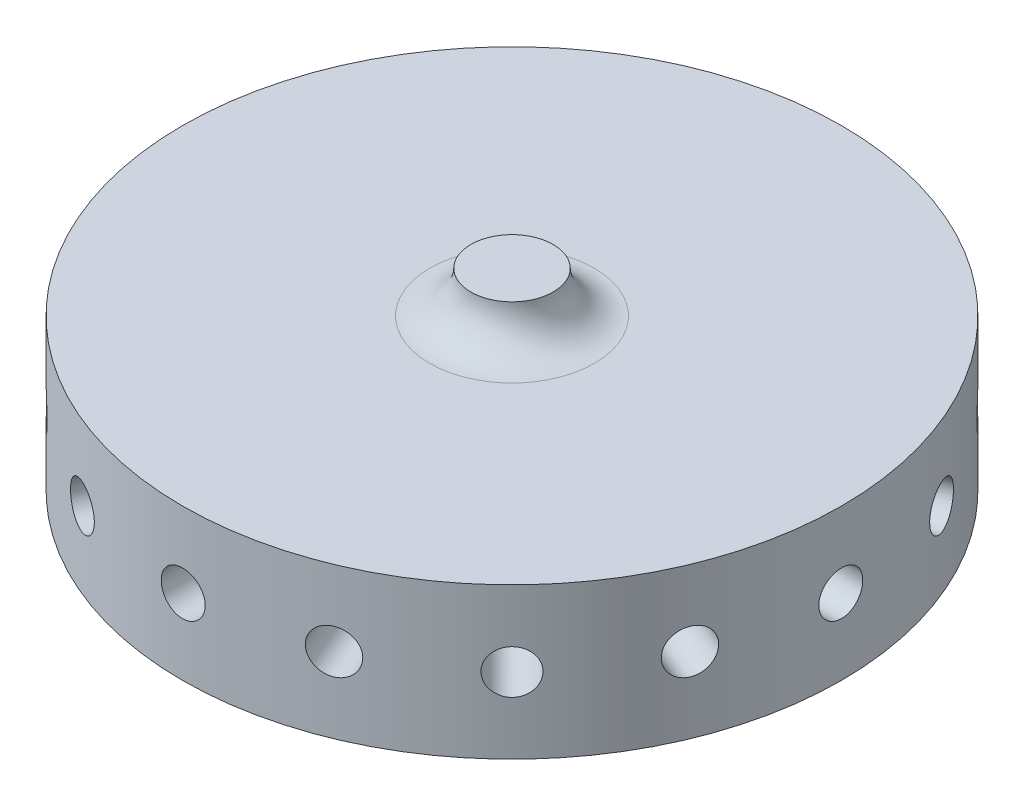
ISO-10303-21;
HEADER;
FILE_DESCRIPTION(('STEP AP214'),'2;1');
FILE_NAME('part.step','',(''),(''),'','','');
FILE_SCHEMA(('AUTOMOTIVE_DESIGN { 1 0 10303 214 1 1 1 1 }'));
ENDSEC;
DATA;
#1=APPLICATION_CONTEXT('core data for automotive mechanical design processes');
#2=APPLICATION_PROTOCOL_DEFINITION('international standard','automotive_design',2000,#1);
#3=PRODUCT_CONTEXT('',#1,'mechanical');
#4=PRODUCT('Part','Part','',(#3));
#5=PRODUCT_RELATED_PRODUCT_CATEGORY('part','',(#4));
#6=PRODUCT_DEFINITION_FORMATION('','',#4);
#7=PRODUCT_DEFINITION_CONTEXT('part definition',#1,'design');
#8=PRODUCT_DEFINITION('design','',#6,#7);
#9=PRODUCT_DEFINITION_SHAPE('','',#8);
#10=(LENGTH_UNIT() NAMED_UNIT(*) SI_UNIT(.MILLI.,.METRE.));
#11=(NAMED_UNIT(*) PLANE_ANGLE_UNIT() SI_UNIT($,.RADIAN.));
#12=(NAMED_UNIT(*) SI_UNIT($,.STERADIAN.) SOLID_ANGLE_UNIT());
#13=UNCERTAINTY_MEASURE_WITH_UNIT(LENGTH_MEASURE(1.E-05),#10,'distance_accuracy_value','');
#14=(GEOMETRIC_REPRESENTATION_CONTEXT(3) GLOBAL_UNCERTAINTY_ASSIGNED_CONTEXT((#13)) GLOBAL_UNIT_ASSIGNED_CONTEXT((#10,
#11,#12)) REPRESENTATION_CONTEXT('',''));
#15=CARTESIAN_POINT('',(0.,0.,0.));
#16=DIRECTION('',(0.,0.,1.));
#17=DIRECTION('',(1.,0.,0.));
#18=AXIS2_PLACEMENT_3D('',#15,#16,#17);
#19=CARTESIAN_POINT('',(0.,2.9999999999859,0.));
#20=DIRECTION('',(0.,-1.,0.));
#21=DIRECTION('',(0.,0.,-1.));
#22=AXIS2_PLACEMENT_3D('',#19,#20,#21);
#23=CONICAL_SURFACE('',#22,0.599999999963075,1.02974425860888);
#24=CARTESIAN_POINT('',(0.,3.36051637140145,0.));
#25=VERTEX_POINT('',#24);
#26=VERTEX_LOOP('',#25);
#27=FACE_BOUND('',#26,.T.);
#28=CARTESIAN_POINT('',(0.,3.,0.));
#29=DIRECTION('',(0.,-1.,0.));
#30=DIRECTION('',(0.,0.,-1.));
#31=AXIS2_PLACEMENT_3D('',#28,#29,#30);
#32=CIRCLE('',#31,0.599999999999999);
#33=CARTESIAN_POINT('',(0.,3.,-0.599999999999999));
#34=VERTEX_POINT('',#33);
#35=EDGE_CURVE('E98',#34,#34,#32,.T.);
#36=ORIENTED_EDGE('',*,*,#35,.T.);
#37=EDGE_LOOP('',(#36));
#38=FACE_BOUND('',#37,.T.);
#39=ADVANCED_FACE('F17',(#27,#38),#23,.F.);
#40=CARTESIAN_POINT('',(0.,0.,0.));
#41=DIRECTION('',(0.,-1.,0.));
#42=DIRECTION('',(0.,0.,-1.));
#43=AXIS2_PLACEMENT_3D('',#40,#41,#42);
#44=CYLINDRICAL_SURFACE('',#43,0.599999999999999);
#45=ORIENTED_EDGE('',*,*,#35,.F.);
#46=EDGE_LOOP('',(#45));
#47=FACE_BOUND('',#46,.T.);
#48=CARTESIAN_POINT('',(0.,1.47499999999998,-0.599999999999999));
#49=CARTESIAN_POINT('',(0.0113334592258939,1.47500241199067,-0.599999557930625));
#50=CARTESIAN_POINT('',(0.0226712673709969,1.47612800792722,-0.599674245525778));
#51=CARTESIAN_POINT('',(0.0449546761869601,1.48034535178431,-0.598418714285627));
#52=CARTESIAN_POINT('',(0.0558985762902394,1.48344474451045,-0.597486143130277));
#53=CARTESIAN_POINT('',(0.0839489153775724,1.49340492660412,-0.594356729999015));
#54=CARTESIAN_POINT('',(0.10058371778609,1.50140504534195,-0.591733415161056));
#55=CARTESIAN_POINT('',(0.132649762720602,1.51918722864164,-0.585382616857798));
#56=CARTESIAN_POINT('',(0.148075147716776,1.52897728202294,-0.581650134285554));
#57=CARTESIAN_POINT('',(0.180798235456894,1.55128704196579,-0.572408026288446));
#58=CARTESIAN_POINT('',(0.197921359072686,1.56397827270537,-0.566698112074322));
#59=CARTESIAN_POINT('',(0.231281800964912,1.58984061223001,-0.553919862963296));
#60=CARTESIAN_POINT('',(0.247518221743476,1.60301218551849,-0.546850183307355));
#61=CARTESIAN_POINT('',(0.295113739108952,1.64263907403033,-0.523600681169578));
#62=CARTESIAN_POINT('',(0.325394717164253,1.66923336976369,-0.505370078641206));
#63=CARTESIAN_POINT('',(0.3809954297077,1.71910958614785,-0.4646918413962));
#64=CARTESIAN_POINT('',(0.406515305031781,1.74249221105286,-0.442641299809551));
#65=CARTESIAN_POINT('',(0.454403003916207,1.78685182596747,-0.393313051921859));
#66=CARTESIAN_POINT('',(0.476777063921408,1.80783355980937,-0.366045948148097));
#67=CARTESIAN_POINT('',(0.511881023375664,1.84094713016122,-0.314136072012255));
#68=CARTESIAN_POINT('',(0.525594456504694,1.85394977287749,-0.290717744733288));
#69=CARTESIAN_POINT('',(0.550104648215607,1.8772569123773,-0.241138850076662));
#70=CARTESIAN_POINT('',(0.560902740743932,1.8875626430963,-0.214979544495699));
#71=CARTESIAN_POINT('',(0.578979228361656,1.90484286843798,-0.160079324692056));
#72=CARTESIAN_POINT('',(0.586220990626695,1.91178268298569,-0.131315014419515));
#73=CARTESIAN_POINT('',(0.596368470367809,1.9215128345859,-0.0723567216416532));
#74=CARTESIAN_POINT('',(0.599279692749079,1.92430843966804,-0.0421646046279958));
#75=CARTESIAN_POINT('',(0.600391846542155,1.92537622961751,0.0137205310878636));
#76=CARTESIAN_POINT('',(0.59924784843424,1.92427749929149,0.0393919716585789));
#77=CARTESIAN_POINT('',(0.593749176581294,1.91900119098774,0.0900611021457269));
#78=CARTESIAN_POINT('',(0.5893944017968,1.91482351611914,0.115058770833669));
#79=CARTESIAN_POINT('',(0.577961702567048,1.90387261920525,0.16293454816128));
#80=CARTESIAN_POINT('',(0.57097428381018,1.89718568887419,0.185854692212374));
#81=CARTESIAN_POINT('',(0.55465345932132,1.88160089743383,0.230032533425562));
#82=CARTESIAN_POINT('',(0.545319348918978,1.87270237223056,0.251289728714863));
#83=CARTESIAN_POINT('',(0.520023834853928,1.84866015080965,0.301113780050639));
#84=CARTESIAN_POINT('',(0.502973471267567,1.8325112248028,0.328644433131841));
#85=CARTESIAN_POINT('',(0.465743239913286,1.79749463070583,0.379584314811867));
#86=CARTESIAN_POINT('',(0.445554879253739,1.77861959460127,0.402981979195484));
#87=CARTESIAN_POINT('',(0.395151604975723,1.73202827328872,0.453364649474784));
#88=CARTESIAN_POINT('',(0.363932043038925,1.70356321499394,0.478642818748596));
#89=CARTESIAN_POINT('',(0.298124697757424,1.64531538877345,0.522197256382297));
#90=CARTESIAN_POINT('',(0.263539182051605,1.61553351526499,0.540478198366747));
#91=CARTESIAN_POINT('',(0.21156327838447,1.57441224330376,0.561706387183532));
#92=CARTESIAN_POINT('',(0.195806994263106,1.56237566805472,0.567404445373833));
#93=CARTESIAN_POINT('',(0.163345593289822,1.53911271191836,0.577588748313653));
#94=CARTESIAN_POINT('',(0.146642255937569,1.52788489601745,0.582077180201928));
#95=CARTESIAN_POINT('',(0.117549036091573,1.51060684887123,0.588494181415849));
#96=CARTESIAN_POINT('',(0.105535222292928,1.50406428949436,0.59077985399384));
#97=CARTESIAN_POINT('',(0.0807203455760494,1.49240908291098,0.594677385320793));
#98=CARTESIAN_POINT('',(0.067921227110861,1.48729306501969,0.596290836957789));
#99=CARTESIAN_POINT('',(0.0458631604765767,1.48071392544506,0.598310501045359));
#100=CARTESIAN_POINT('',(0.0368239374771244,1.47860281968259,0.598939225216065));
#101=CARTESIAN_POINT('',(0.0185237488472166,1.47574640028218,0.599783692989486));
#102=CARTESIAN_POINT('',(0.00926332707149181,1.47499802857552,0.600000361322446));
#103=CARTESIAN_POINT('',(-0.0113334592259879,1.47500241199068,0.599999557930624));
#104=CARTESIAN_POINT('',(-0.0226712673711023,1.47612800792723,0.599674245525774));
#105=CARTESIAN_POINT('',(-0.0449546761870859,1.48034535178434,0.598418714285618));
#106=CARTESIAN_POINT('',(-0.0558985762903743,1.48344474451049,0.597486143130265));
#107=CARTESIAN_POINT('',(-0.083948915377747,1.49340492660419,0.594356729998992));
#108=CARTESIAN_POINT('',(-0.100583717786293,1.50140504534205,0.591733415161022));
#109=CARTESIAN_POINT('',(-0.132649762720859,1.5191872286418,0.58538261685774));
#110=CARTESIAN_POINT('',(-0.148075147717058,1.52897728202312,0.581650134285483));
#111=CARTESIAN_POINT('',(-0.180798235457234,1.55128704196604,0.572408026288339));
#112=CARTESIAN_POINT('',(-0.197921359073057,1.56397827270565,0.566698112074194));
#113=CARTESIAN_POINT('',(-0.231281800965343,1.58984061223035,0.553919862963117));
#114=CARTESIAN_POINT('',(-0.247518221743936,1.60301218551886,0.546850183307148));
#115=CARTESIAN_POINT('',(-0.295113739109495,1.6426390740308,0.523600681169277));
#116=CARTESIAN_POINT('',(-0.325394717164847,1.66923336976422,0.50537007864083));
#117=CARTESIAN_POINT('',(-0.380995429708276,1.71910958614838,0.464691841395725));
#118=CARTESIAN_POINT('',(-0.4065153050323,1.74249221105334,0.442641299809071));
#119=CARTESIAN_POINT('',(-0.454403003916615,1.78685182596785,0.393313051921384));
#120=CARTESIAN_POINT('',(-0.476777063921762,1.8078335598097,0.366045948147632));
#121=CARTESIAN_POINT('',(-0.511881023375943,1.84094713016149,0.314136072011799));
#122=CARTESIAN_POINT('',(-0.525594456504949,1.85394977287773,0.290717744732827));
#123=CARTESIAN_POINT('',(-0.550104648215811,1.87725691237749,0.241138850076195));
#124=CARTESIAN_POINT('',(-0.560902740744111,1.88756264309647,0.214979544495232));
#125=CARTESIAN_POINT('',(-0.578979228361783,1.9048428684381,0.160079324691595));
#126=CARTESIAN_POINT('',(-0.586220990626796,1.91178268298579,0.131315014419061));
#127=CARTESIAN_POINT('',(-0.596368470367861,1.92151283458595,0.0723567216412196));
#128=CARTESIAN_POINT('',(-0.599279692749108,1.92430843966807,0.042164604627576));
#129=CARTESIAN_POINT('',(-0.600391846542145,1.9253762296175,-0.0137205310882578));
#130=CARTESIAN_POINT('',(-0.599247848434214,1.92427749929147,-0.0393919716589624));
#131=CARTESIAN_POINT('',(-0.593749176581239,1.91900119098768,-0.0900611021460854));
#132=CARTESIAN_POINT('',(-0.589394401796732,1.91482351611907,-0.115058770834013));
#133=CARTESIAN_POINT('',(-0.577961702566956,1.90387261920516,-0.162934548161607));
#134=CARTESIAN_POINT('',(-0.570974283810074,1.89718568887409,-0.185854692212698));
#135=CARTESIAN_POINT('',(-0.554653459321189,1.8816008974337,-0.230032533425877));
#136=CARTESIAN_POINT('',(-0.545319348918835,1.87270237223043,-0.251289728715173));
#137=CARTESIAN_POINT('',(-0.52002383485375,1.84866015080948,-0.301113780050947));
#138=CARTESIAN_POINT('',(-0.502973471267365,1.83251122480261,-0.328644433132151));
#139=CARTESIAN_POINT('',(-0.465743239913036,1.7974946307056,-0.379584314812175));
#140=CARTESIAN_POINT('',(-0.445554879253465,1.77861959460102,-0.402981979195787));
#141=CARTESIAN_POINT('',(-0.395151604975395,1.73202827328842,-0.45336464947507));
#142=CARTESIAN_POINT('',(-0.363932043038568,1.70356321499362,-0.478642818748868));
#143=CARTESIAN_POINT('',(-0.298124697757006,1.64531538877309,-0.522197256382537));
#144=CARTESIAN_POINT('',(-0.263539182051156,1.61553351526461,-0.540478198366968));
#145=CARTESIAN_POINT('',(-0.211563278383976,1.57441224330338,-0.561706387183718));
#146=CARTESIAN_POINT('',(-0.195806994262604,1.56237566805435,-0.567404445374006));
#147=CARTESIAN_POINT('',(-0.1633455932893,1.539112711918,-0.577588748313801));
#148=CARTESIAN_POINT('',(-0.146642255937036,1.52788489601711,-0.582077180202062));
#149=CARTESIAN_POINT('',(-0.117549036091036,1.51060684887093,-0.588494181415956));
#150=CARTESIAN_POINT('',(-0.1055352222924,1.50406428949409,-0.590779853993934));
#151=CARTESIAN_POINT('',(-0.0807203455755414,1.49240908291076,-0.594677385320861));
#152=CARTESIAN_POINT('',(-0.0679212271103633,1.48729306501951,-0.596290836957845));
#153=CARTESIAN_POINT('',(-0.0458631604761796,1.48071392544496,-0.598310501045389));
#154=CARTESIAN_POINT('',(-0.0368239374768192,1.47860281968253,-0.598939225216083));
#155=CARTESIAN_POINT('',(-0.018523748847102,1.47574640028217,-0.599783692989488));
#156=CARTESIAN_POINT('',(-0.00926332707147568,1.47499802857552,-0.600000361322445));
#157=CARTESIAN_POINT('',(0.,1.47499999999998,-0.599999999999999));
#158=B_SPLINE_CURVE_WITH_KNOTS('',3,(#48,#49,#50,#51,#52,#53,#54,#55,#56,#57,#58,#59,#60,#61,
#62,#63,#64,#65,#66,#67,#68,#69,#70,#71,#72,#73,#74,#75,#76,#77,#78,#79,#80,#81,#82,#83,#84,#85,
#86,#87,#88,#89,#90,#91,#92,#93,#94,#95,#96,#97,#98,#99,#100,#101,#102,#103,#104,#105,#106,#107,
#108,#109,#110,#111,#112,#113,#114,#115,#116,#117,#118,#119,#120,#121,#122,#123,#124,#125,#126,
#127,#128,#129,#130,#131,#132,#133,#134,#135,#136,#137,#138,#139,#140,#141,#142,#143,#144,#145,
#146,#147,#148,#149,#150,#151,#152,#153,#154,#155,#156,#157),.UNSPECIFIED.,.T.,.F.,(4,2,2,2,2,2,
2,2,2,2,2,2,2,2,2,2,2,2,2,2,2,2,2,2,2,2,2,2,2,2,2,2,2,2,2,2,2,2,2,2,2,2,2,2,2,2,2,2,2,2,2,2,2,2,
4),(0.,0.0339589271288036,0.0680501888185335,0.123665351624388,0.179535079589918,
0.245638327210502,0.311807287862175,0.444009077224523,0.566712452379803,0.689169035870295,
0.779122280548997,0.869034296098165,0.959853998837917,1.05055815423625,1.12732411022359,
1.20409248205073,1.27843226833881,1.35279440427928,1.46075097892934,1.56900499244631,
1.71595111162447,1.86279890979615,1.92465011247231,1.98638871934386,2.02793415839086,
2.06938058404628,2.09719919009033,2.12495529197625,2.15891421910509,2.19300548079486,
2.24862064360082,2.30449037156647,2.3705936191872,2.43676257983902,2.56896436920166,
2.69166774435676,2.81412432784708,2.90407757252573,2.99398958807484,3.08480929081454,
3.17551344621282,3.25227940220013,3.32904777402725,3.40338756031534,3.47774969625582,
3.58570627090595,3.69396028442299,3.84090640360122,3.98775420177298,4.04960540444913,
4.11134401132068,4.1528894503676,4.19433587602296,4.22215448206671,4.24991058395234),.UNSPECIFIED.);
#159=CARTESIAN_POINT('',(0.,1.47499999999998,-0.599999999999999));
#160=VERTEX_POINT('',#159);
#161=EDGE_CURVE('E100',#160,#160,#158,.T.);
#162=ORIENTED_EDGE('',*,*,#161,.T.);
#163=EDGE_LOOP('',(#162));
#164=FACE_BOUND('',#163,.T.);
#165=ADVANCED_FACE('F95',(#47,#164),#44,.F.);
#166=CARTESIAN_POINT('',(0.,0.,0.));
#167=DIRECTION('',(0.,-1.,0.));
#168=DIRECTION('',(0.,0.,-1.));
#169=AXIS2_PLACEMENT_3D('',#166,#167,#168);
#170=CYLINDRICAL_SURFACE('',#169,0.599999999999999);
#171=CARTESIAN_POINT('',(0.,0.,0.));
#172=DIRECTION('',(0.,-1.,0.));
#173=DIRECTION('',(0.,0.,-1.));
#174=AXIS2_PLACEMENT_3D('',#171,#172,#173);
#175=CIRCLE('',#174,0.599999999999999);
#176=CARTESIAN_POINT('',(0.,0.,-0.599999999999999));
#177=VERTEX_POINT('',#176);
#178=EDGE_CURVE('E437',#177,#177,#175,.F.);
#179=ORIENTED_EDGE('',*,*,#178,.F.);
#180=EDGE_LOOP('',(#179));
#181=FACE_BOUND('',#180,.T.);
#182=CARTESIAN_POINT('',(0.,1.12500000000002,-0.599999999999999));
#183=CARTESIAN_POINT('',(-0.011333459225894,1.12499758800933,-0.599999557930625));
#184=CARTESIAN_POINT('',(-0.022671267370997,1.12387199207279,-0.599674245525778));
#185=CARTESIAN_POINT('',(-0.0449546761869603,1.11965464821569,-0.598418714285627));
#186=CARTESIAN_POINT('',(-0.0558985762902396,1.11655525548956,-0.597486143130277));
#187=CARTESIAN_POINT('',(-0.0839489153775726,1.10659507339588,-0.594356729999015));
#188=CARTESIAN_POINT('',(-0.10058371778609,1.09859495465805,-0.591733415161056));
#189=CARTESIAN_POINT('',(-0.132649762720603,1.08081277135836,-0.585382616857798));
#190=CARTESIAN_POINT('',(-0.148075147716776,1.07102271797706,-0.581650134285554));
#191=CARTESIAN_POINT('',(-0.180798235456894,1.04871295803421,-0.572408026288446));
#192=CARTESIAN_POINT('',(-0.197921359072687,1.03602172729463,-0.566698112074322));
#193=CARTESIAN_POINT('',(-0.231281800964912,1.01015938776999,-0.553919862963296));
#194=CARTESIAN_POINT('',(-0.247518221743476,0.996987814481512,-0.546850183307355));
#195=CARTESIAN_POINT('',(-0.295113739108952,0.957360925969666,-0.523600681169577));
#196=CARTESIAN_POINT('',(-0.325394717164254,0.930766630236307,-0.505370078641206));
#197=CARTESIAN_POINT('',(-0.3809954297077,0.880890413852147,-0.4646918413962));
#198=CARTESIAN_POINT('',(-0.406515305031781,0.857507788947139,-0.442641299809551));
#199=CARTESIAN_POINT('',(-0.454403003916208,0.813148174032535,-0.393313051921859));
#200=CARTESIAN_POINT('',(-0.476777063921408,0.79216644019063,-0.366045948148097));
#201=CARTESIAN_POINT('',(-0.511881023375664,0.759052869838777,-0.314136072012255));
#202=CARTESIAN_POINT('',(-0.525594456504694,0.746050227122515,-0.290717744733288));
#203=CARTESIAN_POINT('',(-0.550104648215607,0.722743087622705,-0.241138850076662));
#204=CARTESIAN_POINT('',(-0.560902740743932,0.712437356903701,-0.214979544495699));
#205=CARTESIAN_POINT('',(-0.578979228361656,0.695157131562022,-0.160079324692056));
#206=CARTESIAN_POINT('',(-0.586220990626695,0.688217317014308,-0.131315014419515));
#207=CARTESIAN_POINT('',(-0.596368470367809,0.678487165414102,-0.0723567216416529));
#208=CARTESIAN_POINT('',(-0.599279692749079,0.675691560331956,-0.0421646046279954));
#209=CARTESIAN_POINT('',(-0.600391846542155,0.674623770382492,0.0137205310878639));
#210=CARTESIAN_POINT('',(-0.59924784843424,0.675722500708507,0.0393919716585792));
#211=CARTESIAN_POINT('',(-0.593749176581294,0.680998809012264,0.0900611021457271));
#212=CARTESIAN_POINT('',(-0.5893944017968,0.685176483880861,0.115058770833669));
#213=CARTESIAN_POINT('',(-0.577961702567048,0.69612738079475,0.16293454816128));
#214=CARTESIAN_POINT('',(-0.57097428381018,0.702814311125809,0.185854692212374));
#215=CARTESIAN_POINT('',(-0.55465345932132,0.718399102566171,0.230032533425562));
#216=CARTESIAN_POINT('',(-0.545319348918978,0.727297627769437,0.251289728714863));
#217=CARTESIAN_POINT('',(-0.520023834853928,0.751339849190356,0.301113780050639));
#218=CARTESIAN_POINT('',(-0.502973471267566,0.767488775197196,0.328644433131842));
#219=CARTESIAN_POINT('',(-0.465743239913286,0.802505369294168,0.379584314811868));
#220=CARTESIAN_POINT('',(-0.445554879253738,0.821380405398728,0.402981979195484));
#221=CARTESIAN_POINT('',(-0.395151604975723,0.86797172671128,0.453364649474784));
#222=CARTESIAN_POINT('',(-0.363932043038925,0.896436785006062,0.478642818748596));
#223=CARTESIAN_POINT('',(-0.298124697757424,0.954684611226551,0.522197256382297));
#224=CARTESIAN_POINT('',(-0.263539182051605,0.984466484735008,0.540478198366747));
#225=CARTESIAN_POINT('',(-0.21156327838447,1.02558775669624,0.561706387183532));
#226=CARTESIAN_POINT('',(-0.195806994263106,1.03762433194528,0.567404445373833));
#227=CARTESIAN_POINT('',(-0.163345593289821,1.06088728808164,0.577588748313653));
#228=CARTESIAN_POINT('',(-0.146642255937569,1.07211510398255,0.582077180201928));
#229=CARTESIAN_POINT('',(-0.117549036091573,1.08939315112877,0.588494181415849));
#230=CARTESIAN_POINT('',(-0.105535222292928,1.09593571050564,0.59077985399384));
#231=CARTESIAN_POINT('',(-0.0807203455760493,1.10759091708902,0.594677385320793));
#232=CARTESIAN_POINT('',(-0.067921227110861,1.11270693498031,0.596290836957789));
#233=CARTESIAN_POINT('',(-0.0458631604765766,1.11928607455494,0.59831050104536));
#234=CARTESIAN_POINT('',(-0.0368239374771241,1.12139718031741,0.598939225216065));
#235=CARTESIAN_POINT('',(-0.0185237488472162,1.12425359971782,0.599783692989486));
#236=CARTESIAN_POINT('',(-0.00926332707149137,1.12500197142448,0.600000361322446));
#237=CARTESIAN_POINT('',(0.0113334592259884,1.12499758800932,0.599999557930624));
#238=CARTESIAN_POINT('',(0.0226712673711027,1.12387199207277,0.599674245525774));
#239=CARTESIAN_POINT('',(0.0449546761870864,1.11965464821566,0.598418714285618));
#240=CARTESIAN_POINT('',(0.0558985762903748,1.11655525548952,0.597486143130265));
#241=CARTESIAN_POINT('',(0.0839489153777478,1.10659507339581,0.594356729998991));
#242=CARTESIAN_POINT('',(0.100583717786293,1.09859495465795,0.591733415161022));
#243=CARTESIAN_POINT('',(0.132649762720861,1.0808127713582,0.58538261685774));
#244=CARTESIAN_POINT('',(0.14807514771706,1.07102271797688,0.581650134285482));
#245=CARTESIAN_POINT('',(0.180798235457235,1.04871295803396,0.572408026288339));
#246=CARTESIAN_POINT('',(0.197921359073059,1.03602172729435,0.566698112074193));
#247=CARTESIAN_POINT('',(0.231281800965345,1.01015938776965,0.553919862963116));
#248=CARTESIAN_POINT('',(0.247518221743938,0.996987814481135,0.546850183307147));
#249=CARTESIAN_POINT('',(0.295113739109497,0.957360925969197,0.523600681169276));
#250=CARTESIAN_POINT('',(0.325394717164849,0.930766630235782,0.505370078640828));
#251=CARTESIAN_POINT('',(0.380995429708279,0.880890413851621,0.464691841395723));
#252=CARTESIAN_POINT('',(0.406515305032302,0.85750778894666,0.442641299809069));
#253=CARTESIAN_POINT('',(0.454403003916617,0.813148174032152,0.393313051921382));
#254=CARTESIAN_POINT('',(0.476777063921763,0.792166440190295,0.36604594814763));
#255=CARTESIAN_POINT('',(0.511881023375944,0.759052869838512,0.314136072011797));
#256=CARTESIAN_POINT('',(0.52559445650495,0.746050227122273,0.290717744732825));
#257=CARTESIAN_POINT('',(0.550104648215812,0.72274308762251,0.241138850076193));
#258=CARTESIAN_POINT('',(0.560902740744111,0.71243735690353,0.21497954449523));
#259=CARTESIAN_POINT('',(0.578979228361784,0.6951571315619,0.160079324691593));
#260=CARTESIAN_POINT('',(0.586220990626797,0.688217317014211,0.131315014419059));
#261=CARTESIAN_POINT('',(0.596368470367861,0.678487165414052,0.0723567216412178));
#262=CARTESIAN_POINT('',(0.599279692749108,0.675691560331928,0.0421646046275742));
#263=CARTESIAN_POINT('',(0.600391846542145,0.674623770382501,-0.0137205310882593));
#264=CARTESIAN_POINT('',(0.599247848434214,0.675722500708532,-0.0393919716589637));
#265=CARTESIAN_POINT('',(0.593749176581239,0.680998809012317,-0.0900611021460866));
#266=CARTESIAN_POINT('',(0.589394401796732,0.685176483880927,-0.115058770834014));
#267=CARTESIAN_POINT('',(0.577961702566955,0.696127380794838,-0.162934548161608));
#268=CARTESIAN_POINT('',(0.570974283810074,0.70281431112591,-0.1858546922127));
#269=CARTESIAN_POINT('',(0.554653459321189,0.718399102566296,-0.230032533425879));
#270=CARTESIAN_POINT('',(0.545319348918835,0.727297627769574,-0.251289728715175));
#271=CARTESIAN_POINT('',(0.520023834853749,0.751339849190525,-0.301113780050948));
#272=CARTESIAN_POINT('',(0.502973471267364,0.767488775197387,-0.328644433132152));
#273=CARTESIAN_POINT('',(0.465743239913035,0.802505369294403,-0.379584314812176));
#274=CARTESIAN_POINT('',(0.445554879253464,0.821380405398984,-0.402981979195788));
#275=CARTESIAN_POINT('',(0.395151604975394,0.867971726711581,-0.453364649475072));
#276=CARTESIAN_POINT('',(0.363932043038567,0.896436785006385,-0.478642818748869));
#277=CARTESIAN_POINT('',(0.298124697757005,0.954684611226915,-0.522197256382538));
#278=CARTESIAN_POINT('',(0.263539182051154,0.984466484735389,-0.540478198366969));
#279=CARTESIAN_POINT('',(0.211563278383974,1.02558775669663,-0.561706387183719));
#280=CARTESIAN_POINT('',(0.195806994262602,1.03762433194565,-0.567404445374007));
#281=CARTESIAN_POINT('',(0.163345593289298,1.060887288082,-0.577588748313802));
#282=CARTESIAN_POINT('',(0.146642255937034,1.07211510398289,-0.582077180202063));
#283=CARTESIAN_POINT('',(0.117549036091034,1.08939315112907,-0.588494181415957));
#284=CARTESIAN_POINT('',(0.105535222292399,1.09593571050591,-0.590779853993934));
#285=CARTESIAN_POINT('',(0.0807203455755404,1.10759091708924,-0.594677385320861));
#286=CARTESIAN_POINT('',(0.0679212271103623,1.11270693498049,-0.596290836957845));
#287=CARTESIAN_POINT('',(0.0458631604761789,1.11928607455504,-0.598310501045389));
#288=CARTESIAN_POINT('',(0.0368239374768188,1.12139718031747,-0.598939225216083));
#289=CARTESIAN_POINT('',(0.0185237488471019,1.12425359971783,-0.599783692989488));
#290=CARTESIAN_POINT('',(0.00926332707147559,1.12500197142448,-0.600000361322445));
#291=CARTESIAN_POINT('',(0.,1.12500000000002,-0.599999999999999));
#292=B_SPLINE_CURVE_WITH_KNOTS('',3,(#182,#183,#184,#185,#186,#187,#188,#189,#190,#191,#192,
#193,#194,#195,#196,#197,#198,#199,#200,#201,#202,#203,#204,#205,#206,#207,#208,#209,#210,#211,
#212,#213,#214,#215,#216,#217,#218,#219,#220,#221,#222,#223,#224,#225,#226,#227,#228,#229,#230,
#231,#232,#233,#234,#235,#236,#237,#238,#239,#240,#241,#242,#243,#244,#245,#246,#247,#248,#249,
#250,#251,#252,#253,#254,#255,#256,#257,#258,#259,#260,#261,#262,#263,#264,#265,#266,#267,#268,
#269,#270,#271,#272,#273,#274,#275,#276,#277,#278,#279,#280,#281,#282,#283,#284,#285,#286,#287,
#288,#289,#290,#291),.UNSPECIFIED.,.T.,.F.,(4,2,2,2,2,2,2,2,2,2,2,2,2,2,2,2,2,2,2,2,2,2,2,2,2,2,
2,2,2,2,2,2,2,2,2,2,2,2,2,2,2,2,2,2,2,2,2,2,2,2,2,2,2,2,4),(0.,0.0339589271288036,
0.0680501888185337,0.123665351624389,0.179535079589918,0.245638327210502,0.311807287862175,
0.444009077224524,0.566712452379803,0.689169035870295,0.779122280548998,0.869034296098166,
0.959853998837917,1.05055815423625,1.12732411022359,1.20409248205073,1.27843226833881,
1.35279440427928,1.46075097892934,1.56900499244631,1.71595111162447,1.86279890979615,
1.92465011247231,1.98638871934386,2.02793415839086,2.06938058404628,2.09719919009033,
2.12495529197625,2.15891421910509,2.19300548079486,2.24862064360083,2.30449037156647,
2.3705936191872,2.43676257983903,2.56896436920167,2.69166774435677,2.81412432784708,
2.90407757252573,2.99398958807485,3.08480929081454,3.17551344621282,3.25227940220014,
3.32904777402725,3.40338756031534,3.47774969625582,3.58570627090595,3.69396028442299,
3.84090640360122,3.98775420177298,4.04960540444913,4.11134401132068,4.1528894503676,
4.19433587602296,4.22215448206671,4.24991058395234),.UNSPECIFIED.);
#293=CARTESIAN_POINT('',(0.,1.12500000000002,-0.599999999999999));
#294=VERTEX_POINT('',#293);
#295=EDGE_CURVE('E103',#294,#294,#292,.T.);
#296=ORIENTED_EDGE('',*,*,#295,.T.);
#297=EDGE_LOOP('',(#296));
#298=FACE_BOUND('',#297,.T.);
#299=ADVANCED_FACE('F375',(#181,#298),#170,.F.);
#300=CARTESIAN_POINT('',(-2.5,1.3,0.));
#301=DIRECTION('',(-1.,0.,0.));
#302=DIRECTION('',(0.,0.,1.));
#303=AXIS2_PLACEMENT_3D('',#300,#301,#302);
#304=CYLINDRICAL_SURFACE('',#303,0.624999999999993);
#305=CARTESIAN_POINT('',(-2.5,1.92499999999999,0.));
#306=CARTESIAN_POINT('',(-2.49999911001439,1.92499850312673,0.0345195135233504));
#307=CARTESIAN_POINT('',(-2.49927762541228,1.92212955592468,0.069058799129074));
#308=CARTESIAN_POINT('',(-2.49646806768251,1.91074311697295,0.137157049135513));
#309=CARTESIAN_POINT('',(-2.49437866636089,1.90222013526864,0.170715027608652));
#310=CARTESIAN_POINT('',(-2.48906494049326,1.8798163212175,0.235843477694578));
#311=CARTESIAN_POINT('',(-2.48584214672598,1.86594271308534,0.267416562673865));
#312=CARTESIAN_POINT('',(-2.47860515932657,1.83325565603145,0.327783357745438));
#313=CARTESIAN_POINT('',(-2.47459102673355,1.81444258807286,0.356577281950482));
#314=CARTESIAN_POINT('',(-2.46611466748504,1.77200197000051,0.411164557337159));
#315=CARTESIAN_POINT('',(-2.46164554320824,1.74829204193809,0.43689279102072));
#316=CARTESIAN_POINT('',(-2.45280766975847,1.69690046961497,0.484057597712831));
#317=CARTESIAN_POINT('',(-2.44843895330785,1.66921755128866,0.505492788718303));
#318=CARTESIAN_POINT('',(-2.4402261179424,1.61015447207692,0.543770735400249));
#319=CARTESIAN_POINT('',(-2.43639102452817,1.57872432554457,0.560538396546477));
#320=CARTESIAN_POINT('',(-2.42978679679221,1.51340023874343,0.58851052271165));
#321=CARTESIAN_POINT('',(-2.42701641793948,1.47950923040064,0.599721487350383));
#322=CARTESIAN_POINT('',(-2.42353130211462,1.42120590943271,0.613619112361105));
#323=CARTESIAN_POINT('',(-2.42244370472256,1.39717929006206,0.617879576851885));
#324=CARTESIAN_POINT('',(-2.4209850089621,1.34877173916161,0.623570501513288));
#325=CARTESIAN_POINT('',(-2.42061388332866,1.32439082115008,0.625001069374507));
#326=CARTESIAN_POINT('',(-2.42061559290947,1.26549946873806,0.624998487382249));
#327=CARTESIAN_POINT('',(-2.42136055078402,1.23097912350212,0.622132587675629));
#328=CARTESIAN_POINT('',(-2.42425370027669,1.1629202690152,0.61075935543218));
#329=CARTESIAN_POINT('',(-2.42640327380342,1.12938276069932,0.60224646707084));
#330=CARTESIAN_POINT('',(-2.43184698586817,1.06429767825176,0.57987214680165));
#331=CARTESIAN_POINT('',(-2.43513947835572,1.0327473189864,0.566018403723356));
#332=CARTESIAN_POINT('',(-2.44249592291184,0.972419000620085,0.533378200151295));
#333=CARTESIAN_POINT('',(-2.4465598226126,0.943640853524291,0.51459207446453));
#334=CARTESIAN_POINT('',(-2.45510134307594,0.889037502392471,0.472179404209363));
#335=CARTESIAN_POINT('',(-2.45958556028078,0.86328201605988,0.448464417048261));
#336=CARTESIAN_POINT('',(-2.46840627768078,0.816064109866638,0.397051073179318));
#337=CARTESIAN_POINT('',(-2.47274273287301,0.794602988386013,0.369351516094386));
#338=CARTESIAN_POINT('',(-2.48085311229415,0.756296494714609,0.310272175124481));
#339=CARTESIAN_POINT('',(-2.48461806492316,0.73952182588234,0.278845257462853));
#340=CARTESIAN_POINT('',(-2.49107972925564,0.711535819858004,0.213528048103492));
#341=CARTESIAN_POINT('',(-2.49377767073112,0.70031807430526,0.179640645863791));
#342=CARTESIAN_POINT('',(-2.49716808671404,0.686402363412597,0.121319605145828));
#343=CARTESIAN_POINT('',(-2.49822456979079,0.682133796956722,0.097270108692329));
#344=CARTESIAN_POINT('',(-2.49964082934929,0.676432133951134,0.0488170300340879));
#345=CARTESIAN_POINT('',(-2.50000062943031,0.674998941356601,0.0244134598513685));
#346=CARTESIAN_POINT('',(-2.49999911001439,0.675001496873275,-0.0345195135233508));
#347=CARTESIAN_POINT('',(-2.49927762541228,0.67787044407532,-0.0690587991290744));
#348=CARTESIAN_POINT('',(-2.49646806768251,0.68925688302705,-0.137157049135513));
#349=CARTESIAN_POINT('',(-2.49437866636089,0.697779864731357,-0.170715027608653));
#350=CARTESIAN_POINT('',(-2.48906494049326,0.720183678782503,-0.235843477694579));
#351=CARTESIAN_POINT('',(-2.48584214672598,0.73405728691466,-0.267416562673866));
#352=CARTESIAN_POINT('',(-2.47860515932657,0.766744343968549,-0.327783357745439));
#353=CARTESIAN_POINT('',(-2.47459102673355,0.78555741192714,-0.356577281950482));
#354=CARTESIAN_POINT('',(-2.46611466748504,0.827998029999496,-0.411164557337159));
#355=CARTESIAN_POINT('',(-2.46164554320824,0.851707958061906,-0.43689279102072));
#356=CARTESIAN_POINT('',(-2.45280766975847,0.903099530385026,-0.484057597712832));
#357=CARTESIAN_POINT('',(-2.44843895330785,0.930782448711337,-0.505492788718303));
#358=CARTESIAN_POINT('',(-2.4402261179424,0.98984552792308,-0.54377073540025));
#359=CARTESIAN_POINT('',(-2.43639102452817,1.02127567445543,-0.560538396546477));
#360=CARTESIAN_POINT('',(-2.42978679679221,1.08659976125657,-0.58851052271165));
#361=CARTESIAN_POINT('',(-2.42701641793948,1.12049076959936,-0.599721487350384));
#362=CARTESIAN_POINT('',(-2.42353130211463,1.1787940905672,-0.613619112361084));
#363=CARTESIAN_POINT('',(-2.42244370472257,1.20282070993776,-0.617879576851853));
#364=CARTESIAN_POINT('',(-2.4209850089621,1.25122826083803,-0.623570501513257));
#365=CARTESIAN_POINT('',(-2.42061388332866,1.27560917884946,-0.625001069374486));
#366=CARTESIAN_POINT('',(-2.42061559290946,1.33450053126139,-0.624998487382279));
#367=CARTESIAN_POINT('',(-2.42136055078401,1.36902087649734,-0.622132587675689));
#368=CARTESIAN_POINT('',(-2.42425370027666,1.43707973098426,-0.610759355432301));
#369=CARTESIAN_POINT('',(-2.42640327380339,1.47061723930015,-0.602246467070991));
#370=CARTESIAN_POINT('',(-2.43184698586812,1.53570232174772,-0.57987214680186));
#371=CARTESIAN_POINT('',(-2.43513947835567,1.56725268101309,-0.566018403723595));
#372=CARTESIAN_POINT('',(-2.44249592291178,1.62758099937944,-0.53337820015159));
#373=CARTESIAN_POINT('',(-2.44655982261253,1.65635914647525,-0.514592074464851));
#374=CARTESIAN_POINT('',(-2.45510134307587,1.7109624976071,-0.472179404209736));
#375=CARTESIAN_POINT('',(-2.45958556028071,1.73671798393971,-0.44846441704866));
#376=CARTESIAN_POINT('',(-2.46840627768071,1.783935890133,-0.397051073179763));
#377=CARTESIAN_POINT('',(-2.47274273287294,1.80539701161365,-0.369351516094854));
#378=CARTESIAN_POINT('',(-2.48085311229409,1.8437035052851,-0.310272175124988));
#379=CARTESIAN_POINT('',(-2.4846180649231,1.8604781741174,-0.278845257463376));
#380=CARTESIAN_POINT('',(-2.49107972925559,1.8884641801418,-0.213528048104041));
#381=CARTESIAN_POINT('',(-2.49377767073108,1.89968192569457,-0.17964064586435));
#382=CARTESIAN_POINT('',(-2.49716808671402,1.91359763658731,-0.121319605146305));
#383=CARTESIAN_POINT('',(-2.49822456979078,1.91786620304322,-0.0972701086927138));
#384=CARTESIAN_POINT('',(-2.49964082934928,1.92356786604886,-0.0488170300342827));
#385=CARTESIAN_POINT('',(-2.50000062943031,1.9250010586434,-0.0244134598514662));
#386=CARTESIAN_POINT('',(-2.5,1.92499999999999,0.));
#387=B_SPLINE_CURVE_WITH_KNOTS('',3,(#305,#306,#307,#308,#309,#310,#311,#312,#313,#314,#315,
#316,#317,#318,#319,#320,#321,#322,#323,#324,#325,#326,#327,#328,#329,#330,#331,#332,#333,#334,
#335,#336,#337,#338,#339,#340,#341,#342,#343,#344,#345,#346,#347,#348,#349,#350,#351,#352,#353,
#354,#355,#356,#357,#358,#359,#360,#361,#362,#363,#364,#365,#366,#367,#368,#369,#370,#371,#372,
#373,#374,#375,#376,#377,#378,#379,#380,#381,#382,#383,#384,#385,#386),.UNSPECIFIED.,.T.,.F.,(4,
2,2,2,2,2,2,2,2,2,2,2,2,2,2,2,2,2,2,2,2,2,2,2,2,2,2,2,2,2,2,2,2,2,2,2,2,2,2,2,4),(0.,
0.103468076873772,0.207036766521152,0.310466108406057,0.413887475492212,0.519215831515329,
0.624578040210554,0.731548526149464,0.838393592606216,0.91150480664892,0.984613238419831,
1.08802426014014,1.19153717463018,1.29490162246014,1.39825905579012,1.50366213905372,
1.60909704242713,1.71604590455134,1.82287114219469,1.89605002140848,1.96922642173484,
2.07269449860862,2.176263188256,2.2796925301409,2.38311389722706,2.48844225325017,
2.5938044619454,2.70077494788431,2.80762001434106,2.88073122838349,2.95383966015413,
3.05725068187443,3.16076359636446,3.26412804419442,3.36748547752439,3.47288856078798,
3.57832346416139,3.6852723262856,3.79209756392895,3.86527644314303,3.93845284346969),.UNSPECIFIED.);
#388=CARTESIAN_POINT('',(-2.5,1.92499999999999,0.));
#389=VERTEX_POINT('',#388);
#390=EDGE_CURVE('E343',#389,#389,#387,.T.);
#391=ORIENTED_EDGE('',*,*,#390,.F.);
#392=EDGE_LOOP('',(#391));
#393=FACE_BOUND('',#392,.T.);
#394=CARTESIAN_POINT('',(2.42061459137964,1.3,0.624999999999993));
#395=CARTESIAN_POINT('',(2.42061559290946,1.33450053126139,0.624998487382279));
#396=CARTESIAN_POINT('',(2.42136055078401,1.36902087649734,0.622132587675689));
#397=CARTESIAN_POINT('',(2.42425370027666,1.43707973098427,0.610759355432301));
#398=CARTESIAN_POINT('',(2.42640327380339,1.47061723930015,0.602246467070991));
#399=CARTESIAN_POINT('',(2.43184698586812,1.53570232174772,0.57987214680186));
#400=CARTESIAN_POINT('',(2.43513947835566,1.56725268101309,0.566018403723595));
#401=CARTESIAN_POINT('',(2.44249592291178,1.62758099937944,0.53337820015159));
#402=CARTESIAN_POINT('',(2.44655982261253,1.65635914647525,0.514592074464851));
#403=CARTESIAN_POINT('',(2.45510134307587,1.7109624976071,0.472179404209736));
#404=CARTESIAN_POINT('',(2.45958556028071,1.73671798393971,0.44846441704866));
#405=CARTESIAN_POINT('',(2.46840627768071,1.783935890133,0.397051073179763));
#406=CARTESIAN_POINT('',(2.47274273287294,1.80539701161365,0.369351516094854));
#407=CARTESIAN_POINT('',(2.48085311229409,1.8437035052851,0.310272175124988));
#408=CARTESIAN_POINT('',(2.4846180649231,1.8604781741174,0.278845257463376));
#409=CARTESIAN_POINT('',(2.49107972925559,1.8884641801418,0.213528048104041));
#410=CARTESIAN_POINT('',(2.49377767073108,1.89968192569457,0.17964064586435));
#411=CARTESIAN_POINT('',(2.49716808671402,1.91359763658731,0.121319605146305));
#412=CARTESIAN_POINT('',(2.49822456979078,1.91786620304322,0.0972701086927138));
#413=CARTESIAN_POINT('',(2.49964082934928,1.92356786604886,0.0488170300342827));
#414=CARTESIAN_POINT('',(2.50000062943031,1.9250010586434,0.0244134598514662));
#415=CARTESIAN_POINT('',(2.49999911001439,1.92499850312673,-0.0345195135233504));
#416=CARTESIAN_POINT('',(2.49927762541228,1.92212955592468,-0.069058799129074));
#417=CARTESIAN_POINT('',(2.49646806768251,1.91074311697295,-0.137157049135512));
#418=CARTESIAN_POINT('',(2.49437866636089,1.90222013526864,-0.170715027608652));
#419=CARTESIAN_POINT('',(2.48906494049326,1.8798163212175,-0.235843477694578));
#420=CARTESIAN_POINT('',(2.48584214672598,1.86594271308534,-0.267416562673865));
#421=CARTESIAN_POINT('',(2.47860515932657,1.83325565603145,-0.327783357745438));
#422=CARTESIAN_POINT('',(2.47459102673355,1.81444258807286,-0.356577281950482));
#423=CARTESIAN_POINT('',(2.46611466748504,1.77200197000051,-0.411164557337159));
#424=CARTESIAN_POINT('',(2.46164554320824,1.7482920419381,-0.436892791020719));
#425=CARTESIAN_POINT('',(2.45280766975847,1.69690046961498,-0.484057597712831));
#426=CARTESIAN_POINT('',(2.44843895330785,1.66921755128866,-0.505492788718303));
#427=CARTESIAN_POINT('',(2.4402261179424,1.61015447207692,-0.543770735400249));
#428=CARTESIAN_POINT('',(2.43639102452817,1.57872432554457,-0.560538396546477));
#429=CARTESIAN_POINT('',(2.42978679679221,1.51340023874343,-0.58851052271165));
#430=CARTESIAN_POINT('',(2.42701641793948,1.47950923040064,-0.599721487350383));
#431=CARTESIAN_POINT('',(2.42353130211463,1.4212059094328,-0.613619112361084));
#432=CARTESIAN_POINT('',(2.42244370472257,1.39717929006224,-0.617879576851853));
#433=CARTESIAN_POINT('',(2.4209850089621,1.34877173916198,-0.623570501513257));
#434=CARTESIAN_POINT('',(2.42061388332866,1.32439082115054,-0.625001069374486));
#435=CARTESIAN_POINT('',(2.42061559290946,1.26549946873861,-0.624998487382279));
#436=CARTESIAN_POINT('',(2.42136055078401,1.23097912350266,-0.622132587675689));
#437=CARTESIAN_POINT('',(2.42425370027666,1.16292026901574,-0.610759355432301));
#438=CARTESIAN_POINT('',(2.42640327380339,1.12938276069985,-0.602246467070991));
#439=CARTESIAN_POINT('',(2.43184698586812,1.06429767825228,-0.57987214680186));
#440=CARTESIAN_POINT('',(2.43513947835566,1.03274731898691,-0.566018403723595));
#441=CARTESIAN_POINT('',(2.44249592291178,0.972419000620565,-0.53337820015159));
#442=CARTESIAN_POINT('',(2.44655982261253,0.943640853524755,-0.514592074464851));
#443=CARTESIAN_POINT('',(2.45510134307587,0.8890375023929,-0.472179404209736));
#444=CARTESIAN_POINT('',(2.45958556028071,0.863282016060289,-0.44846441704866));
#445=CARTESIAN_POINT('',(2.46840627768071,0.816064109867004,-0.397051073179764));
#446=CARTESIAN_POINT('',(2.47274273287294,0.794602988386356,-0.369351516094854));
#447=CARTESIAN_POINT('',(2.48085311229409,0.756296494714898,-0.310272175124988));
#448=CARTESIAN_POINT('',(2.4846180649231,0.7395218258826,-0.278845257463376));
#449=CARTESIAN_POINT('',(2.49107972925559,0.711535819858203,-0.21352804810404));
#450=CARTESIAN_POINT('',(2.49377767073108,0.700318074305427,-0.17964064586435));
#451=CARTESIAN_POINT('',(2.49716808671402,0.686402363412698,-0.121319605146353));
#452=CARTESIAN_POINT('',(2.49822456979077,0.682133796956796,-0.0972701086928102));
#453=CARTESIAN_POINT('',(2.49964082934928,0.676432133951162,-0.0488170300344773));
#454=CARTESIAN_POINT('',(2.5000006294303,0.674998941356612,-0.0244134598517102));
#455=CARTESIAN_POINT('',(2.49999911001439,0.675001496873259,0.0345195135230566));
#456=CARTESIAN_POINT('',(2.49927762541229,0.677870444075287,0.0690587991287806));
#457=CARTESIAN_POINT('',(2.49646806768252,0.689256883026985,0.137157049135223));
#458=CARTESIAN_POINT('',(2.49437866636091,0.697779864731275,0.170715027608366));
#459=CARTESIAN_POINT('',(2.48906494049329,0.72018367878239,0.235843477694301));
#460=CARTESIAN_POINT('',(2.48584214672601,0.734057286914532,0.267416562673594));
#461=CARTESIAN_POINT('',(2.4786051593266,0.766744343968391,0.327783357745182));
#462=CARTESIAN_POINT('',(2.47459102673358,0.785557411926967,0.356577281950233));
#463=CARTESIAN_POINT('',(2.46611466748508,0.827998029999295,0.411164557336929));
#464=CARTESIAN_POINT('',(2.46164554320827,0.851707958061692,0.4368927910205));
#465=CARTESIAN_POINT('',(2.45280766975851,0.903099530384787,0.484057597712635));
#466=CARTESIAN_POINT('',(2.44843895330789,0.930782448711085,0.50549278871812));
#467=CARTESIAN_POINT('',(2.44022611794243,0.989845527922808,0.543770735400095));
#468=CARTESIAN_POINT('',(2.43639102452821,1.02127567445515,0.560538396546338));
#469=CARTESIAN_POINT('',(2.42978679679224,1.08659976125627,0.588510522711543));
#470=CARTESIAN_POINT('',(2.4270164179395,1.12049076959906,0.599721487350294));
#471=CARTESIAN_POINT('',(2.42353130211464,1.17879409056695,0.613619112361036));
#472=CARTESIAN_POINT('',(2.42244370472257,1.20282070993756,0.617879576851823));
#473=CARTESIAN_POINT('',(2.4209850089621,1.25122826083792,0.62357050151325));
#474=CARTESIAN_POINT('',(2.42061388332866,1.27560917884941,0.625001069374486));
#475=CARTESIAN_POINT('',(2.42061459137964,1.3,0.624999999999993));
#476=B_SPLINE_CURVE_WITH_KNOTS('',3,(#394,#395,#396,#397,#398,#399,#400,#401,#402,#403,#404,
#405,#406,#407,#408,#409,#410,#411,#412,#413,#414,#415,#416,#417,#418,#419,#420,#421,#422,#423,
#424,#425,#426,#427,#428,#429,#430,#431,#432,#433,#434,#435,#436,#437,#438,#439,#440,#441,#442,
#443,#444,#445,#446,#447,#448,#449,#450,#451,#452,#453,#454,#455,#456,#457,#458,#459,#460,#461,
#462,#463,#464,#465,#466,#467,#468,#469,#470,#471,#472,#473,#474,#475),.UNSPECIFIED.,.T.,.F.,(4,
2,2,2,2,2,2,2,2,2,2,2,2,2,2,2,2,2,2,2,2,2,2,2,2,2,2,2,2,2,2,2,2,2,2,2,2,2,2,2,4),(0.,
0.103411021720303,0.206923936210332,0.310288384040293,0.413645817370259,0.519048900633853,
0.624483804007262,0.731432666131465,0.838257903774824,0.911436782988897,0.984613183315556,
1.08808126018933,1.19164994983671,1.29507929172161,1.39850065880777,1.50382901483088,
1.60919122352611,1.71616170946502,1.82300677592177,1.8961179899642,1.96922642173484,
2.07263744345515,2.17615035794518,2.27951480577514,2.3828722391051,2.4882753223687,
2.59371022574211,2.70065908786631,2.80748432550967,2.88066320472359,2.95383960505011,
3.05730768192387,3.16087637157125,3.26430571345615,3.36772708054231,3.47305543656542,
3.57841764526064,3.68538813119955,3.7922331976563,3.86534441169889,3.93845284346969),.UNSPECIFIED.);
#477=CARTESIAN_POINT('',(2.42061459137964,1.3,0.624999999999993));
#478=VERTEX_POINT('',#477);
#479=EDGE_CURVE('E347',#478,#478,#476,.T.);
#480=ORIENTED_EDGE('',*,*,#479,.F.);
#481=EDGE_LOOP('',(#480));
#482=FACE_BOUND('',#481,.T.);
#483=ORIENTED_EDGE('',*,*,#295,.F.);
#484=EDGE_LOOP('',(#483));
#485=FACE_BOUND('',#484,.T.);
#486=ORIENTED_EDGE('',*,*,#161,.F.);
#487=EDGE_LOOP('',(#486));
#488=FACE_BOUND('',#487,.T.);
#489=ADVANCED_FACE('F357',(#393,#482,#485,#488),#304,.F.);
#490=CARTESIAN_POINT('',(0.,0.,0.));
#491=DIRECTION('',(0.,-1.,0.));
#492=DIRECTION('',(1.,0.,0.));
#493=AXIS2_PLACEMENT_3D('',#490,#491,#492);
#494=PLANE('',#493);
#495=CARTESIAN_POINT('',(0.,0.,0.));
#496=DIRECTION('',(0.,1.,0.));
#497=DIRECTION('',(-1.,0.,0.));
#498=AXIS2_PLACEMENT_3D('',#495,#496,#497);
#499=CIRCLE('',#498,2.5);
#500=CARTESIAN_POINT('',(-2.5,0.,0.));
#501=VERTEX_POINT('',#500);
#502=EDGE_CURVE('E339',#501,#501,#499,.T.);
#503=ORIENTED_EDGE('',*,*,#502,.F.);
#504=EDGE_LOOP('',(#503));
#505=FACE_BOUND('',#504,.T.);
#506=ORIENTED_EDGE('',*,*,#178,.T.);
#507=EDGE_LOOP('',(#506));
#508=FACE_BOUND('',#507,.T.);
#509=ADVANCED_FACE('F366',(#505,#508),#494,.T.);
#510=CARTESIAN_POINT('',(0.,11.,0.));
#511=DIRECTION('',(0.,1.,0.));
#512=DIRECTION('',(-1.,0.,0.));
#513=AXIS2_PLACEMENT_3D('',#510,#511,#512);
#514=CYLINDRICAL_SURFACE('',#513,2.5);
#515=ORIENTED_EDGE('',*,*,#502,.T.);
#516=EDGE_LOOP('',(#515));
#517=FACE_BOUND('',#516,.T.);
#518=ORIENTED_EDGE('',*,*,#390,.T.);
#519=EDGE_LOOP('',(#518));
#520=FACE_BOUND('',#519,.T.);
#521=CARTESIAN_POINT('',(0.,2.,0.));
#522=DIRECTION('',(0.,1.,0.));
#523=DIRECTION('',(-1.,0.,0.));
#524=AXIS2_PLACEMENT_3D('',#521,#522,#523);
#525=CIRCLE('',#524,2.5);
#526=CARTESIAN_POINT('',(-2.5,2.,0.));
#527=VERTEX_POINT('',#526);
#528=EDGE_CURVE('E107',#527,#527,#525,.F.);
#529=ORIENTED_EDGE('',*,*,#528,.T.);
#530=EDGE_LOOP('',(#529));
#531=FACE_BOUND('',#530,.T.);
#532=ORIENTED_EDGE('',*,*,#479,.T.);
#533=EDGE_LOOP('',(#532));
#534=FACE_BOUND('',#533,.T.);
#535=ADVANCED_FACE('F361',(#517,#520,#531,#534),#514,.T.);
#536=CARTESIAN_POINT('',(4.24984584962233,6.75,1.76034378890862));
#537=DIRECTION('',(0.923879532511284,0.,0.382683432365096));
#538=DIRECTION('',(0.382683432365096,0.,-0.923879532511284));
#539=AXIS2_PLACEMENT_3D('',#536,#537,#538);
#540=CONICAL_SURFACE('',#539,0.800000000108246,1.02974425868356);
#541=CARTESIAN_POINT('',(3.80574758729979,6.75,1.57639226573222));
#542=VERTEX_POINT('',#541);
#543=VERTEX_LOOP('',#542);
#544=FACE_BOUND('',#543,.T.);
#545=CARTESIAN_POINT('',(4.2498458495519,6.75,1.76034378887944));
#546=DIRECTION('',(0.923879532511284,0.,0.382683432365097));
#547=DIRECTION('',(0.382683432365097,0.,-0.923879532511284));
#548=AXIS2_PLACEMENT_3D('',#545,#546,#547);
#549=CIRCLE('',#548,0.799999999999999);
#550=CARTESIAN_POINT('',(4.55599259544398,6.75,1.02124016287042));
#551=VERTEX_POINT('',#550);
#552=EDGE_CURVE('E334',#551,#551,#549,.T.);
#553=ORIENTED_EDGE('',*,*,#552,.T.);
#554=EDGE_LOOP('',(#553));
#555=FACE_BOUND('',#554,.T.);
#556=ADVANCED_FACE('F365',(#544,#555),#540,.F.);
#557=CARTESIAN_POINT('',(3.25269119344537,6.75,3.25269119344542));
#558=DIRECTION('',(0.707106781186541,0.,0.707106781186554));
#559=DIRECTION('',(0.707106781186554,0.,-0.707106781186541));
#560=AXIS2_PLACEMENT_3D('',#557,#558,#559);
#561=CONICAL_SURFACE('',#560,0.799999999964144,1.02974425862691);
#562=CARTESIAN_POINT('',(2.9127930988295,6.75,2.91279309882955));
#563=VERTEX_POINT('',#562);
#564=VERTEX_LOOP('',#563);
#565=FACE_BOUND('',#564,.T.);
#566=CARTESIAN_POINT('',(3.25269119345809,6.75,3.25269119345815));
#567=DIRECTION('',(0.707106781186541,0.,0.707106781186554));
#568=DIRECTION('',(0.707106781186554,0.,-0.707106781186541));
#569=AXIS2_PLACEMENT_3D('',#566,#567,#568);
#570=CIRCLE('',#569,0.799999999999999);
#571=CARTESIAN_POINT('',(3.81837661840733,6.75,2.68700576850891));
#572=VERTEX_POINT('',#571);
#573=EDGE_CURVE('E332',#572,#572,#570,.T.);
#574=ORIENTED_EDGE('',*,*,#573,.T.);
#575=EDGE_LOOP('',(#574));
#576=FACE_BOUND('',#575,.T.);
#577=ADVANCED_FACE('F478',(#565,#576),#561,.F.);
#578=CARTESIAN_POINT('',(1.76034378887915,6.75,4.2498458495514));
#579=DIRECTION('',(0.382683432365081,0.,0.923879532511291));
#580=DIRECTION('',(0.923879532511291,0.,-0.382683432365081));
#581=AXIS2_PLACEMENT_3D('',#578,#579,#580);
#582=CONICAL_SURFACE('',#581,0.800000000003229,1.02974425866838);
#583=CARTESIAN_POINT('',(1.57639226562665,6.75,3.80574758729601));
#584=VERTEX_POINT('',#583);
#585=VERTEX_LOOP('',#584);
#586=FACE_BOUND('',#585,.T.);
#587=CARTESIAN_POINT('',(1.76034378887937,6.75,4.24984584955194));
#588=DIRECTION('',(0.382683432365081,0.,0.923879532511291));
#589=DIRECTION('',(0.923879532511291,0.,-0.382683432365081));
#590=AXIS2_PLACEMENT_3D('',#587,#588,#589);
#591=CIRCLE('',#590,0.799999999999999);
#592=CARTESIAN_POINT('',(2.4994474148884,6.75,3.94369910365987));
#593=VERTEX_POINT('',#592);
#594=EDGE_CURVE('E329',#593,#593,#591,.T.);
#595=ORIENTED_EDGE('',*,*,#594,.T.);
#596=EDGE_LOOP('',(#595));
#597=FACE_BOUND('',#596,.T.);
#598=ADVANCED_FACE('F487',(#586,#597),#582,.F.);
#599=CARTESIAN_POINT('',(-1.25713241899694E-13,6.75,4.59999999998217));
#600=DIRECTION('',(0.,0.,1.));
#601=DIRECTION('',(1.,0.,0.));
#602=AXIS2_PLACEMENT_3D('',#599,#600,#601);
#603=CONICAL_SURFACE('',#602,0.800000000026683,1.02974425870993);
#604=CARTESIAN_POINT('',(0.,6.75,4.1193115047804));
#605=VERTEX_POINT('',#604);
#606=VERTEX_LOOP('',#605);
#607=FACE_BOUND('',#606,.T.);
#608=CARTESIAN_POINT('',(-1.25693328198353E-13,6.75,4.6));
#609=DIRECTION('',(0.,0.,1.));
#610=DIRECTION('',(1.,0.,0.));
#611=AXIS2_PLACEMENT_3D('',#608,#609,#610);
#612=CIRCLE('',#611,0.799999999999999);
#613=CARTESIAN_POINT('',(0.799999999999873,6.75,4.6));
#614=VERTEX_POINT('',#613);
#615=EDGE_CURVE('E326',#614,#614,#612,.T.);
#616=ORIENTED_EDGE('',*,*,#615,.T.);
#617=EDGE_LOOP('',(#616));
#618=FACE_BOUND('',#617,.T.);
#619=ADVANCED_FACE('F496',(#607,#618),#603,.F.);
#620=CARTESIAN_POINT('',(-1.76034378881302,6.75,4.2498458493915));
#621=DIRECTION('',(-0.3826834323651,0.,0.923879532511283));
#622=DIRECTION('',(0.923879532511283,0.,0.3826834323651));
#623=AXIS2_PLACEMENT_3D('',#620,#621,#622);
#624=CONICAL_SURFACE('',#623,0.799999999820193,1.02974425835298);
#625=CARTESIAN_POINT('',(-1.57639226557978,6.75,3.80574758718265));
#626=VERTEX_POINT('',#625);
#627=VERTEX_LOOP('',#626);
#628=FACE_BOUND('',#627,.T.);
#629=CARTESIAN_POINT('',(-1.76034378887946,6.75,4.2498458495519));
#630=DIRECTION('',(-0.3826834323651,0.,0.923879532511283));
#631=DIRECTION('',(0.923879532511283,0.,0.3826834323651));
#632=AXIS2_PLACEMENT_3D('',#629,#630,#631);
#633=CIRCLE('',#632,0.799999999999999);
#634=CARTESIAN_POINT('',(-1.02124016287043,6.75,4.55599259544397));
#635=VERTEX_POINT('',#634);
#636=EDGE_CURVE('E323',#635,#635,#633,.T.);
#637=ORIENTED_EDGE('',*,*,#636,.T.);
#638=EDGE_LOOP('',(#637));
#639=FACE_BOUND('',#638,.T.);
#640=ADVANCED_FACE('F506',(#628,#639),#624,.F.);
#641=CARTESIAN_POINT('',(-3.25269119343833,6.75,3.25269119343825));
#642=DIRECTION('',(-0.707106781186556,0.,0.707106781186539));
#643=DIRECTION('',(0.707106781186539,0.,0.707106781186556));
#644=AXIS2_PLACEMENT_3D('',#641,#642,#643);
#645=CONICAL_SURFACE('',#644,0.79999999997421,1.02974425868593);
#646=CARTESIAN_POINT('',(-2.9127930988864,6.75,2.91279309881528));
#647=VERTEX_POINT('',#646);
#648=VERTEX_LOOP('',#647);
#649=FACE_BOUND('',#648,.T.);
#650=CARTESIAN_POINT('',(-3.25269119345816,6.75,3.25269119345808));
#651=DIRECTION('',(-0.707106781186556,0.,0.707106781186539));
#652=DIRECTION('',(0.707106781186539,0.,0.707106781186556));
#653=AXIS2_PLACEMENT_3D('',#650,#651,#652);
#654=CIRCLE('',#653,0.799999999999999);
#655=CARTESIAN_POINT('',(-2.68700576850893,6.75,3.81837661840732));
#656=VERTEX_POINT('',#655);
#657=EDGE_CURVE('E320',#656,#656,#654,.T.);
#658=ORIENTED_EDGE('',*,*,#657,.T.);
#659=EDGE_LOOP('',(#658));
#660=FACE_BOUND('',#659,.T.);
#661=ADVANCED_FACE('F516',(#649,#660),#645,.F.);
#662=CARTESIAN_POINT('',(-4.24984584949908,6.75,1.76034378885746));
#663=DIRECTION('',(-0.923879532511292,0.,0.382683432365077));
#664=DIRECTION('',(0.382683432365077,0.,0.923879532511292));
#665=AXIS2_PLACEMENT_3D('',#662,#663,#664);
#666=CONICAL_SURFACE('',#665,0.79999999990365,1.02974425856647);
#667=CARTESIAN_POINT('',(-3.80574758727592,6.75,1.57639226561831));
#668=VERTEX_POINT('',#667);
#669=VERTEX_LOOP('',#668);
#670=FACE_BOUND('',#669,.T.);
#671=CARTESIAN_POINT('',(-4.24984584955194,6.75,1.76034378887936));
#672=DIRECTION('',(-0.923879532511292,0.,0.382683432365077));
#673=DIRECTION('',(0.382683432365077,0.,0.923879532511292));
#674=AXIS2_PLACEMENT_3D('',#671,#672,#673);
#675=CIRCLE('',#674,0.799999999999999);
#676=CARTESIAN_POINT('',(-3.94369910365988,6.75,2.49944741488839));
#677=VERTEX_POINT('',#676);
#678=EDGE_CURVE('E317',#677,#677,#675,.T.);
#679=ORIENTED_EDGE('',*,*,#678,.T.);
#680=EDGE_LOOP('',(#679));
#681=FACE_BOUND('',#680,.T.);
#682=ADVANCED_FACE('F526',(#670,#681),#666,.F.);
#683=CARTESIAN_POINT('',(4.59999999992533,6.75,0.));
#684=DIRECTION('',(1.,0.,0.));
#685=DIRECTION('',(0.,0.,-1.));
#686=AXIS2_PLACEMENT_3D('',#683,#684,#685);
#687=CONICAL_SURFACE('',#686,0.79999999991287,1.02974425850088);
#688=CARTESIAN_POINT('',(4.11931150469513,6.75,2.8421709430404E-11));
#689=VERTEX_POINT('',#688);
#690=VERTEX_LOOP('',#689);
#691=FACE_BOUND('',#690,.T.);
#692=CARTESIAN_POINT('',(4.6,6.75,0.));
#693=DIRECTION('',(1.,0.,0.));
#694=DIRECTION('',(0.,0.,-1.));
#695=AXIS2_PLACEMENT_3D('',#692,#693,#694);
#696=CIRCLE('',#695,0.799999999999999);
#697=CARTESIAN_POINT('',(4.6,6.75,-0.799999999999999));
#698=VERTEX_POINT('',#697);
#699=EDGE_CURVE('E268',#698,#698,#696,.T.);
#700=ORIENTED_EDGE('',*,*,#699,.T.);
#701=EDGE_LOOP('',(#700));
#702=FACE_BOUND('',#701,.T.);
#703=ADVANCED_FACE('F536',(#691,#702),#687,.F.);
#704=CARTESIAN_POINT('',(-4.59999999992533,6.75,0.));
#705=DIRECTION('',(-1.,0.,0.));
#706=DIRECTION('',(0.,0.,1.));
#707=AXIS2_PLACEMENT_3D('',#704,#705,#706);
#708=CONICAL_SURFACE('',#707,0.79999999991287,1.02974425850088);
#709=CARTESIAN_POINT('',(-4.11931150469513,6.75,-2.8421709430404E-11));
#710=VERTEX_POINT('',#709);
#711=VERTEX_LOOP('',#710);
#712=FACE_BOUND('',#711,.T.);
#713=CARTESIAN_POINT('',(-4.6,6.75,0.));
#714=DIRECTION('',(-1.,0.,0.));
#715=DIRECTION('',(0.,0.,1.));
#716=AXIS2_PLACEMENT_3D('',#713,#714,#715);
#717=CIRCLE('',#716,0.799999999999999);
#718=CARTESIAN_POINT('',(-4.6,6.75,0.799999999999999));
#719=VERTEX_POINT('',#718);
#720=EDGE_CURVE('E259',#719,#719,#717,.T.);
#721=ORIENTED_EDGE('',*,*,#720,.T.);
#722=EDGE_LOOP('',(#721));
#723=FACE_BOUND('',#722,.T.);
#724=ADVANCED_FACE('F302',(#712,#723),#708,.F.);
#725=CARTESIAN_POINT('',(0.,2.,0.));
#726=DIRECTION('',(0.,1.,0.));
#727=DIRECTION('',(-1.,0.,0.));
#728=AXIS2_PLACEMENT_3D('',#725,#726,#727);
#729=TOROIDAL_SURFACE('',#728,4.5,2.);
#730=ORIENTED_EDGE('',*,*,#528,.F.);
#731=EDGE_LOOP('',(#730));
#732=FACE_BOUND('',#731,.T.);
#733=CARTESIAN_POINT('',(0.,4.,0.));
#734=DIRECTION('',(0.,-1.,0.));
#735=DIRECTION('',(-1.,0.,0.));
#736=AXIS2_PLACEMENT_3D('',#733,#734,#735);
#737=CIRCLE('',#736,4.5);
#738=CARTESIAN_POINT('',(4.5,4.,0.));
#739=VERTEX_POINT('',#738);
#740=CARTESIAN_POINT('',(-4.5,4.,0.));
#741=VERTEX_POINT('',#740);
#742=EDGE_CURVE('E292',#739,#741,#737,.F.);
#743=ORIENTED_EDGE('',*,*,#742,.F.);
#744=CARTESIAN_POINT('',(0.,4.,0.));
#745=DIRECTION('',(0.,-1.,0.));
#746=DIRECTION('',(1.,0.,0.));
#747=AXIS2_PLACEMENT_3D('',#744,#745,#746);
#748=CIRCLE('',#747,4.5);
#749=EDGE_CURVE('E267',#741,#739,#748,.F.);
#750=ORIENTED_EDGE('',*,*,#749,.F.);
#751=EDGE_LOOP('',(#743,#750));
#752=FACE_BOUND('',#751,.T.);
#753=ADVANCED_FACE('F296',(#732,#752),#729,.F.);
#754=CARTESIAN_POINT('',(4.2498458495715,6.75,-1.76034378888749));
#755=DIRECTION('',(0.923879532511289,0.,-0.382683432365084));
#756=DIRECTION('',(-0.382683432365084,0.,-0.923879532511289));
#757=AXIS2_PLACEMENT_3D('',#754,#755,#756);
#758=CONICAL_SURFACE('',#757,0.800000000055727,1.02974425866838);
#759=CARTESIAN_POINT('',(3.80574758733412,6.75,-1.57639226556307));
#760=VERTEX_POINT('',#759);
#761=VERTEX_LOOP('',#760);
#762=FACE_BOUND('',#761,.T.);
#763=CARTESIAN_POINT('',(4.24984584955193,6.75,-1.76034378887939));
#764=DIRECTION('',(0.923879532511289,0.,-0.382683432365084));
#765=DIRECTION('',(-0.382683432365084,0.,-0.923879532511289));
#766=AXIS2_PLACEMENT_3D('',#763,#764,#765);
#767=CIRCLE('',#766,0.799999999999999);
#768=CARTESIAN_POINT('',(3.94369910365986,6.75,-2.49944741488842));
#769=VERTEX_POINT('',#768);
#770=EDGE_CURVE('E289',#769,#769,#767,.T.);
#771=ORIENTED_EDGE('',*,*,#770,.T.);
#772=EDGE_LOOP('',(#771));
#773=FACE_BOUND('',#772,.T.);
#774=ADVANCED_FACE('F301',(#762,#773),#758,.F.);
#775=CARTESIAN_POINT('',(3.25269119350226,6.75,-3.25269119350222));
#776=DIRECTION('',(0.707106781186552,0.,-0.707106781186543));
#777=DIRECTION('',(-0.707106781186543,0.,-0.707106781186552));
#778=AXIS2_PLACEMENT_3D('',#775,#776,#777);
#779=CONICAL_SURFACE('',#778,0.800000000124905,1.02974425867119);
#780=CARTESIAN_POINT('',(2.91279309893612,6.75,-2.91279309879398));
#781=VERTEX_POINT('',#780);
#782=VERTEX_LOOP('',#781);
#783=FACE_BOUND('',#782,.T.);
#784=CARTESIAN_POINT('',(3.25269119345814,6.75,-3.2526911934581));
#785=DIRECTION('',(0.707106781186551,0.,-0.707106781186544));
#786=DIRECTION('',(-0.707106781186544,0.,-0.707106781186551));
#787=AXIS2_PLACEMENT_3D('',#784,#785,#786);
#788=CIRCLE('',#787,0.799999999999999);
#789=CARTESIAN_POINT('',(2.6870057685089,6.75,-3.81837661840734));
#790=VERTEX_POINT('',#789);
#791=EDGE_CURVE('E286',#790,#790,#788,.T.);
#792=ORIENTED_EDGE('',*,*,#791,.T.);
#793=EDGE_LOOP('',(#792));
#794=FACE_BOUND('',#793,.T.);
#795=ADVANCED_FACE('F567',(#783,#794),#779,.F.);
#796=CARTESIAN_POINT('',(1.76034378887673,6.75,-4.2498458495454));
#797=DIRECTION('',(0.382683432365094,0.,-0.923879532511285));
#798=DIRECTION('',(-0.923879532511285,0.,-0.382683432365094));
#799=AXIS2_PLACEMENT_3D('',#796,#797,#798);
#800=CONICAL_SURFACE('',#799,0.800000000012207,1.02974425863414);
#801=CARTESIAN_POINT('',(1.57639226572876,6.75,-3.80574758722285));
#802=VERTEX_POINT('',#801);
#803=VERTEX_LOOP('',#802);
#804=FACE_BOUND('',#803,.T.);
#805=CARTESIAN_POINT('',(1.76034378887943,6.75,-4.24984584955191));
#806=DIRECTION('',(0.382683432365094,0.,-0.923879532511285));
#807=DIRECTION('',(-0.923879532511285,0.,-0.382683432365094));
#808=AXIS2_PLACEMENT_3D('',#805,#806,#807);
#809=CIRCLE('',#808,0.799999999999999);
#810=CARTESIAN_POINT('',(1.0212401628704,6.75,-4.55599259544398));
#811=VERTEX_POINT('',#810);
#812=EDGE_CURVE('E283',#811,#811,#809,.T.);
#813=ORIENTED_EDGE('',*,*,#812,.T.);
#814=EDGE_LOOP('',(#813));
#815=FACE_BOUND('',#814,.T.);
#816=ADVANCED_FACE('F576',(#804,#815),#800,.F.);
#817=CARTESIAN_POINT('',(0.,6.75,-4.59999999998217));
#818=DIRECTION('',(0.,0.,-1.));
#819=DIRECTION('',(-1.,0.,0.));
#820=AXIS2_PLACEMENT_3D('',#817,#818,#819);
#821=CONICAL_SURFACE('',#820,0.800000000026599,1.02974425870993);
#822=CARTESIAN_POINT('',(0.,6.75,-4.1193115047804));
#823=VERTEX_POINT('',#822);
#824=VERTEX_LOOP('',#823);
#825=FACE_BOUND('',#824,.T.);
#826=CARTESIAN_POINT('',(0.,6.75,-4.6));
#827=DIRECTION('',(0.,0.,-1.));
#828=DIRECTION('',(-1.,0.,0.));
#829=AXIS2_PLACEMENT_3D('',#826,#827,#828);
#830=CIRCLE('',#829,0.799999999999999);
#831=CARTESIAN_POINT('',(-0.799999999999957,6.75,-4.6));
#832=VERTEX_POINT('',#831);
#833=EDGE_CURVE('E280',#832,#832,#830,.T.);
#834=ORIENTED_EDGE('',*,*,#833,.T.);
#835=EDGE_LOOP('',(#834));
#836=FACE_BOUND('',#835,.T.);
#837=ADVANCED_FACE('F585',(#825,#836),#821,.F.);
#838=CARTESIAN_POINT('',(-1.76034378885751,6.75,-4.24984584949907));
#839=DIRECTION('',(-0.382683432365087,0.,-0.923879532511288));
#840=DIRECTION('',(-0.923879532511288,0.,0.382683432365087));
#841=AXIS2_PLACEMENT_3D('',#838,#839,#840);
#842=CONICAL_SURFACE('',#841,0.7999999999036,1.02974425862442);
#843=CARTESIAN_POINT('',(-1.57639226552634,6.75,-3.80574758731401));
#844=VERTEX_POINT('',#843);
#845=VERTEX_LOOP('',#844);
#846=FACE_BOUND('',#845,.T.);
#847=CARTESIAN_POINT('',(-1.7603437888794,6.75,-4.24984584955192));
#848=DIRECTION('',(-0.382683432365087,0.,-0.923879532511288));
#849=DIRECTION('',(-0.923879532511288,0.,0.382683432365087));
#850=AXIS2_PLACEMENT_3D('',#847,#848,#849);
#851=CIRCLE('',#850,0.799999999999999);
#852=CARTESIAN_POINT('',(-2.49944741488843,6.75,-3.94369910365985));
#853=VERTEX_POINT('',#852);
#854=EDGE_CURVE('E277',#853,#853,#851,.T.);
#855=ORIENTED_EDGE('',*,*,#854,.T.);
#856=EDGE_LOOP('',(#855));
#857=FACE_BOUND('',#856,.T.);
#858=ADVANCED_FACE('F595',(#846,#857),#842,.F.);
#859=CARTESIAN_POINT('',(-3.25269119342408,6.75,-3.25269119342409));
#860=DIRECTION('',(-0.707106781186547,0.,-0.707106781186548));
#861=DIRECTION('',(-0.707106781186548,0.,0.707106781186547));
#862=AXIS2_PLACEMENT_3D('',#859,#860,#861);
#863=CONICAL_SURFACE('',#862,0.79999999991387,1.02974425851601);
#864=CARTESIAN_POINT('',(-2.91279309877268,6.75,-2.91279309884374));
#865=VERTEX_POINT('',#864);
#866=VERTEX_LOOP('',#865);
#867=FACE_BOUND('',#866,.T.);
#868=CARTESIAN_POINT('',(-3.25269119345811,6.75,-3.25269119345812));
#869=DIRECTION('',(-0.707106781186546,0.,-0.707106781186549));
#870=DIRECTION('',(-0.707106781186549,0.,0.707106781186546));
#871=AXIS2_PLACEMENT_3D('',#868,#869,#870);
#872=CIRCLE('',#871,0.8);
#873=CARTESIAN_POINT('',(-3.81837661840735,6.75,-2.68700576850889));
#874=VERTEX_POINT('',#873);
#875=EDGE_CURVE('E274',#874,#874,#872,.T.);
#876=ORIENTED_EDGE('',*,*,#875,.T.);
#877=EDGE_LOOP('',(#876));
#878=FACE_BOUND('',#877,.T.);
#879=ADVANCED_FACE('F605',(#867,#878),#863,.F.);
#880=CARTESIAN_POINT('',(-4.24984584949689,6.75,-1.76034378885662));
#881=DIRECTION('',(-0.923879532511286,0.,-0.382683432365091));
#882=DIRECTION('',(-0.382683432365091,0.,0.923879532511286));
#883=AXIS2_PLACEMENT_3D('',#880,#881,#882);
#884=CONICAL_SURFACE('',#883,0.799999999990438,1.02974425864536);
#885=CARTESIAN_POINT('',(-3.80574758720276,6.75,-1.57639226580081));
#886=VERTEX_POINT('',#885);
#887=VERTEX_LOOP('',#886);
#888=FACE_BOUND('',#887,.T.);
#889=CARTESIAN_POINT('',(-4.24984584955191,6.75,-1.76034378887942));
#890=DIRECTION('',(-0.923879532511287,0.,-0.382683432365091));
#891=DIRECTION('',(-0.382683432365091,0.,0.923879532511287));
#892=AXIS2_PLACEMENT_3D('',#889,#890,#891);
#893=CIRCLE('',#892,0.799999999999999);
#894=CARTESIAN_POINT('',(-4.55599259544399,6.75,-1.02124016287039));
#895=VERTEX_POINT('',#894);
#896=EDGE_CURVE('E271',#895,#895,#893,.T.);
#897=ORIENTED_EDGE('',*,*,#896,.T.);
#898=EDGE_LOOP('',(#897));
#899=FACE_BOUND('',#898,.T.);
#900=ADVANCED_FACE('F615',(#888,#899),#884,.F.);
#901=CARTESIAN_POINT('',(11.0865543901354,6.75,4.59220118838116));
#902=DIRECTION('',(0.923879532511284,0.,0.382683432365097));
#903=DIRECTION('',(0.382683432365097,0.,-0.923879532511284));
#904=AXIS2_PLACEMENT_3D('',#901,#902,#903);
#905=CYLINDRICAL_SURFACE('',#904,0.799999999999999);
#906=CARTESIAN_POINT('',(11.3680369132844,6.75,3.84288130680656));
#907=CARTESIAN_POINT('',(11.3680360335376,6.70514369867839,3.84288490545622));
#908=CARTESIAN_POINT('',(11.366823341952,6.66024799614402,3.8464771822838));
#909=CARTESIAN_POINT('',(11.361980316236,6.57165681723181,3.86075865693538));
#910=CARTESIAN_POINT('',(11.3583448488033,6.52796409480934,3.87146292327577));
#911=CARTESIAN_POINT('',(11.3487034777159,6.44313220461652,3.89963457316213));
#912=CARTESIAN_POINT('',(11.3426997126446,6.40199077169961,3.91709585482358));
#913=CARTESIAN_POINT('',(11.3284074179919,6.32340581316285,3.95823915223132));
#914=CARTESIAN_POINT('',(11.3201199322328,6.28596060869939,3.98191832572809));
#915=CARTESIAN_POINT('',(11.3013693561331,6.21574250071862,4.03482804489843));
#916=CARTESIAN_POINT('',(11.2909028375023,6.18297709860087,4.06406733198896));
#917=CARTESIAN_POINT('',(11.2679784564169,6.1231119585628,4.12720087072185));
#918=CARTESIAN_POINT('',(11.2555204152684,6.09601272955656,4.16109554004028));
#919=CARTESIAN_POINT('',(11.2288393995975,6.04822955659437,4.23256657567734));
#920=CARTESIAN_POINT('',(11.2146148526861,6.02755138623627,4.27014621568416));
#921=CARTESIAN_POINT('',(11.1847163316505,5.99323451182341,4.3478560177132));
#922=CARTESIAN_POINT('',(11.1690423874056,5.97959566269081,4.38798612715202));
#923=CARTESIAN_POINT('',(11.1366467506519,5.95976402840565,4.46956613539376));
#924=CARTESIAN_POINT('',(11.1199266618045,5.95356012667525,4.51101396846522));
#925=CARTESIAN_POINT('',(11.0858613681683,5.94874016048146,4.59409327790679));
#926=CARTESIAN_POINT('',(11.0685161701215,5.95012401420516,4.63572475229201));
#927=CARTESIAN_POINT('',(11.0337298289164,5.96043109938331,4.71792276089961));
#928=CARTESIAN_POINT('',(11.0162888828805,5.96934230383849,4.75849088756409));
#929=CARTESIAN_POINT('',(10.9818232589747,5.99443260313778,4.83750109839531));
#930=CARTESIAN_POINT('',(10.9647985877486,6.01061181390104,4.87594314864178));
#931=CARTESIAN_POINT('',(10.9317115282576,6.04979310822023,4.94967870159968));
#932=CARTESIAN_POINT('',(10.9156499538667,6.07280086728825,4.98496955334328));
#933=CARTESIAN_POINT('',(10.8850617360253,6.12497986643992,5.05141275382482));
#934=CARTESIAN_POINT('',(10.8705349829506,6.15415066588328,5.08256539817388));
#935=CARTESIAN_POINT('',(10.8435163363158,6.21788991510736,5.13995754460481));
#936=CARTESIAN_POINT('',(10.8310280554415,6.25246773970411,5.16618833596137));
#937=CARTESIAN_POINT('',(10.808582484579,6.32602678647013,5.21298579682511));
#938=CARTESIAN_POINT('',(10.7986263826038,6.36501006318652,5.23354980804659));
#939=CARTESIAN_POINT('',(10.7816323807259,6.44629319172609,5.26847055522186));
#940=CARTESIAN_POINT('',(10.7745971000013,6.48859598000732,5.2828217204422));
#941=CARTESIAN_POINT('',(10.7637515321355,6.57521796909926,5.30488521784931));
#942=CARTESIAN_POINT('',(10.7599343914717,6.61953267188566,5.31261165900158));
#943=CARTESIAN_POINT('',(10.7564268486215,6.69270563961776,5.31970734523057));
#944=CARTESIAN_POINT('',(10.7557421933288,6.72134478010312,5.3210905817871));
#945=CARTESIAN_POINT('',(10.7557453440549,6.79485630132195,5.32108539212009));
#946=CARTESIAN_POINT('',(10.757427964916,6.83975200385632,5.31768776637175));
#947=CARTESIAN_POINT('',(10.7641019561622,6.92834318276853,5.30416470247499));
#948=CARTESIAN_POINT('',(10.7691003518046,6.97203590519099,5.29402497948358));
#949=CARTESIAN_POINT('',(10.7822032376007,7.0568677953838,5.26728713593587));
#950=CARTESIAN_POINT('',(10.7903049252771,7.0980092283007,5.25069484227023));
#951=CARTESIAN_POINT('',(10.8092914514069,7.17659418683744,5.21149595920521));
#952=CARTESIAN_POINT('',(10.8201750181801,7.21403939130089,5.18889211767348));
#953=CARTESIAN_POINT('',(10.8443291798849,7.28425749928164,5.13822063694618));
#954=CARTESIAN_POINT('',(10.8576035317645,7.31702290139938,5.11014439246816));
#955=CARTESIAN_POINT('',(10.8860356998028,7.37688804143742,5.04929225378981));
#956=CARTESIAN_POINT('',(10.9011936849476,7.40398727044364,5.01651593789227));
#957=CARTESIAN_POINT('',(10.9328650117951,7.4517704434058,4.94711195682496));
#958=CARTESIAN_POINT('',(10.9493795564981,7.47244861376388,4.91048086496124));
#959=CARTESIAN_POINT('',(10.9831872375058,7.5067654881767,4.83439029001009));
#960=CARTESIAN_POINT('',(11.0004803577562,7.52040433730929,4.79493086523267));
#961=CARTESIAN_POINT('',(11.0352589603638,7.54023597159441,4.71433791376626));
#962=CARTESIAN_POINT('',(11.0527441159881,7.54643987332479,4.67320698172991));
#963=CARTESIAN_POINT('',(11.0874022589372,7.55125983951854,4.59037323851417));
#964=CARTESIAN_POINT('',(11.1045752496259,7.54987598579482,4.54867043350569));
#965=CARTESIAN_POINT('',(11.1381003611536,7.53956890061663,4.46595000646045));
#966=CARTESIAN_POINT('',(11.1544537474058,7.53065769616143,4.42493139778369));
#967=CARTESIAN_POINT('',(11.1859515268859,7.5055673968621,4.34469186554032));
#968=CARTESIAN_POINT('',(11.2010959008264,7.48938818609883,4.30547097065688));
#969=CARTESIAN_POINT('',(11.2298387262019,7.4502068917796,4.22993597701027));
#970=CARTESIAN_POINT('',(11.2434358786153,7.42719913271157,4.19362432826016));
#971=CARTESIAN_POINT('',(11.2687891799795,7.37502013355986,4.12501275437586));
#972=CARTESIAN_POINT('',(11.2805454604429,7.34584933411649,4.09271254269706));
#973=CARTESIAN_POINT('',(11.302022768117,7.28211008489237,4.03302509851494));
#974=CARTESIAN_POINT('',(11.3117401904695,7.24753226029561,4.00564657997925));
#975=CARTESIAN_POINT('',(11.3289595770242,7.17397321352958,3.95668436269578));
#976=CARTESIAN_POINT('',(11.3364605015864,7.13498993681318,3.93510338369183));
#977=CARTESIAN_POINT('',(11.3491366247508,7.05370680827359,3.89839411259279));
#978=CARTESIAN_POINT('',(11.3543097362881,7.01140401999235,3.88327161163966));
#979=CARTESIAN_POINT('',(11.3622420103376,6.9247820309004,3.86000138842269));
#980=CARTESIAN_POINT('',(11.3650063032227,6.88046732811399,3.85183884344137));
#981=CARTESIAN_POINT('',(11.3675435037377,6.80729436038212,3.84434122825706));
#982=CARTESIAN_POINT('',(11.3680374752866,6.778655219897,3.84287900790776));
#983=CARTESIAN_POINT('',(11.3680369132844,6.75,3.84288130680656));
#984=B_SPLINE_CURVE_WITH_KNOTS('',3,(#906,#907,#908,#909,#910,#911,#912,#913,#914,#915,#916,
#917,#918,#919,#920,#921,#922,#923,#924,#925,#926,#927,#928,#929,#930,#931,#932,#933,#934,#935,
#936,#937,#938,#939,#940,#941,#942,#943,#944,#945,#946,#947,#948,#949,#950,#951,#952,#953,#954,
#955,#956,#957,#958,#959,#960,#961,#962,#963,#964,#965,#966,#967,#968,#969,#970,#971,#972,#973,
#974,#975,#976,#977,#978,#979,#980,#981,#982,#983),.UNSPECIFIED.,.T.,.F.,(4,2,2,2,2,2,2,2,2,2,2,
2,2,2,2,2,2,2,2,2,2,2,2,2,2,2,2,2,2,2,2,2,2,2,2,2,2,2,4),(0.,0.134478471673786,
0.269242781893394,0.403885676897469,0.538467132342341,0.673261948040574,0.808068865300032,
0.942996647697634,1.07792164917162,1.21264466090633,1.34736622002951,1.48187293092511,
1.61638178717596,1.75100275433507,1.88561409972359,2.02046147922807,2.15537200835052,
2.29040325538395,2.42514620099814,2.5110540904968,2.64553256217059,2.7802968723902,
2.91493976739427,3.04952122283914,3.18431603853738,3.31912295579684,3.45405073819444,
3.58897573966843,3.72369875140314,3.85842031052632,3.99292702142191,4.12743587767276,
4.26205684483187,4.3966681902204,4.53151556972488,4.66642609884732,4.80145734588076,
4.93620029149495,5.02210818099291),.UNSPECIFIED.);
#985=CARTESIAN_POINT('',(11.3680369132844,6.75,3.84288130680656));
#986=VERTEX_POINT('',#985);
#987=EDGE_CURVE('E200',#986,#986,#984,.T.);
#988=ORIENTED_EDGE('',*,*,#987,.F.);
#989=EDGE_LOOP('',(#988));
#990=FACE_BOUND('',#989,.T.);
#991=ORIENTED_EDGE('',*,*,#552,.F.);
#992=EDGE_LOOP('',(#991));
#993=FACE_BOUND('',#992,.T.);
#994=ADVANCED_FACE('F625',(#990,#993),#905,.F.);
#995=CARTESIAN_POINT('',(8.4852813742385,6.75,8.48528137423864));
#996=DIRECTION('',(0.707106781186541,0.,0.707106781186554));
#997=DIRECTION('',(0.707106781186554,0.,-0.707106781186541));
#998=AXIS2_PLACEMENT_3D('',#995,#996,#997);
#999=CYLINDRICAL_SURFACE('',#998,0.799999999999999);
#1000=CARTESIAN_POINT('',(9.03208962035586,6.75,7.90071877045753));
#1001=CARTESIAN_POINT('',(9.03208743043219,6.70514369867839,7.90072175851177));
#1002=CARTESIAN_POINT('',(9.02959234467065,6.66024799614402,7.90357651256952));
#1003=CARTESIAN_POINT('',(9.0196526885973,6.5716568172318,7.91491752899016));
#1004=CARTESIAN_POINT('',(9.01219760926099,6.52796409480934,7.92341574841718));
#1005=CARTESIAN_POINT('',(8.99250932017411,6.44313220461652,7.94575336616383));
#1006=CARTESIAN_POINT('',(8.980280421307,6.40199077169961,7.95958794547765));
#1007=CARTESIAN_POINT('',(8.95133120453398,6.32340581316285,7.99212997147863));
#1008=CARTESIAN_POINT('',(8.93461293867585,6.28596060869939,8.01083519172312));
#1009=CARTESIAN_POINT('',(8.89704199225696,6.21574250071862,8.05254186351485));
#1010=CARTESIAN_POINT('',(8.87618279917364,6.18297709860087,8.07555007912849));
#1011=CARTESIAN_POINT('',(8.83084327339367,6.1231119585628,8.12510508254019));
#1012=CARTESIAN_POINT('',(8.80636261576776,6.09601272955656,8.15165218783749));
#1013=CARTESIAN_POINT('',(8.75436179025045,6.04822955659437,8.207472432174));
#1014=CARTESIAN_POINT('',(8.72683891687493,6.02755138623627,8.23674799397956));
#1015=CARTESIAN_POINT('',(8.66947803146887,5.99323451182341,8.29710082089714));
#1016=CARTESIAN_POINT('',(8.63964006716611,5.97959566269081,8.32817804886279));
#1017=CARTESIAN_POINT('',(8.57849108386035,5.95976402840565,8.39115087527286));
#1018=CARTESIAN_POINT('',(8.54718233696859,5.95356012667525,8.42304517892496));
#1019=CARTESIAN_POINT('',(8.48391703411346,5.94874016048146,8.48676422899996));
#1020=CARTESIAN_POINT('',(8.45196048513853,5.95012401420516,8.51858897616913));
#1021=CARTESIAN_POINT('',(8.38836628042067,5.96043109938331,8.58121787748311));
#1022=CARTESIAN_POINT('',(8.3567281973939,5.96934230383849,8.61202357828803));
#1023=CARTESIAN_POINT('',(8.29465021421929,5.99443260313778,8.67183007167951));
#1024=CARTESIAN_POINT('',(8.26421033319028,6.01061181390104,8.7008308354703));
#1025=CARTESIAN_POINT('',(8.20542450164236,6.04979310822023,8.75629173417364));
#1026=CARTESIAN_POINT('',(8.17708031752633,6.07280086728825,8.78274973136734));
#1027=CARTESIAN_POINT('',(8.12339377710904,6.12497986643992,8.83242964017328));
#1028=CARTESIAN_POINT('',(8.09805120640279,6.15415066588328,8.85565178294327));
#1029=CARTESIAN_POINT('',(8.05112620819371,6.21788991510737,8.89833562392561));
#1030=CARTESIAN_POINT('',(8.0295504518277,6.25246773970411,8.91779065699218));
#1031=CARTESIAN_POINT('',(7.99090483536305,6.32602678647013,8.95243632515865));
#1032=CARTESIAN_POINT('',(7.97383709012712,6.36501006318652,8.96762495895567));
#1033=CARTESIAN_POINT('',(7.94477308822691,6.44629319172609,8.99338419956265));
#1034=CARTESIAN_POINT('',(7.93278138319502,6.48859598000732,9.00395066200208));
#1035=CARTESIAN_POINT('',(7.91431805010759,6.57521796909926,9.02018425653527));
#1036=CARTESIAN_POINT('',(7.90783469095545,6.61953267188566,9.02586180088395));
#1037=CARTESIAN_POINT('',(7.90187874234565,6.69270563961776,9.03107508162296));
#1038=CARTESIAN_POINT('',(7.90071686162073,6.72134478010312,9.03209101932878));
#1039=CARTESIAN_POINT('',(7.90072175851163,6.79485630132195,9.03208743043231));
#1040=CARTESIAN_POINT('',(7.9035765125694,6.83975200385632,9.02959234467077));
#1041=CARTESIAN_POINT('',(7.91491752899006,6.92834318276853,9.01965268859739));
#1042=CARTESIAN_POINT('',(7.9234157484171,6.97203590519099,9.01219760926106));
#1043=CARTESIAN_POINT('',(7.94575336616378,7.0568677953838,8.99250932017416));
#1044=CARTESIAN_POINT('',(7.95958794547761,7.0980092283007,8.98028042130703));
#1045=CARTESIAN_POINT('',(7.99212997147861,7.17659418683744,8.95133120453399));
#1046=CARTESIAN_POINT('',(8.01083519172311,7.21403939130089,8.93461293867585));
#1047=CARTESIAN_POINT('',(8.05254186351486,7.28425749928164,8.89704199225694));
#1048=CARTESIAN_POINT('',(8.07555007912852,7.31702290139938,8.87618279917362));
#1049=CARTESIAN_POINT('',(8.12510508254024,7.37688804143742,8.83084327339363));
#1050=CARTESIAN_POINT('',(8.15165218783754,7.40398727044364,8.8063626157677));
#1051=CARTESIAN_POINT('',(8.20747243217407,7.4517704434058,8.75436179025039));
#1052=CARTESIAN_POINT('',(8.23674799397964,7.47244861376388,8.72683891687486));
#1053=CARTESIAN_POINT('',(8.29710082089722,7.5067654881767,8.66947803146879));
#1054=CARTESIAN_POINT('',(8.32817804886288,7.52040433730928,8.63964006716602));
#1055=CARTESIAN_POINT('',(8.39115087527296,7.54023597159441,8.57849108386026));
#1056=CARTESIAN_POINT('',(8.42304517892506,7.54643987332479,8.5471823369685));
#1057=CARTESIAN_POINT('',(8.48676422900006,7.55125983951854,8.48391703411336));
#1058=CARTESIAN_POINT('',(8.51858897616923,7.54987598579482,8.45196048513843));
#1059=CARTESIAN_POINT('',(8.5812178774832,7.53956890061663,8.38836628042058));
#1060=CARTESIAN_POINT('',(8.61202357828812,7.53065769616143,8.3567281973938));
#1061=CARTESIAN_POINT('',(8.67183007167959,7.5055673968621,8.2946502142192));
#1062=CARTESIAN_POINT('',(8.70083083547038,7.48938818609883,8.2642103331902));
#1063=CARTESIAN_POINT('',(8.75629173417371,7.4502068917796,8.20542450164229));
#1064=CARTESIAN_POINT('',(8.7827497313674,7.42719913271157,8.17708031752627));
#1065=CARTESIAN_POINT('',(8.83242964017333,7.37502013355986,8.12339377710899));
#1066=CARTESIAN_POINT('',(8.8556517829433,7.34584933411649,8.09805120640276));
#1067=CARTESIAN_POINT('',(8.89833562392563,7.28211008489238,8.0511262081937));
#1068=CARTESIAN_POINT('',(8.91779065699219,7.24753226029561,8.02955045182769));
#1069=CARTESIAN_POINT('',(8.95243632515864,7.17397321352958,7.99090483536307));
#1070=CARTESIAN_POINT('',(8.96762495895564,7.13498993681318,7.97383709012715));
#1071=CARTESIAN_POINT('',(8.9933841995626,7.05370680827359,7.94477308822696));
#1072=CARTESIAN_POINT('',(9.00395066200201,7.01140401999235,7.93278138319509));
#1073=CARTESIAN_POINT('',(9.02018425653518,6.9247820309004,7.91431805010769));
#1074=CARTESIAN_POINT('',(9.02586180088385,6.880467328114,7.90783469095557));
#1075=CARTESIAN_POINT('',(9.03107508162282,6.80729436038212,7.90187874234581));
#1076=CARTESIAN_POINT('',(9.03209101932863,6.778655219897,7.9007168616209));
#1077=CARTESIAN_POINT('',(9.03208962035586,6.75,7.90071877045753));
#1078=B_SPLINE_CURVE_WITH_KNOTS('',3,(#1000,#1001,#1002,#1003,#1004,#1005,#1006,#1007,#1008,
#1009,#1010,#1011,#1012,#1013,#1014,#1015,#1016,#1017,#1018,#1019,#1020,#1021,#1022,#1023,#1024,
#1025,#1026,#1027,#1028,#1029,#1030,#1031,#1032,#1033,#1034,#1035,#1036,#1037,#1038,#1039,#1040,
#1041,#1042,#1043,#1044,#1045,#1046,#1047,#1048,#1049,#1050,#1051,#1052,#1053,#1054,#1055,#1056,
#1057,#1058,#1059,#1060,#1061,#1062,#1063,#1064,#1065,#1066,#1067,#1068,#1069,#1070,#1071,#1072,
#1073,#1074,#1075,#1076,#1077),.UNSPECIFIED.,.T.,.F.,(4,2,2,2,2,2,2,2,2,2,2,2,2,2,2,2,2,2,2,2,2,
2,2,2,2,2,2,2,2,2,2,2,2,2,2,2,2,2,4),(0.,0.134478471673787,0.269242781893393,0.403885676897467,
0.538467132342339,0.673261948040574,0.808068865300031,0.942996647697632,1.07792164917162,
1.21264466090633,1.34736622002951,1.48187293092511,1.61638178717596,1.75100275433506,
1.88561409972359,2.02046147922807,2.15537200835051,2.29040325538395,2.42514620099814,
2.5110540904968,2.64553256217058,2.78029687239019,2.91493976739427,3.04952122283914,
3.18431603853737,3.31912295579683,3.45405073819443,3.58897573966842,3.72369875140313,
3.85842031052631,3.99292702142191,4.12743587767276,4.26205684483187,4.39666819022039,
4.53151556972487,4.66642609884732,4.80145734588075,4.93620029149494,5.02210818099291),.UNSPECIFIED.);
#1079=CARTESIAN_POINT('',(9.03208962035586,6.75,7.90071877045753));
#1080=VERTEX_POINT('',#1079);
#1081=EDGE_CURVE('E194',#1080,#1080,#1078,.T.);
#1082=ORIENTED_EDGE('',*,*,#1081,.F.);
#1083=EDGE_LOOP('',(#1082));
#1084=FACE_BOUND('',#1083,.T.);
#1085=ORIENTED_EDGE('',*,*,#573,.F.);
#1086=EDGE_LOOP('',(#1085));
#1087=FACE_BOUND('',#1086,.T.);
#1088=ADVANCED_FACE('F635',(#1084,#1087),#999,.F.);
#1089=CARTESIAN_POINT('',(4.59220118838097,6.75,11.0865543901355));
#1090=DIRECTION('',(0.382683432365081,0.,0.923879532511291));
#1091=DIRECTION('',(0.923879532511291,0.,-0.382683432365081));
#1092=AXIS2_PLACEMENT_3D('',#1089,#1090,#1091);
#1093=CYLINDRICAL_SURFACE('',#1092,0.799999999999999);
#1094=CARTESIAN_POINT('',(5.32108855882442,6.75,10.7557434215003));
#1095=CARTESIAN_POINT('',(5.32108539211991,6.70514369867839,10.755745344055));
#1096=CARTESIAN_POINT('',(5.31768776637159,6.66024799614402,10.757427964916));
#1097=CARTESIAN_POINT('',(5.30416470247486,6.57165681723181,10.7641019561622));
#1098=CARTESIAN_POINT('',(5.29402497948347,6.52796409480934,10.7691003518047));
#1099=CARTESIAN_POINT('',(5.26728713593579,6.44313220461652,10.7822032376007));
#1100=CARTESIAN_POINT('',(5.25069484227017,6.40199077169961,10.7903049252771));
#1101=CARTESIAN_POINT('',(5.21149595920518,6.32340581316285,10.8092914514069));
#1102=CARTESIAN_POINT('',(5.18889211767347,6.28596060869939,10.8201750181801));
#1103=CARTESIAN_POINT('',(5.13822063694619,6.21574250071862,10.8443291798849));
#1104=CARTESIAN_POINT('',(5.11014439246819,6.18297709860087,10.8576035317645));
#1105=CARTESIAN_POINT('',(5.04929225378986,6.1231119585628,10.8860356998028));
#1106=CARTESIAN_POINT('',(5.01651593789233,6.09601272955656,10.9011936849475));
#1107=CARTESIAN_POINT('',(4.94711195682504,6.04822955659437,10.932865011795));
#1108=CARTESIAN_POINT('',(4.91048086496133,6.02755138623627,10.9493795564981));
#1109=CARTESIAN_POINT('',(4.8343902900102,5.99323451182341,10.9831872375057));
#1110=CARTESIAN_POINT('',(4.79493086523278,5.97959566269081,11.0004803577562));
#1111=CARTESIAN_POINT('',(4.71433791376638,5.95976402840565,11.0352589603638));
#1112=CARTESIAN_POINT('',(4.67320698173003,5.95356012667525,11.0527441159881));
#1113=CARTESIAN_POINT('',(4.5903732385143,5.94874016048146,11.0874022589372));
#1114=CARTESIAN_POINT('',(4.54867043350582,5.95012401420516,11.1045752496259));
#1115=CARTESIAN_POINT('',(4.46595000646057,5.96043109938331,11.1381003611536));
#1116=CARTESIAN_POINT('',(4.4249313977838,5.96934230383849,11.1544537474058));
#1117=CARTESIAN_POINT('',(4.34469186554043,5.99443260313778,11.1859515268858));
#1118=CARTESIAN_POINT('',(4.30547097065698,6.01061181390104,11.2010959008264));
#1119=CARTESIAN_POINT('',(4.22993597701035,6.04979310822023,11.2298387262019));
#1120=CARTESIAN_POINT('',(4.19362432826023,6.07280086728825,11.2434358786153));
#1121=CARTESIAN_POINT('',(4.12501275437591,6.12497986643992,11.2687891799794));
#1122=CARTESIAN_POINT('',(4.0927125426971,6.15415066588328,11.2805454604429));
#1123=CARTESIAN_POINT('',(4.03302509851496,6.21788991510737,11.302022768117));
#1124=CARTESIAN_POINT('',(4.00564657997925,6.25246773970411,11.3117401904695));
#1125=CARTESIAN_POINT('',(3.95668436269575,6.32602678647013,11.3289595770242));
#1126=CARTESIAN_POINT('',(3.93510338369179,6.36501006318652,11.3364605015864));
#1127=CARTESIAN_POINT('',(3.89839411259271,6.44629319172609,11.3491366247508));
#1128=CARTESIAN_POINT('',(3.88327161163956,6.48859598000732,11.3543097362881));
#1129=CARTESIAN_POINT('',(3.86000138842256,6.57521796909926,11.3622420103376));
#1130=CARTESIAN_POINT('',(3.85183884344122,6.61953267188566,11.3650063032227));
#1131=CARTESIAN_POINT('',(3.84434122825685,6.69270563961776,11.3675435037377));
#1132=CARTESIAN_POINT('',(3.84287900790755,6.72134478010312,11.3680374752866));
#1133=CARTESIAN_POINT('',(3.84288490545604,6.79485630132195,11.3680360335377));
#1134=CARTESIAN_POINT('',(3.84647718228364,6.83975200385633,11.3668233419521));
#1135=CARTESIAN_POINT('',(3.86075865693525,6.92834318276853,11.3619803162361));
#1136=CARTESIAN_POINT('',(3.87146292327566,6.97203590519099,11.3583448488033));
#1137=CARTESIAN_POINT('',(3.89963457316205,7.0568677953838,11.3487034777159));
#1138=CARTESIAN_POINT('',(3.91709585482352,7.0980092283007,11.3426997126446));
#1139=CARTESIAN_POINT('',(3.95823915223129,7.17659418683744,11.3284074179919));
#1140=CARTESIAN_POINT('',(3.98191832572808,7.21403939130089,11.3201199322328));
#1141=CARTESIAN_POINT('',(4.03482804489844,7.28425749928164,11.3013693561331));
#1142=CARTESIAN_POINT('',(4.06406733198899,7.31702290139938,11.2909028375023));
#1143=CARTESIAN_POINT('',(4.1272008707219,7.37688804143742,11.2679784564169));
#1144=CARTESIAN_POINT('',(4.16109554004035,7.40398727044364,11.2555204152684));
#1145=CARTESIAN_POINT('',(4.23256657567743,7.4517704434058,11.2288393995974));
#1146=CARTESIAN_POINT('',(4.27014621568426,7.47244861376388,11.214614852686));
#1147=CARTESIAN_POINT('',(4.34785601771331,7.5067654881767,11.1847163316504));
#1148=CARTESIAN_POINT('',(4.38798612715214,7.52040433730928,11.1690423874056));
#1149=CARTESIAN_POINT('',(4.46956613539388,7.54023597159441,11.1366467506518));
#1150=CARTESIAN_POINT('',(4.51101396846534,7.54643987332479,11.1199266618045));
#1151=CARTESIAN_POINT('',(4.59409327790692,7.55125983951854,11.0858613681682));
#1152=CARTESIAN_POINT('',(4.63572475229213,7.54987598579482,11.0685161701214));
#1153=CARTESIAN_POINT('',(4.71792276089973,7.53956890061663,11.0337298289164));
#1154=CARTESIAN_POINT('',(4.7584908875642,7.53065769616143,11.0162888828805));
#1155=CARTESIAN_POINT('',(4.83750109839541,7.5055673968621,10.9818232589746));
#1156=CARTESIAN_POINT('',(4.87594314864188,7.48938818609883,10.9647985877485));
#1157=CARTESIAN_POINT('',(4.94967870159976,7.4502068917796,10.9317115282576));
#1158=CARTESIAN_POINT('',(4.98496955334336,7.42719913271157,10.9156499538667));
#1159=CARTESIAN_POINT('',(5.05141275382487,7.37502013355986,10.8850617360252));
#1160=CARTESIAN_POINT('',(5.08256539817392,7.34584933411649,10.8705349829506));
#1161=CARTESIAN_POINT('',(5.13995754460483,7.28211008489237,10.8435163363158));
#1162=CARTESIAN_POINT('',(5.16618833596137,7.24753226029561,10.8310280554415));
#1163=CARTESIAN_POINT('',(5.21298579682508,7.17397321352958,10.808582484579));
#1164=CARTESIAN_POINT('',(5.23354980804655,7.13498993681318,10.7986263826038));
#1165=CARTESIAN_POINT('',(5.26847055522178,7.05370680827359,10.781632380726));
#1166=CARTESIAN_POINT('',(5.28282172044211,7.01140401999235,10.7745971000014));
#1167=CARTESIAN_POINT('',(5.30488521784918,6.9247820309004,10.7637515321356));
#1168=CARTESIAN_POINT('',(5.31261165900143,6.88046732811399,10.7599343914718));
#1169=CARTESIAN_POINT('',(5.31970734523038,6.80729436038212,10.7564268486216));
#1170=CARTESIAN_POINT('',(5.32109058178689,6.778655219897,10.7557421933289));
#1171=CARTESIAN_POINT('',(5.32108855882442,6.75,10.7557434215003));
#1172=B_SPLINE_CURVE_WITH_KNOTS('',3,(#1094,#1095,#1096,#1097,#1098,#1099,#1100,#1101,#1102,
#1103,#1104,#1105,#1106,#1107,#1108,#1109,#1110,#1111,#1112,#1113,#1114,#1115,#1116,#1117,#1118,
#1119,#1120,#1121,#1122,#1123,#1124,#1125,#1126,#1127,#1128,#1129,#1130,#1131,#1132,#1133,#1134,
#1135,#1136,#1137,#1138,#1139,#1140,#1141,#1142,#1143,#1144,#1145,#1146,#1147,#1148,#1149,#1150,
#1151,#1152,#1153,#1154,#1155,#1156,#1157,#1158,#1159,#1160,#1161,#1162,#1163,#1164,#1165,#1166,
#1167,#1168,#1169,#1170,#1171),.UNSPECIFIED.,.T.,.F.,(4,2,2,2,2,2,2,2,2,2,2,2,2,2,2,2,2,2,2,2,2,
2,2,2,2,2,2,2,2,2,2,2,2,2,2,2,2,2,4),(0.,0.134478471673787,0.269242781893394,0.403885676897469,
0.538467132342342,0.673261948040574,0.808068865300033,0.942996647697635,1.07792164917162,
1.21264466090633,1.34736622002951,1.48187293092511,1.61638178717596,1.75100275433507,
1.88561409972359,2.02046147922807,2.15537200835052,2.29040325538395,2.42514620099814,
2.5110540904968,2.64553256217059,2.7802968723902,2.91493976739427,3.04952122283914,
3.18431603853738,3.31912295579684,3.45405073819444,3.58897573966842,3.72369875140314,
3.85842031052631,3.99292702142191,4.12743587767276,4.26205684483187,4.3966681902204,
4.53151556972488,4.66642609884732,4.80145734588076,4.93620029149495,5.02210818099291),.UNSPECIFIED.);
#1173=CARTESIAN_POINT('',(5.32108855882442,6.75,10.7557434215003));
#1174=VERTEX_POINT('',#1173);
#1175=EDGE_CURVE('E188',#1174,#1174,#1172,.T.);
#1176=ORIENTED_EDGE('',*,*,#1175,.F.);
#1177=EDGE_LOOP('',(#1176));
#1178=FACE_BOUND('',#1177,.T.);
#1179=ORIENTED_EDGE('',*,*,#594,.F.);
#1180=EDGE_LOOP('',(#1179));
#1181=FACE_BOUND('',#1180,.T.);
#1182=ADVANCED_FACE('F644',(#1178,#1181),#1093,.F.);
#1183=CARTESIAN_POINT('',(-1.25693328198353E-13,6.75,12.));
#1184=DIRECTION('',(0.,0.,1.));
#1185=DIRECTION('',(1.,0.,0.));
#1186=AXIS2_PLACEMENT_3D('',#1183,#1184,#1185);
#1187=CYLINDRICAL_SURFACE('',#1186,0.799999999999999);
#1188=CARTESIAN_POINT('',(0.799999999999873,6.75,11.9733036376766));
#1189=CARTESIAN_POINT('',(0.799996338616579,6.70514369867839,11.9733042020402));
#1190=CARTESIAN_POINT('',(0.7962134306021,6.66024799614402,11.9735585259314));
#1191=CARTESIAN_POINT('',(0.781165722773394,6.57165681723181,11.9745494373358));
#1192=CARTESIAN_POINT('',(0.769885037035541,6.52796409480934,11.9752870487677));
#1193=CARTESIAN_POINT('',(0.740168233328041,6.44313220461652,11.9771604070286));
#1194=CARTESIAN_POINT('',(0.721738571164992,6.40199077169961,11.9782957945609));
#1195=CARTESIAN_POINT('',(0.678257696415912,6.32340581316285,11.9808362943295));
#1196=CARTESIAN_POINT('',(0.653209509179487,6.28596060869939,11.98224128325));
#1197=CARTESIAN_POINT('',(0.597151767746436,6.21574250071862,11.9851656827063));
#1198=CARTESIAN_POINT('',(0.566132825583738,6.18297709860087,11.9866852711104));
#1199=CARTESIAN_POINT('',(0.499032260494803,6.1231119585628,11.9896660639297));
#1200=CARTESIAN_POINT('',(0.462950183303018,6.09601272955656,11.9911272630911));
#1201=CARTESIAN_POINT('',(0.386709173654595,6.04822955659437,11.9938280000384));
#1202=CARTESIAN_POINT('',(0.346546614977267,6.02755138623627,11.9950673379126));
#1203=CARTESIAN_POINT('',(0.263310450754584,5.99323451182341,11.9971829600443));
#1204=CARTESIAN_POINT('',(0.220236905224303,5.97959566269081,11.998059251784));
#1205=CARTESIAN_POINT('',(0.132469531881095,5.95976402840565,11.9993489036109));
#1206=CARTESIAN_POINT('',(0.0877782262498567,5.95356012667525,11.9997629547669));
#1207=CARTESIAN_POINT('',(-0.00201327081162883,5.94874016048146,12.000083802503));
#1208=CARTESIAN_POINT('',(-0.0471134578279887,5.95012401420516,11.9999906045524));
#1209=CARTESIAN_POINT('',(-0.136366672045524,5.96043109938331,11.9993080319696));
#1210=CARTESIAN_POINT('',(-0.180521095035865,5.96934230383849,11.998719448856));
#1211=CARTESIAN_POINT('',(-0.266706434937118,5.99443260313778,11.9971132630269));
#1212=CARTESIAN_POINT('',(-0.308737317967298,6.01061181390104,11.9960956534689));
#1213=CARTESIAN_POINT('',(-0.389521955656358,6.04979310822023,11.9937445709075));
#1214=CARTESIAN_POINT('',(-0.428272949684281,6.07280086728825,11.9924108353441));
#1215=CARTESIAN_POINT('',(-0.501364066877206,6.12497986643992,11.989577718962));
#1216=CARTESIAN_POINT('',(-0.53570450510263,6.15415066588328,11.9880783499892));
#1217=CARTESIAN_POINT('',(-0.59906752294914,6.21788991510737,11.9850793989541));
#1218=CARTESIAN_POINT('',(-0.62808067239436,6.25246773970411,11.9835798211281));
#1219=CARTESIAN_POINT('',(-0.679905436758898,6.32602678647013,11.980751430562));
#1220=CARTESIAN_POINT('',(-0.702714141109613,6.36501006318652,11.979422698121));
#1221=CARTESIAN_POINT('',(-0.741480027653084,6.44629319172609,11.9770858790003));
#1222=CARTESIAN_POINT('',(-0.757431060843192,6.48859598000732,11.9760780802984));
#1223=CARTESIAN_POINT('',(-0.781965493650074,6.57521796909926,11.9745014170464));
#1224=CARTESIAN_POINT('',(-0.790564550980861,6.61953267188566,11.9739316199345));
#1225=CARTESIAN_POINT('',(-0.798462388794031,6.69270563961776,11.9734064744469));
#1226=CARTESIAN_POINT('',(-0.800002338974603,6.72134478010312,11.9733032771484));
#1227=CARTESIAN_POINT('',(-0.799996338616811,6.79485630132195,11.9733042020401));
#1228=CARTESIAN_POINT('',(-0.796213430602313,6.83975200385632,11.9735585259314));
#1229=CARTESIAN_POINT('',(-0.781165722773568,6.92834318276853,11.9745494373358));
#1230=CARTESIAN_POINT('',(-0.769885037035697,6.97203590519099,11.9752870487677));
#1231=CARTESIAN_POINT('',(-0.74016823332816,7.0568677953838,11.9771604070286));
#1232=CARTESIAN_POINT('',(-0.721738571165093,7.0980092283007,11.9782957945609));
#1233=CARTESIAN_POINT('',(-0.678257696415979,7.17659418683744,11.9808362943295));
#1234=CARTESIAN_POINT('',(-0.653209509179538,7.21403939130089,11.98224128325));
#1235=CARTESIAN_POINT('',(-0.597151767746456,7.28425749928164,11.9851656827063));
#1236=CARTESIAN_POINT('',(-0.566132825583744,7.31702290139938,11.9866852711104));
#1237=CARTESIAN_POINT('',(-0.499032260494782,7.37688804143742,11.9896660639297));
#1238=CARTESIAN_POINT('',(-0.462950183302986,7.40398727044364,11.9911272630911));
#1239=CARTESIAN_POINT('',(-0.386709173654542,7.4517704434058,11.9938280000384));
#1240=CARTESIAN_POINT('',(-0.346546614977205,7.47244861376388,11.9950673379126));
#1241=CARTESIAN_POINT('',(-0.263310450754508,7.5067654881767,11.9971829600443));
#1242=CARTESIAN_POINT('',(-0.220236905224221,7.52040433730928,11.998059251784));
#1243=CARTESIAN_POINT('',(-0.132469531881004,7.54023597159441,11.9993489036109));
#1244=CARTESIAN_POINT('',(-0.0877782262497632,7.54643987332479,11.9997629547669));
#1245=CARTESIAN_POINT('',(0.00201327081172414,7.55125983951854,12.000083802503));
#1246=CARTESIAN_POINT('',(0.0471134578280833,7.54987598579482,11.9999906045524));
#1247=CARTESIAN_POINT('',(0.136366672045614,7.53956890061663,11.9993080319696));
#1248=CARTESIAN_POINT('',(0.180521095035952,7.53065769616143,11.998719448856));
#1249=CARTESIAN_POINT('',(0.266706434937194,7.5055673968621,11.9971132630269));
#1250=CARTESIAN_POINT('',(0.308737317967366,7.48938818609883,11.9960956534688));
#1251=CARTESIAN_POINT('',(0.38952195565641,7.4502068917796,11.9937445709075));
#1252=CARTESIAN_POINT('',(0.428272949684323,7.42719913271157,11.9924108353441));
#1253=CARTESIAN_POINT('',(0.501364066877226,7.37502013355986,11.989577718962));
#1254=CARTESIAN_POINT('',(0.535704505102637,7.34584933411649,11.9880783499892));
#1255=CARTESIAN_POINT('',(0.59906752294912,7.28211008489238,11.9850793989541));
#1256=CARTESIAN_POINT('',(0.628080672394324,7.24753226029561,11.9835798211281));
#1257=CARTESIAN_POINT('',(0.67990543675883,7.17397321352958,11.980751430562));
#1258=CARTESIAN_POINT('',(0.702714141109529,7.13498993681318,11.979422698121));
#1259=CARTESIAN_POINT('',(0.741480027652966,7.05370680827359,11.9770858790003));
#1260=CARTESIAN_POINT('',(0.757431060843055,7.01140401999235,11.9760780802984));
#1261=CARTESIAN_POINT('',(0.781965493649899,6.9247820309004,11.9745014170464));
#1262=CARTESIAN_POINT('',(0.790564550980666,6.88046732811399,11.9739316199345));
#1263=CARTESIAN_POINT('',(0.79846238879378,6.80729436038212,11.9734064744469));
#1264=CARTESIAN_POINT('',(0.800002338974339,6.778655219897,11.9733032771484));
#1265=CARTESIAN_POINT('',(0.799999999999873,6.75,11.9733036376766));
#1266=B_SPLINE_CURVE_WITH_KNOTS('',3,(#1188,#1189,#1190,#1191,#1192,#1193,#1194,#1195,#1196,
#1197,#1198,#1199,#1200,#1201,#1202,#1203,#1204,#1205,#1206,#1207,#1208,#1209,#1210,#1211,#1212,
#1213,#1214,#1215,#1216,#1217,#1218,#1219,#1220,#1221,#1222,#1223,#1224,#1225,#1226,#1227,#1228,
#1229,#1230,#1231,#1232,#1233,#1234,#1235,#1236,#1237,#1238,#1239,#1240,#1241,#1242,#1243,#1244,
#1245,#1246,#1247,#1248,#1249,#1250,#1251,#1252,#1253,#1254,#1255,#1256,#1257,#1258,#1259,#1260,
#1261,#1262,#1263,#1264,#1265),.UNSPECIFIED.,.T.,.F.,(4,2,2,2,2,2,2,2,2,2,2,2,2,2,2,2,2,2,2,2,2,
2,2,2,2,2,2,2,2,2,2,2,2,2,2,2,2,2,4),(0.,0.134478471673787,0.269242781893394,0.403885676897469,
0.538467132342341,0.673261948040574,0.808068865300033,0.942996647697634,1.07792164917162,
1.21264466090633,1.34736622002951,1.48187293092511,1.61638178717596,1.75100275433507,
1.88561409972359,2.02046147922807,2.15537200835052,2.29040325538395,2.42514620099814,
2.5110540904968,2.64553256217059,2.7802968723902,2.91493976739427,3.04952122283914,
3.18431603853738,3.31912295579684,3.45405073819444,3.58897573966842,3.72369875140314,
3.85842031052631,3.99292702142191,4.12743587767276,4.26205684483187,4.3966681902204,
4.53151556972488,4.66642609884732,4.80145734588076,4.93620029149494,5.02210818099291),.UNSPECIFIED.);
#1267=CARTESIAN_POINT('',(0.799999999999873,6.75,11.9733036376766));
#1268=VERTEX_POINT('',#1267);
#1269=EDGE_CURVE('E182',#1268,#1268,#1266,.T.);
#1270=ORIENTED_EDGE('',*,*,#1269,.F.);
#1271=EDGE_LOOP('',(#1270));
#1272=FACE_BOUND('',#1271,.T.);
#1273=ORIENTED_EDGE('',*,*,#615,.F.);
#1274=EDGE_LOOP('',(#1273));
#1275=FACE_BOUND('',#1274,.T.);
#1276=ADVANCED_FACE('F653',(#1272,#1275),#1187,.F.);
#1277=CARTESIAN_POINT('',(-4.5922011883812,6.75,11.0865543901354));
#1278=DIRECTION('',(-0.3826834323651,0.,0.923879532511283));
#1279=DIRECTION('',(0.923879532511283,0.,0.3826834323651));
#1280=AXIS2_PLACEMENT_3D('',#1277,#1278,#1279);
#1281=CYLINDRICAL_SURFACE('',#1280,0.799999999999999);
#1282=CARTESIAN_POINT('',(-3.8428813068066,6.75,11.3680369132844));
#1283=CARTESIAN_POINT('',(-3.84288490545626,6.70514369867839,11.3680360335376));
#1284=CARTESIAN_POINT('',(-3.84647718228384,6.66024799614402,11.366823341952));
#1285=CARTESIAN_POINT('',(-3.86075865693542,6.57165681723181,11.361980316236));
#1286=CARTESIAN_POINT('',(-3.87146292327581,6.52796409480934,11.3583448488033));
#1287=CARTESIAN_POINT('',(-3.89963457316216,6.44313220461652,11.3487034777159));
#1288=CARTESIAN_POINT('',(-3.91709585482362,6.40199077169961,11.3426997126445));
#1289=CARTESIAN_POINT('',(-3.95823915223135,6.32340581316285,11.3284074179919));
#1290=CARTESIAN_POINT('',(-3.98191832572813,6.28596060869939,11.3201199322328));
#1291=CARTESIAN_POINT('',(-4.03482804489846,6.21574250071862,11.3013693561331));
#1292=CARTESIAN_POINT('',(-4.064067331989,6.18297709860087,11.2909028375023));
#1293=CARTESIAN_POINT('',(-4.12720087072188,6.1231119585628,11.2679784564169));
#1294=CARTESIAN_POINT('',(-4.16109554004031,6.09601272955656,11.2555204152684));
#1295=CARTESIAN_POINT('',(-4.23256657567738,6.04822955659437,11.2288393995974));
#1296=CARTESIAN_POINT('',(-4.2701462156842,6.02755138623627,11.2146148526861));
#1297=CARTESIAN_POINT('',(-4.34785601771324,5.99323451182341,11.1847163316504));
#1298=CARTESIAN_POINT('',(-4.38798612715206,5.97959566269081,11.1690423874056));
#1299=CARTESIAN_POINT('',(-4.46956613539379,5.95976402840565,11.1366467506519));
#1300=CARTESIAN_POINT('',(-4.51101396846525,5.95356012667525,11.1199266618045));
#1301=CARTESIAN_POINT('',(-4.59409327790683,5.94874016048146,11.0858613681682));
#1302=CARTESIAN_POINT('',(-4.63572475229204,5.95012401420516,11.0685161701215));
#1303=CARTESIAN_POINT('',(-4.71792276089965,5.96043109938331,11.0337298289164));
#1304=CARTESIAN_POINT('',(-4.75849088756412,5.96934230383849,11.0162888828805));
#1305=CARTESIAN_POINT('',(-4.83750109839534,5.99443260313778,10.9818232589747));
#1306=CARTESIAN_POINT('',(-4.87594314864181,6.01061181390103,10.9647985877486));
#1307=CARTESIAN_POINT('',(-4.94967870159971,6.04979310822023,10.9317115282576));
#1308=CARTESIAN_POINT('',(-4.98496955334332,6.07280086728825,10.9156499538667));
#1309=CARTESIAN_POINT('',(-5.05141275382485,6.12497986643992,10.8850617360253));
#1310=CARTESIAN_POINT('',(-5.08256539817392,6.15415066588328,10.8705349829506));
#1311=CARTESIAN_POINT('',(-5.13995754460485,6.21788991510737,10.8435163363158));
#1312=CARTESIAN_POINT('',(-5.1661883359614,6.25246773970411,10.8310280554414));
#1313=CARTESIAN_POINT('',(-5.21298579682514,6.32602678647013,10.808582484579));
#1314=CARTESIAN_POINT('',(-5.23354980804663,6.36501006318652,10.7986263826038));
#1315=CARTESIAN_POINT('',(-5.26847055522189,6.44629319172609,10.7816323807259));
#1316=CARTESIAN_POINT('',(-5.28282172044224,6.48859598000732,10.7745971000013));
#1317=CARTESIAN_POINT('',(-5.30488521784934,6.57521796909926,10.7637515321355));
#1318=CARTESIAN_POINT('',(-5.31261165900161,6.61953267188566,10.7599343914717));
#1319=CARTESIAN_POINT('',(-5.3197073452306,6.69270563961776,10.7564268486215));
#1320=CARTESIAN_POINT('',(-5.32109058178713,6.72134478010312,10.7557421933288));
#1321=CARTESIAN_POINT('',(-5.32108539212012,6.79485630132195,10.7557453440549));
#1322=CARTESIAN_POINT('',(-5.31768776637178,6.83975200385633,10.7574279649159));
#1323=CARTESIAN_POINT('',(-5.30416470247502,6.92834318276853,10.7641019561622));
#1324=CARTESIAN_POINT('',(-5.29402497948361,6.97203590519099,10.7691003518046));
#1325=CARTESIAN_POINT('',(-5.2672871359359,7.0568677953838,10.7822032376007));
#1326=CARTESIAN_POINT('',(-5.25069484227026,7.0980092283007,10.7903049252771));
#1327=CARTESIAN_POINT('',(-5.21149595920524,7.17659418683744,10.8092914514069));
#1328=CARTESIAN_POINT('',(-5.18889211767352,7.21403939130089,10.8201750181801));
#1329=CARTESIAN_POINT('',(-5.13822063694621,7.28425749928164,10.8443291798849));
#1330=CARTESIAN_POINT('',(-5.1101443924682,7.31702290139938,10.8576035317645));
#1331=CARTESIAN_POINT('',(-5.04929225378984,7.37688804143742,10.8860356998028));
#1332=CARTESIAN_POINT('',(-5.0165159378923,7.40398727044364,10.9011936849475));
#1333=CARTESIAN_POINT('',(-4.947111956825,7.4517704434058,10.9328650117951));
#1334=CARTESIAN_POINT('',(-4.91048086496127,7.47244861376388,10.9493795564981));
#1335=CARTESIAN_POINT('',(-4.83439029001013,7.5067654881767,10.9831872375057));
#1336=CARTESIAN_POINT('',(-4.7949308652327,7.52040433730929,11.0004803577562));
#1337=CARTESIAN_POINT('',(-4.7143379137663,7.54023597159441,11.0352589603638));
#1338=CARTESIAN_POINT('',(-4.67320698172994,7.54643987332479,11.0527441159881));
#1339=CARTESIAN_POINT('',(-4.59037323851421,7.55125983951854,11.0874022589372));
#1340=CARTESIAN_POINT('',(-4.54867043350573,7.54987598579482,11.1045752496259));
#1341=CARTESIAN_POINT('',(-4.46595000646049,7.53956890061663,11.1381003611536));
#1342=CARTESIAN_POINT('',(-4.42493139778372,7.53065769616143,11.1544537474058));
#1343=CARTESIAN_POINT('',(-4.34469186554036,7.5055673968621,11.1859515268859));
#1344=CARTESIAN_POINT('',(-4.30547097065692,7.48938818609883,11.2010959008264));
#1345=CARTESIAN_POINT('',(-4.2299359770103,7.4502068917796,11.2298387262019));
#1346=CARTESIAN_POINT('',(-4.19362432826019,7.42719913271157,11.2434358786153));
#1347=CARTESIAN_POINT('',(-4.12501275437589,7.37502013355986,11.2687891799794));
#1348=CARTESIAN_POINT('',(-4.09271254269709,7.34584933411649,11.2805454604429));
#1349=CARTESIAN_POINT('',(-4.03302509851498,7.28211008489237,11.302022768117));
#1350=CARTESIAN_POINT('',(-4.00564657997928,7.24753226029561,11.3117401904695));
#1351=CARTESIAN_POINT('',(-3.95668436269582,7.17397321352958,11.3289595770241));
#1352=CARTESIAN_POINT('',(-3.93510338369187,7.13498993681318,11.3364605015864));
#1353=CARTESIAN_POINT('',(-3.89839411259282,7.05370680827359,11.3491366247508));
#1354=CARTESIAN_POINT('',(-3.8832716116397,7.01140401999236,11.3543097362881));
#1355=CARTESIAN_POINT('',(-3.86000138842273,6.9247820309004,11.3622420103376));
#1356=CARTESIAN_POINT('',(-3.85183884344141,6.88046732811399,11.3650063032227));
#1357=CARTESIAN_POINT('',(-3.84434122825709,6.80729436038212,11.3675435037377));
#1358=CARTESIAN_POINT('',(-3.8428790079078,6.778655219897,11.3680374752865));
#1359=CARTESIAN_POINT('',(-3.8428813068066,6.75,11.3680369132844));
#1360=B_SPLINE_CURVE_WITH_KNOTS('',3,(#1282,#1283,#1284,#1285,#1286,#1287,#1288,#1289,#1290,
#1291,#1292,#1293,#1294,#1295,#1296,#1297,#1298,#1299,#1300,#1301,#1302,#1303,#1304,#1305,#1306,
#1307,#1308,#1309,#1310,#1311,#1312,#1313,#1314,#1315,#1316,#1317,#1318,#1319,#1320,#1321,#1322,
#1323,#1324,#1325,#1326,#1327,#1328,#1329,#1330,#1331,#1332,#1333,#1334,#1335,#1336,#1337,#1338,
#1339,#1340,#1341,#1342,#1343,#1344,#1345,#1346,#1347,#1348,#1349,#1350,#1351,#1352,#1353,#1354,
#1355,#1356,#1357,#1358,#1359),.UNSPECIFIED.,.T.,.F.,(4,2,2,2,2,2,2,2,2,2,2,2,2,2,2,2,2,2,2,2,2,
2,2,2,2,2,2,2,2,2,2,2,2,2,2,2,2,2,4),(0.,0.134478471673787,0.269242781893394,0.403885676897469,
0.538467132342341,0.673261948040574,0.808068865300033,0.942996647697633,1.07792164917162,
1.21264466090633,1.34736622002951,1.48187293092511,1.61638178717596,1.75100275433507,
1.88561409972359,2.02046147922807,2.15537200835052,2.29040325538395,2.42514620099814,
2.5110540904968,2.64553256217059,2.7802968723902,2.91493976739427,3.04952122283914,
3.18431603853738,3.31912295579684,3.45405073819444,3.58897573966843,3.72369875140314,
3.85842031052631,3.99292702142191,4.12743587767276,4.26205684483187,4.3966681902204,
4.53151556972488,4.66642609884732,4.80145734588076,4.93620029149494,5.02210818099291),.UNSPECIFIED.);
#1361=CARTESIAN_POINT('',(-3.8428813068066,6.75,11.3680369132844));
#1362=VERTEX_POINT('',#1361);
#1363=EDGE_CURVE('E176',#1362,#1362,#1360,.T.);
#1364=ORIENTED_EDGE('',*,*,#1363,.F.);
#1365=EDGE_LOOP('',(#1364));
#1366=FACE_BOUND('',#1365,.T.);
#1367=ORIENTED_EDGE('',*,*,#636,.F.);
#1368=EDGE_LOOP('',(#1367));
#1369=FACE_BOUND('',#1368,.T.);
#1370=ADVANCED_FACE('F662',(#1366,#1369),#1281,.F.);
#1371=CARTESIAN_POINT('',(-8.48528137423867,6.75,8.48528137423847));
#1372=DIRECTION('',(-0.707106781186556,0.,0.707106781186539));
#1373=DIRECTION('',(0.707106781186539,0.,0.707106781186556));
#1374=AXIS2_PLACEMENT_3D('',#1371,#1372,#1373);
#1375=CYLINDRICAL_SURFACE('',#1374,0.799999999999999);
#1376=CARTESIAN_POINT('',(-7.90071877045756,6.75,9.03208962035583));
#1377=CARTESIAN_POINT('',(-7.9007217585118,6.70514369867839,9.03208743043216));
#1378=CARTESIAN_POINT('',(-7.90357651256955,6.66024799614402,9.02959234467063));
#1379=CARTESIAN_POINT('',(-7.91491752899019,6.57165681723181,9.01965268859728));
#1380=CARTESIAN_POINT('',(-7.92341574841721,6.52796409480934,9.01219760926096));
#1381=CARTESIAN_POINT('',(-7.94575336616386,6.44313220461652,8.99250932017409));
#1382=CARTESIAN_POINT('',(-7.95958794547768,6.40199077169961,8.98028042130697));
#1383=CARTESIAN_POINT('',(-7.99212997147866,6.32340581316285,8.95133120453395));
#1384=CARTESIAN_POINT('',(-8.01083519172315,6.2859606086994,8.93461293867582));
#1385=CARTESIAN_POINT('',(-8.05254186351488,6.21574250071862,8.89704199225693));
#1386=CARTESIAN_POINT('',(-8.07555007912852,6.18297709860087,8.87618279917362));
#1387=CARTESIAN_POINT('',(-8.12510508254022,6.1231119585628,8.83084327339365));
#1388=CARTESIAN_POINT('',(-8.15165218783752,6.09601272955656,8.80636261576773));
#1389=CARTESIAN_POINT('',(-8.20747243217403,6.04822955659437,8.75436179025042));
#1390=CARTESIAN_POINT('',(-8.23674799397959,6.02755138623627,8.7268389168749));
#1391=CARTESIAN_POINT('',(-8.29710082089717,5.99323451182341,8.66947803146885));
#1392=CARTESIAN_POINT('',(-8.32817804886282,5.97959566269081,8.63964006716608));
#1393=CARTESIAN_POINT('',(-8.39115087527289,5.95976402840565,8.57849108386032));
#1394=CARTESIAN_POINT('',(-8.42304517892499,5.95356012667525,8.54718233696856));
#1395=CARTESIAN_POINT('',(-8.48676422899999,5.94874016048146,8.48391703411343));
#1396=CARTESIAN_POINT('',(-8.51858897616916,5.95012401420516,8.4519604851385));
#1397=CARTESIAN_POINT('',(-8.58121787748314,5.96043109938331,8.38836628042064));
#1398=CARTESIAN_POINT('',(-8.61202357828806,5.96934230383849,8.35672819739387));
#1399=CARTESIAN_POINT('',(-8.67183007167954,5.99443260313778,8.29465021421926));
#1400=CARTESIAN_POINT('',(-8.70083083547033,6.01061181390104,8.26421033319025));
#1401=CARTESIAN_POINT('',(-8.75629173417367,6.04979310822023,8.20542450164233));
#1402=CARTESIAN_POINT('',(-8.78274973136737,6.07280086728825,8.1770803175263));
#1403=CARTESIAN_POINT('',(-8.83242964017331,6.12497986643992,8.12339377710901));
#1404=CARTESIAN_POINT('',(-8.8556517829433,6.15415066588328,8.09805120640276));
#1405=CARTESIAN_POINT('',(-8.89833562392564,6.21788991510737,8.05112620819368));
#1406=CARTESIAN_POINT('',(-8.91779065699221,6.25246773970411,8.02955045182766));
#1407=CARTESIAN_POINT('',(-8.95243632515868,6.32602678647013,7.99090483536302));
#1408=CARTESIAN_POINT('',(-8.96762495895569,6.36501006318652,7.97383709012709));
#1409=CARTESIAN_POINT('',(-8.99338419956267,6.44629319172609,7.94477308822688));
#1410=CARTESIAN_POINT('',(-9.0039506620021,6.48859598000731,7.93278138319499));
#1411=CARTESIAN_POINT('',(-9.02018425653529,6.57521796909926,7.91431805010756));
#1412=CARTESIAN_POINT('',(-9.02586180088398,6.61953267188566,7.90783469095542));
#1413=CARTESIAN_POINT('',(-9.03107508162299,6.69270563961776,7.90187874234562));
#1414=CARTESIAN_POINT('',(-9.03209101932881,6.72134478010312,7.9007168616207));
#1415=CARTESIAN_POINT('',(-9.03208743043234,6.79485630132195,7.9007217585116));
#1416=CARTESIAN_POINT('',(-9.02959234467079,6.83975200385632,7.90357651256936));
#1417=CARTESIAN_POINT('',(-9.01965268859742,6.92834318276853,7.91491752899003));
#1418=CARTESIAN_POINT('',(-9.01219760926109,6.97203590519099,7.92341574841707));
#1419=CARTESIAN_POINT('',(-8.99250932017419,7.0568677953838,7.94575336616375));
#1420=CARTESIAN_POINT('',(-8.98028042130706,7.0980092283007,7.95958794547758));
#1421=CARTESIAN_POINT('',(-8.95133120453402,7.17659418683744,7.99212997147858));
#1422=CARTESIAN_POINT('',(-8.93461293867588,7.21403939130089,8.01083519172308));
#1423=CARTESIAN_POINT('',(-8.89704199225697,7.28425749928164,8.05254186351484));
#1424=CARTESIAN_POINT('',(-8.87618279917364,7.31702290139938,8.07555007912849));
#1425=CARTESIAN_POINT('',(-8.83084327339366,7.37688804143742,8.12510508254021));
#1426=CARTESIAN_POINT('',(-8.80636261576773,7.40398727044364,8.15165218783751));
#1427=CARTESIAN_POINT('',(-8.75436179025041,7.4517704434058,8.20747243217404));
#1428=CARTESIAN_POINT('',(-8.72683891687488,7.47244861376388,8.2367479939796));
#1429=CARTESIAN_POINT('',(-8.66947803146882,7.5067654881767,8.29710082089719));
#1430=CARTESIAN_POINT('',(-8.63964006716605,7.52040433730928,8.32817804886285));
#1431=CARTESIAN_POINT('',(-8.57849108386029,7.54023597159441,8.39115087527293));
#1432=CARTESIAN_POINT('',(-8.54718233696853,7.54643987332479,8.42304517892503));
#1433=CARTESIAN_POINT('',(-8.48391703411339,7.55125983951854,8.48676422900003));
#1434=CARTESIAN_POINT('',(-8.45196048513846,7.54987598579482,8.5185889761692));
#1435=CARTESIAN_POINT('',(-8.38836628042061,7.53956890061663,8.58121787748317));
#1436=CARTESIAN_POINT('',(-8.35672819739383,7.53065769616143,8.61202357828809));
#1437=CARTESIAN_POINT('',(-8.29465021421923,7.5055673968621,8.67183007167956));
#1438=CARTESIAN_POINT('',(-8.26421033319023,7.48938818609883,8.70083083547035));
#1439=CARTESIAN_POINT('',(-8.20542450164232,7.4502068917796,8.75629173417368));
#1440=CARTESIAN_POINT('',(-8.1770803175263,7.42719913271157,8.78274973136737));
#1441=CARTESIAN_POINT('',(-8.12339377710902,7.37502013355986,8.8324296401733));
#1442=CARTESIAN_POINT('',(-8.09805120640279,7.34584933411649,8.85565178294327));
#1443=CARTESIAN_POINT('',(-8.05112620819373,7.28211008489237,8.8983356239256));
#1444=CARTESIAN_POINT('',(-8.02955045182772,7.24753226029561,8.91779065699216));
#1445=CARTESIAN_POINT('',(-7.9909048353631,7.17397321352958,8.95243632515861));
#1446=CARTESIAN_POINT('',(-7.97383709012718,7.13498993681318,8.96762495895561));
#1447=CARTESIAN_POINT('',(-7.94477308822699,7.05370680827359,8.99338419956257));
#1448=CARTESIAN_POINT('',(-7.93278138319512,7.01140401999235,9.00395066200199));
#1449=CARTESIAN_POINT('',(-7.91431805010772,6.9247820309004,9.02018425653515));
#1450=CARTESIAN_POINT('',(-7.9078346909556,6.880467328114,9.02586180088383));
#1451=CARTESIAN_POINT('',(-7.90187874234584,6.80729436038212,9.0310750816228));
#1452=CARTESIAN_POINT('',(-7.90071686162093,6.778655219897,9.03209101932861));
#1453=CARTESIAN_POINT('',(-7.90071877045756,6.75,9.03208962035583));
#1454=B_SPLINE_CURVE_WITH_KNOTS('',3,(#1376,#1377,#1378,#1379,#1380,#1381,#1382,#1383,#1384,
#1385,#1386,#1387,#1388,#1389,#1390,#1391,#1392,#1393,#1394,#1395,#1396,#1397,#1398,#1399,#1400,
#1401,#1402,#1403,#1404,#1405,#1406,#1407,#1408,#1409,#1410,#1411,#1412,#1413,#1414,#1415,#1416,
#1417,#1418,#1419,#1420,#1421,#1422,#1423,#1424,#1425,#1426,#1427,#1428,#1429,#1430,#1431,#1432,
#1433,#1434,#1435,#1436,#1437,#1438,#1439,#1440,#1441,#1442,#1443,#1444,#1445,#1446,#1447,#1448,
#1449,#1450,#1451,#1452,#1453),.UNSPECIFIED.,.T.,.F.,(4,2,2,2,2,2,2,2,2,2,2,2,2,2,2,2,2,2,2,2,2,
2,2,2,2,2,2,2,2,2,2,2,2,2,2,2,2,2,4),(0.,0.134478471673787,0.269242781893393,0.403885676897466,
0.53846713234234,0.673261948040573,0.808068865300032,0.942996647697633,1.07792164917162,
1.21264466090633,1.34736622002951,1.48187293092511,1.61638178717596,1.75100275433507,
1.88561409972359,2.02046147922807,2.15537200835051,2.29040325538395,2.42514620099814,
2.5110540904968,2.64553256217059,2.78029687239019,2.91493976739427,3.04952122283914,
3.18431603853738,3.31912295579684,3.45405073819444,3.58897573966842,3.72369875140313,
3.85842031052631,3.99292702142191,4.12743587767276,4.26205684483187,4.3966681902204,
4.53151556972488,4.66642609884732,4.80145734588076,4.93620029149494,5.02210818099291),.UNSPECIFIED.);
#1455=CARTESIAN_POINT('',(-7.90071877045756,6.75,9.03208962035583));
#1456=VERTEX_POINT('',#1455);
#1457=EDGE_CURVE('E170',#1456,#1456,#1454,.T.);
#1458=ORIENTED_EDGE('',*,*,#1457,.F.);
#1459=EDGE_LOOP('',(#1458));
#1460=FACE_BOUND('',#1459,.T.);
#1461=ORIENTED_EDGE('',*,*,#657,.F.);
#1462=EDGE_LOOP('',(#1461));
#1463=FACE_BOUND('',#1462,.T.);
#1464=ADVANCED_FACE('F671',(#1460,#1463),#1375,.F.);
#1465=CARTESIAN_POINT('',(-11.0865543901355,6.75,4.59220118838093));
#1466=DIRECTION('',(-0.923879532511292,0.,0.382683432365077));
#1467=DIRECTION('',(0.382683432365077,0.,0.923879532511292));
#1468=AXIS2_PLACEMENT_3D('',#1465,#1466,#1467);
#1469=CYLINDRICAL_SURFACE('',#1468,0.799999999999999);
#1470=CARTESIAN_POINT('',(-10.7557434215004,6.75,5.32108855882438));
#1471=CARTESIAN_POINT('',(-10.755745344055,6.70514369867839,5.32108539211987));
#1472=CARTESIAN_POINT('',(-10.757427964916,6.66024799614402,5.31768776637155));
#1473=CARTESIAN_POINT('',(-10.7641019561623,6.57165681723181,5.30416470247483));
#1474=CARTESIAN_POINT('',(-10.7691003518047,6.52796409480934,5.29402497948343));
#1475=CARTESIAN_POINT('',(-10.7822032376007,6.44313220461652,5.26728713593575));
#1476=CARTESIAN_POINT('',(-10.7903049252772,6.40199077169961,5.25069484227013));
#1477=CARTESIAN_POINT('',(-10.8092914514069,6.32340581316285,5.21149595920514));
#1478=CARTESIAN_POINT('',(-10.8201750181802,6.28596060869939,5.18889211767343));
#1479=CARTESIAN_POINT('',(-10.8443291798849,6.21574250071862,5.13822063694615));
#1480=CARTESIAN_POINT('',(-10.8576035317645,6.18297709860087,5.11014439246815));
#1481=CARTESIAN_POINT('',(-10.8860356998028,6.1231119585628,5.04929225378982));
#1482=CARTESIAN_POINT('',(-10.9011936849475,6.09601272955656,5.01651593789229));
#1483=CARTESIAN_POINT('',(-10.932865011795,6.04822955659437,4.94711195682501));
#1484=CARTESIAN_POINT('',(-10.9493795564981,6.02755138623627,4.91048086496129));
#1485=CARTESIAN_POINT('',(-10.9831872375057,5.99323451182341,4.83439029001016));
#1486=CARTESIAN_POINT('',(-11.0004803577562,5.97959566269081,4.79493086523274));
#1487=CARTESIAN_POINT('',(-11.0352589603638,5.95976402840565,4.71433791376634));
#1488=CARTESIAN_POINT('',(-11.0527441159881,5.95356012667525,4.67320698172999));
#1489=CARTESIAN_POINT('',(-11.0874022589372,5.94874016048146,4.59037323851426));
#1490=CARTESIAN_POINT('',(-11.1045752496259,5.95012401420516,4.54867043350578));
#1491=CARTESIAN_POINT('',(-11.1381003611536,5.96043109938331,4.46595000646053));
#1492=CARTESIAN_POINT('',(-11.1544537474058,5.96934230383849,4.42493139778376));
#1493=CARTESIAN_POINT('',(-11.1859515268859,5.99443260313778,4.34469186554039));
#1494=CARTESIAN_POINT('',(-11.2010959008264,6.01061181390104,4.30547097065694));
#1495=CARTESIAN_POINT('',(-11.2298387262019,6.04979310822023,4.22993597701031));
#1496=CARTESIAN_POINT('',(-11.2434358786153,6.07280086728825,4.19362432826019));
#1497=CARTESIAN_POINT('',(-11.2687891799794,6.12497986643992,4.12501275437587));
#1498=CARTESIAN_POINT('',(-11.2805454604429,6.15415066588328,4.09271254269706));
#1499=CARTESIAN_POINT('',(-11.302022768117,6.21788991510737,4.03302509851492));
#1500=CARTESIAN_POINT('',(-11.3117401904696,6.25246773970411,4.00564657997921));
#1501=CARTESIAN_POINT('',(-11.3289595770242,6.32602678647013,3.95668436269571));
#1502=CARTESIAN_POINT('',(-11.3364605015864,6.36501006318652,3.93510338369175));
#1503=CARTESIAN_POINT('',(-11.3491366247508,6.44629319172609,3.89839411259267));
#1504=CARTESIAN_POINT('',(-11.3543097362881,6.48859598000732,3.88327161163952));
#1505=CARTESIAN_POINT('',(-11.3622420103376,6.57521796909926,3.86000138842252));
#1506=CARTESIAN_POINT('',(-11.3650063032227,6.61953267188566,3.85183884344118));
#1507=CARTESIAN_POINT('',(-11.3675435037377,6.69270563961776,3.84434122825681));
#1508=CARTESIAN_POINT('',(-11.3680374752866,6.72134478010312,3.84287900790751));
#1509=CARTESIAN_POINT('',(-11.3680360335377,6.79485630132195,3.842884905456));
#1510=CARTESIAN_POINT('',(-11.3668233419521,6.83975200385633,3.8464771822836));
#1511=CARTESIAN_POINT('',(-11.3619803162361,6.92834318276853,3.86075865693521));
#1512=CARTESIAN_POINT('',(-11.3583448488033,6.97203590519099,3.87146292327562));
#1513=CARTESIAN_POINT('',(-11.3487034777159,7.0568677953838,3.89963457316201));
#1514=CARTESIAN_POINT('',(-11.3426997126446,7.0980092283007,3.91709585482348));
#1515=CARTESIAN_POINT('',(-11.3284074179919,7.17659418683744,3.95823915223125));
#1516=CARTESIAN_POINT('',(-11.3201199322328,7.21403939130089,3.98191832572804));
#1517=CARTESIAN_POINT('',(-11.3013693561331,7.28425749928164,4.0348280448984));
#1518=CARTESIAN_POINT('',(-11.2909028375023,7.31702290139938,4.06406733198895));
#1519=CARTESIAN_POINT('',(-11.2679784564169,7.37688804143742,4.12720087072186));
#1520=CARTESIAN_POINT('',(-11.2555204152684,7.40398727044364,4.16109554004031));
#1521=CARTESIAN_POINT('',(-11.2288393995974,7.4517704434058,4.23256657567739));
#1522=CARTESIAN_POINT('',(-11.2146148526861,7.47244861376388,4.27014621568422));
#1523=CARTESIAN_POINT('',(-11.1847163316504,7.5067654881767,4.34785601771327));
#1524=CARTESIAN_POINT('',(-11.1690423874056,7.52040433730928,4.3879861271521));
#1525=CARTESIAN_POINT('',(-11.1366467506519,7.54023597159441,4.46956613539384));
#1526=CARTESIAN_POINT('',(-11.1199266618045,7.54643987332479,4.5110139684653));
#1527=CARTESIAN_POINT('',(-11.0858613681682,7.55125983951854,4.59409327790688));
#1528=CARTESIAN_POINT('',(-11.0685161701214,7.54987598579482,4.63572475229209));
#1529=CARTESIAN_POINT('',(-11.0337298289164,7.53956890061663,4.71792276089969));
#1530=CARTESIAN_POINT('',(-11.0162888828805,7.53065769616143,4.75849088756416));
#1531=CARTESIAN_POINT('',(-10.9818232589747,7.5055673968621,4.83750109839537));
#1532=CARTESIAN_POINT('',(-10.9647985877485,7.48938818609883,4.87594314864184));
#1533=CARTESIAN_POINT('',(-10.9317115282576,7.4502068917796,4.94967870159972));
#1534=CARTESIAN_POINT('',(-10.9156499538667,7.42719913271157,4.98496955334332));
#1535=CARTESIAN_POINT('',(-10.8850617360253,7.37502013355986,5.05141275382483));
#1536=CARTESIAN_POINT('',(-10.8705349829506,7.34584933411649,5.08256539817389));
#1537=CARTESIAN_POINT('',(-10.8435163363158,7.28211008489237,5.13995754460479));
#1538=CARTESIAN_POINT('',(-10.8310280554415,7.24753226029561,5.16618833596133));
#1539=CARTESIAN_POINT('',(-10.8085824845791,7.17397321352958,5.21298579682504));
#1540=CARTESIAN_POINT('',(-10.7986263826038,7.13498993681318,5.23354980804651));
#1541=CARTESIAN_POINT('',(-10.781632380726,7.05370680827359,5.26847055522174));
#1542=CARTESIAN_POINT('',(-10.7745971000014,7.01140401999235,5.28282172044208));
#1543=CARTESIAN_POINT('',(-10.7637515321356,6.9247820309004,5.30488521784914));
#1544=CARTESIAN_POINT('',(-10.7599343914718,6.88046732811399,5.3126116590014));
#1545=CARTESIAN_POINT('',(-10.7564268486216,6.80729436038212,5.31970734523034));
#1546=CARTESIAN_POINT('',(-10.755742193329,6.778655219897,5.32109058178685));
#1547=CARTESIAN_POINT('',(-10.7557434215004,6.75,5.32108855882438));
#1548=B_SPLINE_CURVE_WITH_KNOTS('',3,(#1470,#1471,#1472,#1473,#1474,#1475,#1476,#1477,#1478,
#1479,#1480,#1481,#1482,#1483,#1484,#1485,#1486,#1487,#1488,#1489,#1490,#1491,#1492,#1493,#1494,
#1495,#1496,#1497,#1498,#1499,#1500,#1501,#1502,#1503,#1504,#1505,#1506,#1507,#1508,#1509,#1510,
#1511,#1512,#1513,#1514,#1515,#1516,#1517,#1518,#1519,#1520,#1521,#1522,#1523,#1524,#1525,#1526,
#1527,#1528,#1529,#1530,#1531,#1532,#1533,#1534,#1535,#1536,#1537,#1538,#1539,#1540,#1541,#1542,
#1543,#1544,#1545,#1546,#1547),.UNSPECIFIED.,.T.,.F.,(4,2,2,2,2,2,2,2,2,2,2,2,2,2,2,2,2,2,2,2,2,
2,2,2,2,2,2,2,2,2,2,2,2,2,2,2,2,2,4),(0.,0.134478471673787,0.269242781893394,0.403885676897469,
0.538467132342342,0.673261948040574,0.808068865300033,0.942996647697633,1.07792164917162,
1.21264466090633,1.34736622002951,1.48187293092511,1.61638178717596,1.75100275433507,
1.88561409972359,2.02046147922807,2.15537200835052,2.29040325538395,2.42514620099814,
2.5110540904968,2.64553256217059,2.7802968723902,2.91493976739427,3.04952122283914,
3.18431603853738,3.31912295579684,3.45405073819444,3.58897573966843,3.72369875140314,
3.85842031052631,3.99292702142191,4.12743587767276,4.26205684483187,4.3966681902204,
4.53151556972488,4.66642609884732,4.80145734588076,4.93620029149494,5.02210818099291),.UNSPECIFIED.);
#1549=CARTESIAN_POINT('',(-10.7557434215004,6.75,5.32108855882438));
#1550=VERTEX_POINT('',#1549);
#1551=EDGE_CURVE('E164',#1550,#1550,#1548,.T.);
#1552=ORIENTED_EDGE('',*,*,#1551,.F.);
#1553=EDGE_LOOP('',(#1552));
#1554=FACE_BOUND('',#1553,.T.);
#1555=ORIENTED_EDGE('',*,*,#678,.F.);
#1556=EDGE_LOOP('',(#1555));
#1557=FACE_BOUND('',#1556,.T.);
#1558=ADVANCED_FACE('F680',(#1554,#1557),#1469,.F.);
#1559=CARTESIAN_POINT('',(12.,6.75,0.));
#1560=DIRECTION('',(1.,0.,0.));
#1561=DIRECTION('',(0.,0.,-1.));
#1562=AXIS2_PLACEMENT_3D('',#1559,#1560,#1561);
#1563=CYLINDRICAL_SURFACE('',#1562,0.799999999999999);
#1564=ORIENTED_EDGE('',*,*,#699,.F.);
#1565=EDGE_LOOP('',(#1564));
#1566=FACE_BOUND('',#1565,.T.);
#1567=CARTESIAN_POINT('',(12.,5.95,0.));
#1568=CARTESIAN_POINT('',(11.9999996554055,5.95000191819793,0.0448853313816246));
#1569=CARTESIAN_POINT('',(11.999745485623,5.95379005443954,0.0898001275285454));
#1570=CARTESIAN_POINT('',(11.9987560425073,5.96884645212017,0.178387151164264));
#1571=CARTESIAN_POINT('',(11.9980202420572,5.98012290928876,0.222057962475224));
#1572=CARTESIAN_POINT('',(11.996150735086,6.00983044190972,0.30686464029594));
#1573=CARTESIAN_POINT('',(11.9950172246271,6.02825799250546,0.348001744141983));
#1574=CARTESIAN_POINT('',(11.9924797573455,6.07173791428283,0.426587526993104));
#1575=CARTESIAN_POINT('',(11.9910758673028,6.09678865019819,0.464037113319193));
#1576=CARTESIAN_POINT('',(11.9881528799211,6.15284688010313,0.534255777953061));
#1577=CARTESIAN_POINT('',(11.9866336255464,6.18386258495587,0.567018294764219));
#1578=CARTESIAN_POINT('',(11.9836520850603,6.25096275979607,0.626884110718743));
#1579=CARTESIAN_POINT('',(11.9821898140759,6.28704856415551,0.653985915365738));
#1580=CARTESIAN_POINT('',(11.9794855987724,6.36331116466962,0.701783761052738));
#1581=CARTESIAN_POINT('',(11.97824395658,6.40349345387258,0.722471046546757));
#1582=CARTESIAN_POINT('',(11.9761254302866,6.48674206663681,0.756781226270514));
#1583=CARTESIAN_POINT('',(11.9752481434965,6.52980514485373,0.770411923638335));
#1584=CARTESIAN_POINT('',(11.9741759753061,6.60258790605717,0.786860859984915));
#1585=CARTESIAN_POINT('',(11.9738503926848,6.6318478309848,0.791781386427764));
#1586=CARTESIAN_POINT('',(11.9734141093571,6.69073422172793,0.798351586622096));
#1587=CARTESIAN_POINT('',(11.9733034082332,6.72036068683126,0.800001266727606));
#1588=CARTESIAN_POINT('',(11.9733039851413,6.79488520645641,0.799998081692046));
#1589=CARTESIAN_POINT('',(11.9735587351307,6.83979987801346,0.796209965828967));
#1590=CARTESIAN_POINT('',(11.9745502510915,6.92838664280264,0.781153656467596));
#1591=CARTESIAN_POINT('',(11.97528754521,6.97205731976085,0.769877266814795));
#1592=CARTESIAN_POINT('',(11.9771602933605,7.05686371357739,0.740169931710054));
#1593=CARTESIAN_POINT('',(11.9782955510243,7.09800066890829,0.721742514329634));
#1594=CARTESIAN_POINT('',(11.9808360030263,7.17658620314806,0.678262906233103));
#1595=CARTESIAN_POINT('',(11.9822411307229,7.21403568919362,0.653212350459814));
#1596=CARTESIAN_POINT('',(11.9851655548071,7.28425446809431,0.59715430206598));
#1597=CARTESIAN_POINT('',(11.9866850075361,7.31701716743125,0.566138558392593));
#1598=CARTESIAN_POINT('',(11.9896658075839,7.3768833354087,0.49903822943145));
#1599=CARTESIAN_POINT('',(11.9911271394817,7.40398531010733,0.462952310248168));
#1600=CARTESIAN_POINT('',(11.9938287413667,7.45178333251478,0.386689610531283));
#1601=CARTESIAN_POINT('',(11.9950687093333,7.47247065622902,0.346507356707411));
#1602=CARTESIAN_POINT('',(11.9971838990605,7.50678091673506,0.263258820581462));
#1603=CARTESIAN_POINT('',(11.9980595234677,7.52041165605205,0.220195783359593));
#1604=CARTESIAN_POINT('',(11.9991295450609,7.53686071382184,0.147412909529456));
#1605=CARTESIAN_POINT('',(11.9994544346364,7.54178129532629,0.118152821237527));
#1606=CARTESIAN_POINT('',(11.9998897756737,7.54835156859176,0.0592661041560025));
#1607=CARTESIAN_POINT('',(12.0000002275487,7.55000126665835,0.0296394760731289));
#1608=CARTESIAN_POINT('',(11.9999996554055,7.54999808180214,-0.0448853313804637));
#1609=CARTESIAN_POINT('',(11.999745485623,7.54620994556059,-0.0898001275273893));
#1610=CARTESIAN_POINT('',(11.9987560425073,7.53115354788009,-0.178387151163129));
#1611=CARTESIAN_POINT('',(11.9980202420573,7.51987709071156,-0.222057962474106));
#1612=CARTESIAN_POINT('',(11.9961507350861,7.49016955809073,-0.306864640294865));
#1613=CARTESIAN_POINT('',(11.9950172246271,7.47174200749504,-0.348001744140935));
#1614=CARTESIAN_POINT('',(11.9924797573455,7.42826208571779,-0.426587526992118));
#1615=CARTESIAN_POINT('',(11.9910758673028,7.40321134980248,-0.464037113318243));
#1616=CARTESIAN_POINT('',(11.9881528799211,7.34715311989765,-0.534255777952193));
#1617=CARTESIAN_POINT('',(11.9866336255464,7.31613741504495,-0.567018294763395));
#1618=CARTESIAN_POINT('',(11.9836520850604,7.24903724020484,-0.626884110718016));
#1619=CARTESIAN_POINT('',(11.9821898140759,7.21295143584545,-0.653985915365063));
#1620=CARTESIAN_POINT('',(11.9794855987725,7.13668883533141,-0.701783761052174));
#1621=CARTESIAN_POINT('',(11.9782439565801,7.09650654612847,-0.722471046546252));
#1622=CARTESIAN_POINT('',(11.9761254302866,7.01325793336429,-0.75678122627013));
#1623=CARTESIAN_POINT('',(11.9752481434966,6.97019485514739,-0.770411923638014));
#1624=CARTESIAN_POINT('',(11.9741759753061,6.89741209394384,-0.78686085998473));
#1625=CARTESIAN_POINT('',(11.9738503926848,6.86815216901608,-0.791781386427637));
#1626=CARTESIAN_POINT('',(11.9734141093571,6.80926577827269,-0.798351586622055));
#1627=CARTESIAN_POINT('',(11.9733034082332,6.77963931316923,-0.800001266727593));
#1628=CARTESIAN_POINT('',(11.9733039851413,6.70511479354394,-0.799998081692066));
#1629=CARTESIAN_POINT('',(11.9735587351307,6.66020012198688,-0.796209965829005));
#1630=CARTESIAN_POINT('',(11.9745502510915,6.5716133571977,-0.781153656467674));
#1631=CARTESIAN_POINT('',(11.97528754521,6.52794268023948,-0.769877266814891));
#1632=CARTESIAN_POINT('',(11.9771602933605,6.44313628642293,-0.740169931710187));
#1633=CARTESIAN_POINT('',(11.9782955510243,6.40199933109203,-0.721742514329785));
#1634=CARTESIAN_POINT('',(11.9808360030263,6.32341379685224,-0.678262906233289));
#1635=CARTESIAN_POINT('',(11.9822411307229,6.28596431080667,-0.653212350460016));
#1636=CARTESIAN_POINT('',(11.9851655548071,6.21574553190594,-0.597154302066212));
#1637=CARTESIAN_POINT('',(11.9866850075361,6.18298283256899,-0.56613855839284));
#1638=CARTESIAN_POINT('',(11.9896658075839,6.12311666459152,-0.499038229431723));
#1639=CARTESIAN_POINT('',(11.9911271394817,6.09601468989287,-0.462952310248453));
#1640=CARTESIAN_POINT('',(11.9938287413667,6.04821666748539,-0.386689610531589));
#1641=CARTESIAN_POINT('',(11.9950687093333,6.02752934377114,-0.346507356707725));
#1642=CARTESIAN_POINT('',(11.9971838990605,5.99321908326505,-0.263258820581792));
#1643=CARTESIAN_POINT('',(11.9980595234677,5.97958834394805,-0.220195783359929));
#1644=CARTESIAN_POINT('',(11.9991295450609,5.96313928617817,-0.147412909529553));
#1645=CARTESIAN_POINT('',(11.9994544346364,5.95821870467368,-0.118152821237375));
#1646=CARTESIAN_POINT('',(11.9998897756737,5.95164843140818,-0.0592661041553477));
#1647=CARTESIAN_POINT('',(12.0000002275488,5.94999873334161,-0.0296394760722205));
#1648=CARTESIAN_POINT('',(12.,5.95,0.));
#1649=B_SPLINE_CURVE_WITH_KNOTS('',3,(#1567,#1568,#1569,#1570,#1571,#1572,#1573,#1574,#1575,
#1576,#1577,#1578,#1579,#1580,#1581,#1582,#1583,#1584,#1585,#1586,#1587,#1588,#1589,#1590,#1591,
#1592,#1593,#1594,#1595,#1596,#1597,#1598,#1599,#1600,#1601,#1602,#1603,#1604,#1605,#1606,#1607,
#1608,#1609,#1610,#1611,#1612,#1613,#1614,#1615,#1616,#1617,#1618,#1619,#1620,#1621,#1622,#1623,
#1624,#1625,#1626,#1627,#1628,#1629,#1630,#1631,#1632,#1633,#1634,#1635,#1636,#1637,#1638,#1639,
#1640,#1641,#1642,#1643,#1644,#1645,#1646,#1647,#1648),.UNSPECIFIED.,.T.,.F.,(4,2,2,2,2,2,2,2,2,
2,2,2,2,2,2,2,2,2,2,2,2,2,2,2,2,2,2,2,2,2,2,2,2,2,2,2,2,2,2,2,4),(0.,0.134548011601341,
0.269243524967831,0.403872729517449,0.538468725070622,0.673251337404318,0.8080694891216,
0.943070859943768,1.0779226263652,1.16676943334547,1.25561606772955,1.39016370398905,
1.52485885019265,1.65948762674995,1.79408320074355,1.9288663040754,2.06368493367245,
2.19868612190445,2.33353771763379,2.42238501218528,2.51123213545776,2.6457801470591,
2.78047566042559,2.91510486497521,3.04970086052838,3.18448347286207,3.31930162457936,
3.45430299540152,3.58915476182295,3.67800156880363,3.76684820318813,3.90139583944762,
4.03609098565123,4.17071976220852,4.30531533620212,4.44009843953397,4.57491706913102,
4.70991825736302,4.84476985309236,4.93361714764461,5.02246427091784),.UNSPECIFIED.);
#1650=CARTESIAN_POINT('',(12.,5.95,0.));
#1651=VERTEX_POINT('',#1650);
#1652=EDGE_CURVE('E158',#1651,#1651,#1649,.T.);
#1653=ORIENTED_EDGE('',*,*,#1652,.F.);
#1654=EDGE_LOOP('',(#1653));
#1655=FACE_BOUND('',#1654,.T.);
#1656=ADVANCED_FACE('F689',(#1566,#1655),#1563,.F.);
#1657=CARTESIAN_POINT('',(-12.,6.75,0.));
#1658=DIRECTION('',(-1.,0.,0.));
#1659=DIRECTION('',(0.,0.,1.));
#1660=AXIS2_PLACEMENT_3D('',#1657,#1658,#1659);
#1661=CYLINDRICAL_SURFACE('',#1660,0.799999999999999);
#1662=CARTESIAN_POINT('',(-12.,7.55,1.82652696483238E-13));
#1663=CARTESIAN_POINT('',(-11.9999996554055,7.54999808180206,0.0448853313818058));
#1664=CARTESIAN_POINT('',(-11.999745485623,7.54620994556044,0.0898001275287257));
#1665=CARTESIAN_POINT('',(-11.9987560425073,7.53115354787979,0.178387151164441));
#1666=CARTESIAN_POINT('',(-11.9980202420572,7.51987709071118,0.222057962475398));
#1667=CARTESIAN_POINT('',(-11.996150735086,7.49016955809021,0.306864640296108));
#1668=CARTESIAN_POINT('',(-11.9950172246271,7.47174200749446,0.348001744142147));
#1669=CARTESIAN_POINT('',(-11.9924797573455,7.42826208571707,0.426587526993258));
#1670=CARTESIAN_POINT('',(-11.9910758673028,7.4032113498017,0.464037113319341));
#1671=CARTESIAN_POINT('',(-11.988152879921,7.34715311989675,0.534255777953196));
#1672=CARTESIAN_POINT('',(-11.9866336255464,7.316137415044,0.567018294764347));
#1673=CARTESIAN_POINT('',(-11.9836520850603,7.24903724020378,0.626884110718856));
#1674=CARTESIAN_POINT('',(-11.9821898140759,7.21295143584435,0.653985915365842));
#1675=CARTESIAN_POINT('',(-11.9794855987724,7.13668883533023,0.701783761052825));
#1676=CARTESIAN_POINT('',(-11.97824395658,7.09650654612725,0.722471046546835));
#1677=CARTESIAN_POINT('',(-11.9761254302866,7.01325793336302,0.756781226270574));
#1678=CARTESIAN_POINT('',(-11.9752481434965,6.9701948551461,0.770411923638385));
#1679=CARTESIAN_POINT('',(-11.9741759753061,6.89741209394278,0.786860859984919));
#1680=CARTESIAN_POINT('',(-11.9738503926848,6.86815216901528,0.791781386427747));
#1681=CARTESIAN_POINT('',(-11.9734141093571,6.80926577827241,0.798351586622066));
#1682=CARTESIAN_POINT('',(-11.9733034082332,6.77963931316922,0.800001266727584));
#1683=CARTESIAN_POINT('',(-11.9733039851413,6.7051147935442,0.79999808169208));
#1684=CARTESIAN_POINT('',(-11.9735587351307,6.66020012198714,0.796209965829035));
#1685=CARTESIAN_POINT('',(-11.9745502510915,6.57161335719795,0.781153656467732));
#1686=CARTESIAN_POINT('',(-11.97528754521,6.52794268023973,0.769877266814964));
#1687=CARTESIAN_POINT('',(-11.9771602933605,6.44313628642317,0.740169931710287));
#1688=CARTESIAN_POINT('',(-11.9782955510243,6.40199933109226,0.721742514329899));
#1689=CARTESIAN_POINT('',(-11.9808360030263,6.32341379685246,0.678262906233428));
#1690=CARTESIAN_POINT('',(-11.9822411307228,6.28596431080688,0.653212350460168));
#1691=CARTESIAN_POINT('',(-11.9851655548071,6.21574553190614,0.597154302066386));
#1692=CARTESIAN_POINT('',(-11.9866850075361,6.18298283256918,0.566138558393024));
#1693=CARTESIAN_POINT('',(-11.9896658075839,6.12311666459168,0.499038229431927));
#1694=CARTESIAN_POINT('',(-11.9911271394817,6.09601468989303,0.462952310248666));
#1695=CARTESIAN_POINT('',(-11.9938287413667,6.04821666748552,0.386689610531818));
#1696=CARTESIAN_POINT('',(-11.9950687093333,6.02752934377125,0.346507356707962));
#1697=CARTESIAN_POINT('',(-11.9971838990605,5.99321908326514,0.26325882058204));
#1698=CARTESIAN_POINT('',(-11.9980595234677,5.97958834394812,0.220195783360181));
#1699=CARTESIAN_POINT('',(-11.9991295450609,5.96313928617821,0.147412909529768));
#1700=CARTESIAN_POINT('',(-11.9994544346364,5.9582187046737,0.118152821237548));
#1701=CARTESIAN_POINT('',(-11.9998897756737,5.95164843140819,0.059266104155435));
#1702=CARTESIAN_POINT('',(-12.0000002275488,5.94999873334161,0.0296394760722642));
#1703=CARTESIAN_POINT('',(-11.9999996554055,5.95000191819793,-0.0448853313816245));
#1704=CARTESIAN_POINT('',(-11.999745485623,5.95379005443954,-0.0898001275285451));
#1705=CARTESIAN_POINT('',(-11.9987560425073,5.96884645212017,-0.178387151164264));
#1706=CARTESIAN_POINT('',(-11.9980202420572,5.98012290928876,-0.222057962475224));
#1707=CARTESIAN_POINT('',(-11.996150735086,6.00983044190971,-0.30686464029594));
#1708=CARTESIAN_POINT('',(-11.9950172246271,6.02825799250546,-0.348001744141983));
#1709=CARTESIAN_POINT('',(-11.9924797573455,6.07173791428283,-0.426587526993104));
#1710=CARTESIAN_POINT('',(-11.9910758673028,6.09678865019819,-0.464037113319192));
#1711=CARTESIAN_POINT('',(-11.9881528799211,6.15284688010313,-0.534255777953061));
#1712=CARTESIAN_POINT('',(-11.9866336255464,6.18386258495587,-0.567018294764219));
#1713=CARTESIAN_POINT('',(-11.9836520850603,6.25096275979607,-0.626884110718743));
#1714=CARTESIAN_POINT('',(-11.9821898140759,6.28704856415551,-0.653985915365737));
#1715=CARTESIAN_POINT('',(-11.9794855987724,6.36331116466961,-0.701783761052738));
#1716=CARTESIAN_POINT('',(-11.97824395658,6.40349345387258,-0.722471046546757));
#1717=CARTESIAN_POINT('',(-11.9761254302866,6.48674206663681,-0.756781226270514));
#1718=CARTESIAN_POINT('',(-11.9752481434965,6.52980514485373,-0.770411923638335));
#1719=CARTESIAN_POINT('',(-11.9741759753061,6.60258790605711,-0.786860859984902));
#1720=CARTESIAN_POINT('',(-11.9738503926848,6.63184783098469,-0.791781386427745));
#1721=CARTESIAN_POINT('',(-11.9734141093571,6.6907342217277,-0.798351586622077));
#1722=CARTESIAN_POINT('',(-11.9733034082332,6.72036068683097,-0.800001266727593));
#1723=CARTESIAN_POINT('',(-11.9733039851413,6.79488520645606,-0.799998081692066));
#1724=CARTESIAN_POINT('',(-11.9735587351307,6.83979987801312,-0.796209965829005));
#1725=CARTESIAN_POINT('',(-11.9745502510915,6.9283866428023,-0.781153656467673));
#1726=CARTESIAN_POINT('',(-11.97528754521,6.97205731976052,-0.769877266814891));
#1727=CARTESIAN_POINT('',(-11.9771602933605,7.05686371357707,-0.740169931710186));
#1728=CARTESIAN_POINT('',(-11.9782955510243,7.09800066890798,-0.721742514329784));
#1729=CARTESIAN_POINT('',(-11.9808360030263,7.17658620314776,-0.678262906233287));
#1730=CARTESIAN_POINT('',(-11.9822411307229,7.21403568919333,-0.653212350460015));
#1731=CARTESIAN_POINT('',(-11.9851655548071,7.28425446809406,-0.597154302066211));
#1732=CARTESIAN_POINT('',(-11.9866850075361,7.31701716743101,-0.566138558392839));
#1733=CARTESIAN_POINT('',(-11.9896658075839,7.37688333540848,-0.499038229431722));
#1734=CARTESIAN_POINT('',(-11.9911271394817,7.40398531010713,-0.462952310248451));
#1735=CARTESIAN_POINT('',(-11.9938287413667,7.45178333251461,-0.386689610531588));
#1736=CARTESIAN_POINT('',(-11.9950687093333,7.47247065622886,-0.346507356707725));
#1737=CARTESIAN_POINT('',(-11.9971838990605,7.50678091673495,-0.263258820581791));
#1738=CARTESIAN_POINT('',(-11.9980595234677,7.52041165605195,-0.220195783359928));
#1739=CARTESIAN_POINT('',(-11.9991295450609,7.53686071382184,-0.147412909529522));
#1740=CARTESIAN_POINT('',(-11.9994544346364,7.54178129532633,-0.118152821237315));
#1741=CARTESIAN_POINT('',(-11.9998897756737,7.54835156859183,-0.0592661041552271));
#1742=CARTESIAN_POINT('',(-12.0000002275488,7.5500012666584,-0.0296394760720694));
#1743=CARTESIAN_POINT('',(-12.,7.55,1.82652696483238E-13));
#1744=B_SPLINE_CURVE_WITH_KNOTS('',3,(#1662,#1663,#1664,#1665,#1666,#1667,#1668,#1669,#1670,
#1671,#1672,#1673,#1674,#1675,#1676,#1677,#1678,#1679,#1680,#1681,#1682,#1683,#1684,#1685,#1686,
#1687,#1688,#1689,#1690,#1691,#1692,#1693,#1694,#1695,#1696,#1697,#1698,#1699,#1700,#1701,#1702,
#1703,#1704,#1705,#1706,#1707,#1708,#1709,#1710,#1711,#1712,#1713,#1714,#1715,#1716,#1717,#1718,
#1719,#1720,#1721,#1722,#1723,#1724,#1725,#1726,#1727,#1728,#1729,#1730,#1731,#1732,#1733,#1734,
#1735,#1736,#1737,#1738,#1739,#1740,#1741,#1742,#1743),.UNSPECIFIED.,.T.,.F.,(4,2,2,2,2,2,2,2,2,
2,2,2,2,2,2,2,2,2,2,2,2,2,2,2,2,2,2,2,2,2,2,2,2,2,2,2,2,2,2,2,4),(0.,0.134548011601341,
0.269243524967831,0.403872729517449,0.538468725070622,0.673251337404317,0.8080694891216,
0.943070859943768,1.0779226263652,1.16676943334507,1.25561606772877,1.39016370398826,
1.52485885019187,1.65948762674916,1.79408320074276,1.92886630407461,2.06368493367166,
2.19868612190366,2.333537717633,2.42238501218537,2.51123213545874,2.64578014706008,
2.78047566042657,2.91510486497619,3.04970086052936,3.18448347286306,3.31930162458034,
3.45430299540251,3.58915476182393,3.67800156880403,3.76684820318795,3.90139583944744,
4.03609098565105,4.17071976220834,4.30531533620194,4.44009843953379,4.57491706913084,
4.70991825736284,4.84476985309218,4.93361714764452,5.02246427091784),.UNSPECIFIED.);
#1745=CARTESIAN_POINT('',(-12.,7.55,1.82652696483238E-13));
#1746=VERTEX_POINT('',#1745);
#1747=EDGE_CURVE('E152',#1746,#1746,#1744,.T.);
#1748=ORIENTED_EDGE('',*,*,#1747,.F.);
#1749=EDGE_LOOP('',(#1748));
#1750=FACE_BOUND('',#1749,.T.);
#1751=ORIENTED_EDGE('',*,*,#720,.F.);
#1752=EDGE_LOOP('',(#1751));
#1753=FACE_BOUND('',#1752,.T.);
#1754=ADVANCED_FACE('F245',(#1750,#1753),#1661,.F.);
#1755=CARTESIAN_POINT('',(-4.5,4.,0.));
#1756=DIRECTION('',(0.,-1.,0.));
#1757=DIRECTION('',(1.,0.,0.));
#1758=AXIS2_PLACEMENT_3D('',#1755,#1756,#1757);
#1759=PLANE('',#1758);
#1760=CARTESIAN_POINT('',(0.,4.,0.));
#1761=DIRECTION('',(0.,1.,0.));
#1762=DIRECTION('',(-1.,0.,0.));
#1763=AXIS2_PLACEMENT_3D('',#1760,#1761,#1762);
#1764=CIRCLE('',#1763,12.);
#1765=CARTESIAN_POINT('',(-12.,4.,0.));
#1766=VERTEX_POINT('',#1765);
#1767=EDGE_CURVE('E841',#1766,#1766,#1764,.T.);
#1768=ORIENTED_EDGE('',*,*,#1767,.F.);
#1769=EDGE_LOOP('',(#1768));
#1770=FACE_BOUND('',#1769,.T.);
#1771=ORIENTED_EDGE('',*,*,#749,.T.);
#1772=ORIENTED_EDGE('',*,*,#742,.T.);
#1773=EDGE_LOOP('',(#1771,#1772));
#1774=FACE_BOUND('',#1773,.T.);
#1775=ADVANCED_FACE('F241',(#1770,#1774),#1759,.T.);
#1776=CARTESIAN_POINT('',(11.0865543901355,6.75,-4.59220118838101));
#1777=DIRECTION('',(0.923879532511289,0.,-0.382683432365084));
#1778=DIRECTION('',(-0.382683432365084,0.,-0.923879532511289));
#1779=AXIS2_PLACEMENT_3D('',#1776,#1777,#1778);
#1780=CYLINDRICAL_SURFACE('',#1779,0.799999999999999);
#1781=CARTESIAN_POINT('',(10.7557434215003,6.75,-5.32108855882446));
#1782=CARTESIAN_POINT('',(10.755745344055,6.70514369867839,-5.32108539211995));
#1783=CARTESIAN_POINT('',(10.757427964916,6.66024799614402,-5.31768776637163));
#1784=CARTESIAN_POINT('',(10.7641019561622,6.57165681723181,-5.30416470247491));
#1785=CARTESIAN_POINT('',(10.7691003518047,6.52796409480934,-5.29402497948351));
#1786=CARTESIAN_POINT('',(10.7822032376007,6.44313220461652,-5.26728713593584));
#1787=CARTESIAN_POINT('',(10.7903049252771,6.40199077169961,-5.25069484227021));
#1788=CARTESIAN_POINT('',(10.8092914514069,6.32340581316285,-5.21149595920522));
#1789=CARTESIAN_POINT('',(10.8201750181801,6.28596060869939,-5.18889211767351));
#1790=CARTESIAN_POINT('',(10.8443291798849,6.21574250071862,-5.13822063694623));
#1791=CARTESIAN_POINT('',(10.8576035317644,6.18297709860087,-5.11014439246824));
#1792=CARTESIAN_POINT('',(10.8860356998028,6.12311195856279,-5.0492922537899));
#1793=CARTESIAN_POINT('',(10.9011936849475,6.09601272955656,-5.01651593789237));
#1794=CARTESIAN_POINT('',(10.932865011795,6.04822955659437,-4.94711195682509));
#1795=CARTESIAN_POINT('',(10.949379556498,6.02755138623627,-4.91048086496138));
#1796=CARTESIAN_POINT('',(10.9831872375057,5.99323451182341,-4.83439029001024));
#1797=CARTESIAN_POINT('',(11.0004803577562,5.97959566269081,-4.79493086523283));
#1798=CARTESIAN_POINT('',(11.0352589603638,5.95976402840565,-4.71433791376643));
#1799=CARTESIAN_POINT('',(11.052744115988,5.95356012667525,-4.67320698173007));
#1800=CARTESIAN_POINT('',(11.0874022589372,5.94874016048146,-4.59037323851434));
#1801=CARTESIAN_POINT('',(11.1045752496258,5.95012401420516,-4.54867043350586));
#1802=CARTESIAN_POINT('',(11.1381003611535,5.96043109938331,-4.46595000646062));
#1803=CARTESIAN_POINT('',(11.1544537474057,5.96934230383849,-4.42493139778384));
#1804=CARTESIAN_POINT('',(11.1859515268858,5.99443260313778,-4.34469186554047));
#1805=CARTESIAN_POINT('',(11.2010959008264,6.01061181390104,-4.30547097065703));
#1806=CARTESIAN_POINT('',(11.2298387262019,6.04979310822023,-4.2299359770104));
#1807=CARTESIAN_POINT('',(11.2434358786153,6.07280086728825,-4.19362432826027));
#1808=CARTESIAN_POINT('',(11.2687891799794,6.12497986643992,-4.12501275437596));
#1809=CARTESIAN_POINT('',(11.2805454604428,6.15415066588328,-4.09271254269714));
#1810=CARTESIAN_POINT('',(11.302022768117,6.21788991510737,-4.033025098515));
#1811=CARTESIAN_POINT('',(11.3117401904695,6.25246773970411,-4.00564657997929));
#1812=CARTESIAN_POINT('',(11.3289595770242,6.32602678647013,-3.9566843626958));
#1813=CARTESIAN_POINT('',(11.3364605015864,6.36501006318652,-3.93510338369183));
#1814=CARTESIAN_POINT('',(11.3491366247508,6.44629319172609,-3.89839411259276));
#1815=CARTESIAN_POINT('',(11.3543097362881,6.48859598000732,-3.88327161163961));
#1816=CARTESIAN_POINT('',(11.3622420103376,6.57521796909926,-3.86000138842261));
#1817=CARTESIAN_POINT('',(11.3650063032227,6.61953267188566,-3.85183884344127));
#1818=CARTESIAN_POINT('',(11.3675435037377,6.69270563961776,-3.8443412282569));
#1819=CARTESIAN_POINT('',(11.3680374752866,6.72134478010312,-3.84287900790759));
#1820=CARTESIAN_POINT('',(11.3680360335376,6.79485630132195,-3.84288490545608));
#1821=CARTESIAN_POINT('',(11.3668233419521,6.83975200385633,-3.84647718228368));
#1822=CARTESIAN_POINT('',(11.361980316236,6.92834318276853,-3.86075865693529));
#1823=CARTESIAN_POINT('',(11.3583448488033,6.97203590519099,-3.87146292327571));
#1824=CARTESIAN_POINT('',(11.3487034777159,7.0568677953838,-3.89963457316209));
#1825=CARTESIAN_POINT('',(11.3426997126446,7.0980092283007,-3.91709585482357));
#1826=CARTESIAN_POINT('',(11.3284074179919,7.17659418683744,-3.95823915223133));
#1827=CARTESIAN_POINT('',(11.3201199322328,7.21403939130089,-3.98191832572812));
#1828=CARTESIAN_POINT('',(11.3013693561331,7.28425749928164,-4.03482804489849));
#1829=CARTESIAN_POINT('',(11.2909028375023,7.31702290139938,-4.06406733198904));
#1830=CARTESIAN_POINT('',(11.2679784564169,7.37688804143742,-4.12720087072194));
#1831=CARTESIAN_POINT('',(11.2555204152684,7.40398727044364,-4.16109554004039));
#1832=CARTESIAN_POINT('',(11.2288393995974,7.4517704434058,-4.23256657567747));
#1833=CARTESIAN_POINT('',(11.214614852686,7.47244861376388,-4.2701462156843));
#1834=CARTESIAN_POINT('',(11.1847163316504,7.5067654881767,-4.34785601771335));
#1835=CARTESIAN_POINT('',(11.1690423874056,7.52040433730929,-4.38798612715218));
#1836=CARTESIAN_POINT('',(11.1366467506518,7.54023597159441,-4.46956613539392));
#1837=CARTESIAN_POINT('',(11.1199266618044,7.54643987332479,-4.51101396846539));
#1838=CARTESIAN_POINT('',(11.0858613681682,7.55125983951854,-4.59409327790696));
#1839=CARTESIAN_POINT('',(11.0685161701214,7.54987598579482,-4.63572475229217));
#1840=CARTESIAN_POINT('',(11.0337298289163,7.53956890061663,-4.71792276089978));
#1841=CARTESIAN_POINT('',(11.0162888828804,7.53065769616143,-4.75849088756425));
#1842=CARTESIAN_POINT('',(10.9818232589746,7.5055673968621,-4.83750109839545));
#1843=CARTESIAN_POINT('',(10.9647985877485,7.48938818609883,-4.87594314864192));
#1844=CARTESIAN_POINT('',(10.9317115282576,7.4502068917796,-4.9496787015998));
#1845=CARTESIAN_POINT('',(10.9156499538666,7.42719913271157,-4.9849695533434));
#1846=CARTESIAN_POINT('',(10.8850617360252,7.37502013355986,-5.05141275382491));
#1847=CARTESIAN_POINT('',(10.8705349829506,7.34584933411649,-5.08256539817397));
#1848=CARTESIAN_POINT('',(10.8435163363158,7.28211008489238,-5.13995754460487));
#1849=CARTESIAN_POINT('',(10.8310280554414,7.24753226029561,-5.16618833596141));
#1850=CARTESIAN_POINT('',(10.808582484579,7.17397321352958,-5.21298579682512));
#1851=CARTESIAN_POINT('',(10.7986263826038,7.13498993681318,-5.23354980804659));
#1852=CARTESIAN_POINT('',(10.7816323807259,7.05370680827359,-5.26847055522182));
#1853=CARTESIAN_POINT('',(10.7745971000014,7.01140401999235,-5.28282172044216));
#1854=CARTESIAN_POINT('',(10.7637515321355,6.9247820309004,-5.30488521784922));
#1855=CARTESIAN_POINT('',(10.7599343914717,6.88046732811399,-5.31261165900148));
#1856=CARTESIAN_POINT('',(10.7564268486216,6.80729436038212,-5.31970734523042));
#1857=CARTESIAN_POINT('',(10.7557421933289,6.778655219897,-5.32109058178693));
#1858=CARTESIAN_POINT('',(10.7557434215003,6.75,-5.32108855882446));
#1859=B_SPLINE_CURVE_WITH_KNOTS('',3,(#1781,#1782,#1783,#1784,#1785,#1786,#1787,#1788,#1789,
#1790,#1791,#1792,#1793,#1794,#1795,#1796,#1797,#1798,#1799,#1800,#1801,#1802,#1803,#1804,#1805,
#1806,#1807,#1808,#1809,#1810,#1811,#1812,#1813,#1814,#1815,#1816,#1817,#1818,#1819,#1820,#1821,
#1822,#1823,#1824,#1825,#1826,#1827,#1828,#1829,#1830,#1831,#1832,#1833,#1834,#1835,#1836,#1837,
#1838,#1839,#1840,#1841,#1842,#1843,#1844,#1845,#1846,#1847,#1848,#1849,#1850,#1851,#1852,#1853,
#1854,#1855,#1856,#1857,#1858),.UNSPECIFIED.,.T.,.F.,(4,2,2,2,2,2,2,2,2,2,2,2,2,2,2,2,2,2,2,2,2,
2,2,2,2,2,2,2,2,2,2,2,2,2,2,2,2,2,4),(0.,0.134478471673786,0.269242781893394,0.403885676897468,
0.538467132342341,0.673261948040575,0.808068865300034,0.942996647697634,1.07792164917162,
1.21264466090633,1.34736622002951,1.48187293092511,1.61638178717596,1.75100275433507,
1.88561409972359,2.02046147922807,2.15537200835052,2.29040325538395,2.42514620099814,
2.5110540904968,2.64553256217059,2.7802968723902,2.91493976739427,3.04952122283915,
3.18431603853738,3.31912295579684,3.45405073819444,3.58897573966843,3.72369875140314,
3.85842031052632,3.99292702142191,4.12743587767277,4.26205684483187,4.3966681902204,
4.53151556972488,4.66642609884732,4.80145734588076,4.93620029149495,5.02210818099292),.UNSPECIFIED.);
#1860=CARTESIAN_POINT('',(10.7557434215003,6.75,-5.32108855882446));
#1861=VERTEX_POINT('',#1860);
#1862=EDGE_CURVE('E143',#1861,#1861,#1859,.T.);
#1863=ORIENTED_EDGE('',*,*,#1862,.F.);
#1864=EDGE_LOOP('',(#1863));
#1865=FACE_BOUND('',#1864,.T.);
#1866=ORIENTED_EDGE('',*,*,#770,.F.);
#1867=EDGE_LOOP('',(#1866));
#1868=FACE_BOUND('',#1867,.T.);
#1869=ADVANCED_FACE('F236',(#1865,#1868),#1780,.F.);
#1870=CARTESIAN_POINT('',(8.48528137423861,6.75,-8.48528137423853));
#1871=DIRECTION('',(0.707106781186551,0.,-0.707106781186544));
#1872=DIRECTION('',(-0.707106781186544,0.,-0.707106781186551));
#1873=AXIS2_PLACEMENT_3D('',#1870,#1871,#1872);
#1874=CYLINDRICAL_SURFACE('',#1873,0.799999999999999);
#1875=CARTESIAN_POINT('',(7.9007187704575,6.75,-9.03208962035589));
#1876=CARTESIAN_POINT('',(7.90072175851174,6.70514369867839,-9.03208743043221));
#1877=CARTESIAN_POINT('',(7.90357651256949,6.66024799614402,-9.02959234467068));
#1878=CARTESIAN_POINT('',(7.91491752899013,6.57165681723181,-9.01965268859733));
#1879=CARTESIAN_POINT('',(7.92341574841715,6.52796409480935,-9.01219760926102));
#1880=CARTESIAN_POINT('',(7.9457533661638,6.44313220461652,-8.99250932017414));
#1881=CARTESIAN_POINT('',(7.95958794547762,6.40199077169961,-8.98028042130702));
#1882=CARTESIAN_POINT('',(7.9921299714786,6.32340581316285,-8.951331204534));
#1883=CARTESIAN_POINT('',(8.01083519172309,6.2859606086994,-8.93461293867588));
#1884=CARTESIAN_POINT('',(8.05254186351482,6.21574250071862,-8.89704199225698));
#1885=CARTESIAN_POINT('',(8.07555007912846,6.18297709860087,-8.87618279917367));
#1886=CARTESIAN_POINT('',(8.12510508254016,6.1231119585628,-8.8308432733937));
#1887=CARTESIAN_POINT('',(8.15165218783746,6.09601272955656,-8.80636261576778));
#1888=CARTESIAN_POINT('',(8.20747243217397,6.04822955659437,-8.75436179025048));
#1889=CARTESIAN_POINT('',(8.23674799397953,6.02755138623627,-8.72683891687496));
#1890=CARTESIAN_POINT('',(8.29710082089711,5.99323451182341,-8.6694780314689));
#1891=CARTESIAN_POINT('',(8.32817804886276,5.97959566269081,-8.63964006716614));
#1892=CARTESIAN_POINT('',(8.39115087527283,5.95976402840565,-8.57849108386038));
#1893=CARTESIAN_POINT('',(8.42304517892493,5.95356012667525,-8.54718233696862));
#1894=CARTESIAN_POINT('',(8.48676422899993,5.94874016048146,-8.48391703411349));
#1895=CARTESIAN_POINT('',(8.5185889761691,5.95012401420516,-8.45196048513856));
#1896=CARTESIAN_POINT('',(8.58121787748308,5.96043109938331,-8.3883662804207));
#1897=CARTESIAN_POINT('',(8.612023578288,5.96934230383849,-8.35672819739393));
#1898=CARTESIAN_POINT('',(8.67183007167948,5.99443260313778,-8.29465021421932));
#1899=CARTESIAN_POINT('',(8.70083083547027,6.01061181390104,-8.26421033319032));
#1900=CARTESIAN_POINT('',(8.75629173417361,6.04979310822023,-8.20542450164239));
#1901=CARTESIAN_POINT('',(8.78274973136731,6.07280086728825,-8.17708031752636));
#1902=CARTESIAN_POINT('',(8.83242964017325,6.12497986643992,-8.12339377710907));
#1903=CARTESIAN_POINT('',(8.85565178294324,6.15415066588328,-8.09805120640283));
#1904=CARTESIAN_POINT('',(8.89833562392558,6.21788991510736,-8.05112620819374));
#1905=CARTESIAN_POINT('',(8.91779065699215,6.25246773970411,-8.02955045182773));
#1906=CARTESIAN_POINT('',(8.95243632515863,6.32602678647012,-7.99090483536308));
#1907=CARTESIAN_POINT('',(8.96762495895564,6.36501006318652,-7.97383709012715));
#1908=CARTESIAN_POINT('',(8.99338419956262,6.44629319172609,-7.94477308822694));
#1909=CARTESIAN_POINT('',(9.00395066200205,6.48859598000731,-7.93278138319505));
#1910=CARTESIAN_POINT('',(9.02018425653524,6.57521796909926,-7.91431805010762));
#1911=CARTESIAN_POINT('',(9.02586180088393,6.61953267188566,-7.90783469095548));
#1912=CARTESIAN_POINT('',(9.03107508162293,6.69270563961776,-7.90187874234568));
#1913=CARTESIAN_POINT('',(9.03209101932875,6.72134478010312,-7.90071686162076));
#1914=CARTESIAN_POINT('',(9.03208743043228,6.79485630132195,-7.90072175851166));
#1915=CARTESIAN_POINT('',(9.02959234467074,6.83975200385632,-7.90357651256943));
#1916=CARTESIAN_POINT('',(9.01965268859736,6.92834318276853,-7.91491752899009));
#1917=CARTESIAN_POINT('',(9.01219760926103,6.97203590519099,-7.92341574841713));
#1918=CARTESIAN_POINT('',(8.99250932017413,7.0568677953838,-7.94575336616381));
#1919=CARTESIAN_POINT('',(8.98028042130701,7.0980092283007,-7.95958794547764));
#1920=CARTESIAN_POINT('',(8.95133120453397,7.17659418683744,-7.99212997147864));
#1921=CARTESIAN_POINT('',(8.93461293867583,7.21403939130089,-8.01083519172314));
#1922=CARTESIAN_POINT('',(8.89704199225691,7.28425749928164,-8.0525418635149));
#1923=CARTESIAN_POINT('',(8.87618279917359,7.31702290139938,-8.07555007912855));
#1924=CARTESIAN_POINT('',(8.8308432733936,7.37688804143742,-8.12510508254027));
#1925=CARTESIAN_POINT('',(8.80636261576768,7.40398727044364,-8.15165218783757));
#1926=CARTESIAN_POINT('',(8.75436179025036,7.4517704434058,-8.2074724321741));
#1927=CARTESIAN_POINT('',(8.72683891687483,7.47244861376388,-8.23674799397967));
#1928=CARTESIAN_POINT('',(8.66947803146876,7.5067654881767,-8.29710082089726));
#1929=CARTESIAN_POINT('',(8.63964006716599,7.52040433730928,-8.32817804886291));
#1930=CARTESIAN_POINT('',(8.57849108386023,7.54023597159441,-8.39115087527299));
#1931=CARTESIAN_POINT('',(8.54718233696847,7.54643987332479,-8.42304517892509));
#1932=CARTESIAN_POINT('',(8.48391703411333,7.55125983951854,-8.48676422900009));
#1933=CARTESIAN_POINT('',(8.4519604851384,7.54987598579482,-8.51858897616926));
#1934=CARTESIAN_POINT('',(8.38836628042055,7.53956890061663,-8.58121787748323));
#1935=CARTESIAN_POINT('',(8.35672819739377,7.53065769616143,-8.61202357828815));
#1936=CARTESIAN_POINT('',(8.29465021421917,7.5055673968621,-8.67183007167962));
#1937=CARTESIAN_POINT('',(8.26421033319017,7.48938818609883,-8.70083083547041));
#1938=CARTESIAN_POINT('',(8.20542450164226,7.4502068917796,-8.75629173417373));
#1939=CARTESIAN_POINT('',(8.17708031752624,7.42719913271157,-8.78274973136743));
#1940=CARTESIAN_POINT('',(8.12339377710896,7.37502013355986,-8.83242964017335));
#1941=CARTESIAN_POINT('',(8.09805120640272,7.34584933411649,-8.85565178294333));
#1942=CARTESIAN_POINT('',(8.05112620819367,7.28211008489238,-8.89833562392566));
#1943=CARTESIAN_POINT('',(8.02955045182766,7.24753226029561,-8.91779065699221));
#1944=CARTESIAN_POINT('',(7.99090483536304,7.17397321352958,-8.95243632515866));
#1945=CARTESIAN_POINT('',(7.97383709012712,7.13498993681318,-8.96762495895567));
#1946=CARTESIAN_POINT('',(7.94477308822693,7.05370680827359,-8.99338419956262));
#1947=CARTESIAN_POINT('',(7.93278138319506,7.01140401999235,-9.00395066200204));
#1948=CARTESIAN_POINT('',(7.91431805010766,6.9247820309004,-9.02018425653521));
#1949=CARTESIAN_POINT('',(7.90783469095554,6.88046732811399,-9.02586180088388));
#1950=CARTESIAN_POINT('',(7.90187874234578,6.80729436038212,-9.03107508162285));
#1951=CARTESIAN_POINT('',(7.90071686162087,6.778655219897,-9.03209101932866));
#1952=CARTESIAN_POINT('',(7.9007187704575,6.75,-9.03208962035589));
#1953=B_SPLINE_CURVE_WITH_KNOTS('',3,(#1875,#1876,#1877,#1878,#1879,#1880,#1881,#1882,#1883,
#1884,#1885,#1886,#1887,#1888,#1889,#1890,#1891,#1892,#1893,#1894,#1895,#1896,#1897,#1898,#1899,
#1900,#1901,#1902,#1903,#1904,#1905,#1906,#1907,#1908,#1909,#1910,#1911,#1912,#1913,#1914,#1915,
#1916,#1917,#1918,#1919,#1920,#1921,#1922,#1923,#1924,#1925,#1926,#1927,#1928,#1929,#1930,#1931,
#1932,#1933,#1934,#1935,#1936,#1937,#1938,#1939,#1940,#1941,#1942,#1943,#1944,#1945,#1946,#1947,
#1948,#1949,#1950,#1951,#1952),.UNSPECIFIED.,.T.,.F.,(4,2,2,2,2,2,2,2,2,2,2,2,2,2,2,2,2,2,2,2,2,
2,2,2,2,2,2,2,2,2,2,2,2,2,2,2,2,2,4),(0.,0.134478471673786,0.269242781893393,0.403885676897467,
0.538467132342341,0.673261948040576,0.808068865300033,0.942996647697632,1.07792164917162,
1.21264466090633,1.34736622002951,1.48187293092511,1.61638178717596,1.75100275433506,
1.88561409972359,2.02046147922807,2.15537200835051,2.29040325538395,2.42514620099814,
2.5110540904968,2.64553256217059,2.78029687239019,2.91493976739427,3.04952122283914,
3.18431603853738,3.31912295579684,3.45405073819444,3.58897573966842,3.72369875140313,
3.85842031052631,3.99292702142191,4.12743587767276,4.26205684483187,4.39666819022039,
4.53151556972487,4.66642609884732,4.80145734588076,4.93620029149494,5.02210818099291),.UNSPECIFIED.);
#1954=CARTESIAN_POINT('',(7.9007187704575,6.75,-9.03208962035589));
#1955=VERTEX_POINT('',#1954);
#1956=EDGE_CURVE('E223',#1955,#1955,#1953,.T.);
#1957=ORIENTED_EDGE('',*,*,#1956,.F.);
#1958=EDGE_LOOP('',(#1957));
#1959=FACE_BOUND('',#1958,.T.);
#1960=ORIENTED_EDGE('',*,*,#791,.F.);
#1961=EDGE_LOOP('',(#1960));
#1962=FACE_BOUND('',#1961,.T.);
#1963=ADVANCED_FACE('F231',(#1959,#1962),#1874,.F.);
#1964=CARTESIAN_POINT('',(4.59220118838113,6.75,-11.0865543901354));
#1965=DIRECTION('',(0.382683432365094,0.,-0.923879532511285));
#1966=DIRECTION('',(-0.923879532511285,0.,-0.382683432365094));
#1967=AXIS2_PLACEMENT_3D('',#1964,#1965,#1966);
#1968=CYLINDRICAL_SURFACE('',#1967,0.799999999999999);
#1969=CARTESIAN_POINT('',(3.84288130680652,6.75,-11.3680369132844));
#1970=CARTESIAN_POINT('',(3.84288490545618,6.70514369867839,-11.3680360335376));
#1971=CARTESIAN_POINT('',(3.84647718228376,6.66024799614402,-11.366823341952));
#1972=CARTESIAN_POINT('',(3.86075865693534,6.57165681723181,-11.361980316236));
#1973=CARTESIAN_POINT('',(3.87146292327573,6.52796409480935,-11.3583448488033));
#1974=CARTESIAN_POINT('',(3.89963457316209,6.44313220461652,-11.3487034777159));
#1975=CARTESIAN_POINT('',(3.91709585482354,6.40199077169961,-11.3426997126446));
#1976=CARTESIAN_POINT('',(3.95823915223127,6.32340581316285,-11.3284074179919));
#1977=CARTESIAN_POINT('',(3.98191832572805,6.28596060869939,-11.3201199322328));
#1978=CARTESIAN_POINT('',(4.03482804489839,6.21574250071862,-11.3013693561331));
#1979=CARTESIAN_POINT('',(4.06406733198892,6.18297709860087,-11.2909028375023));
#1980=CARTESIAN_POINT('',(4.12720087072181,6.1231119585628,-11.2679784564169));
#1981=CARTESIAN_POINT('',(4.16109554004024,6.09601272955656,-11.2555204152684));
#1982=CARTESIAN_POINT('',(4.2325665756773,6.04822955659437,-11.2288393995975));
#1983=CARTESIAN_POINT('',(4.27014621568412,6.02755138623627,-11.2146148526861));
#1984=CARTESIAN_POINT('',(4.34785601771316,5.99323451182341,-11.1847163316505));
#1985=CARTESIAN_POINT('',(4.38798612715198,5.97959566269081,-11.1690423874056));
#1986=CARTESIAN_POINT('',(4.46956613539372,5.95976402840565,-11.1366467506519));
#1987=CARTESIAN_POINT('',(4.51101396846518,5.95356012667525,-11.1199266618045));
#1988=CARTESIAN_POINT('',(4.59409327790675,5.94874016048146,-11.0858613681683));
#1989=CARTESIAN_POINT('',(4.63572475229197,5.95012401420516,-11.0685161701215));
#1990=CARTESIAN_POINT('',(4.71792276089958,5.96043109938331,-11.0337298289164));
#1991=CARTESIAN_POINT('',(4.75849088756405,5.96934230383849,-11.0162888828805));
#1992=CARTESIAN_POINT('',(4.83750109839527,5.99443260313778,-10.9818232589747));
#1993=CARTESIAN_POINT('',(4.87594314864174,6.01061181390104,-10.9647985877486));
#1994=CARTESIAN_POINT('',(4.94967870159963,6.04979310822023,-10.9317115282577));
#1995=CARTESIAN_POINT('',(4.98496955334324,6.07280086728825,-10.9156499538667));
#1996=CARTESIAN_POINT('',(5.05141275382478,6.12497986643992,-10.8850617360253));
#1997=CARTESIAN_POINT('',(5.08256539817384,6.15415066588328,-10.8705349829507));
#1998=CARTESIAN_POINT('',(5.13995754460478,6.21788991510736,-10.8435163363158));
#1999=CARTESIAN_POINT('',(5.16618833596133,6.25246773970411,-10.8310280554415));
#2000=CARTESIAN_POINT('',(5.21298579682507,6.32602678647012,-10.808582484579));
#2001=CARTESIAN_POINT('',(5.23354980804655,6.36501006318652,-10.7986263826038));
#2002=CARTESIAN_POINT('',(5.26847055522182,6.44629319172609,-10.781632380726));
#2003=CARTESIAN_POINT('',(5.28282172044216,6.48859598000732,-10.7745971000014));
#2004=CARTESIAN_POINT('',(5.30488521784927,6.57521796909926,-10.7637515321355));
#2005=CARTESIAN_POINT('',(5.31261165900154,6.61953267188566,-10.7599343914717));
#2006=CARTESIAN_POINT('',(5.31970734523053,6.69270563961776,-10.7564268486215));
#2007=CARTESIAN_POINT('',(5.32109058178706,6.72134478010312,-10.7557421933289));
#2008=CARTESIAN_POINT('',(5.32108539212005,6.79485630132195,-10.7557453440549));
#2009=CARTESIAN_POINT('',(5.31768776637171,6.83975200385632,-10.757427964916));
#2010=CARTESIAN_POINT('',(5.30416470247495,6.92834318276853,-10.7641019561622));
#2011=CARTESIAN_POINT('',(5.29402497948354,6.97203590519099,-10.7691003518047));
#2012=CARTESIAN_POINT('',(5.26728713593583,7.0568677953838,-10.7822032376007));
#2013=CARTESIAN_POINT('',(5.25069484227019,7.0980092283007,-10.7903049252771));
#2014=CARTESIAN_POINT('',(5.21149595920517,7.17659418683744,-10.8092914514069));
#2015=CARTESIAN_POINT('',(5.18889211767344,7.21403939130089,-10.8201750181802));
#2016=CARTESIAN_POINT('',(5.13822063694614,7.28425749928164,-10.8443291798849));
#2017=CARTESIAN_POINT('',(5.11014439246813,7.31702290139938,-10.8576035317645));
#2018=CARTESIAN_POINT('',(5.04929225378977,7.37688804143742,-10.8860356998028));
#2019=CARTESIAN_POINT('',(5.01651593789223,7.40398727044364,-10.9011936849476));
#2020=CARTESIAN_POINT('',(4.94711195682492,7.4517704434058,-10.9328650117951));
#2021=CARTESIAN_POINT('',(4.9104808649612,7.47244861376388,-10.9493795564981));
#2022=CARTESIAN_POINT('',(4.83439029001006,7.5067654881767,-10.9831872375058));
#2023=CARTESIAN_POINT('',(4.79493086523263,7.52040433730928,-11.0004803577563));
#2024=CARTESIAN_POINT('',(4.71433791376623,7.54023597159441,-11.0352589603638));
#2025=CARTESIAN_POINT('',(4.67320698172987,7.54643987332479,-11.0527441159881));
#2026=CARTESIAN_POINT('',(4.59037323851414,7.55125983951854,-11.0874022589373));
#2027=CARTESIAN_POINT('',(4.54867043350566,7.54987598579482,-11.1045752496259));
#2028=CARTESIAN_POINT('',(4.46595000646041,7.53956890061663,-11.1381003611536));
#2029=CARTESIAN_POINT('',(4.42493139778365,7.53065769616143,-11.1544537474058));
#2030=CARTESIAN_POINT('',(4.34469186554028,7.5055673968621,-11.1859515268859));
#2031=CARTESIAN_POINT('',(4.30547097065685,7.48938818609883,-11.2010959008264));
#2032=CARTESIAN_POINT('',(4.22993597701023,7.4502068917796,-11.2298387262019));
#2033=CARTESIAN_POINT('',(4.19362432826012,7.42719913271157,-11.2434358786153));
#2034=CARTESIAN_POINT('',(4.12501275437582,7.37502013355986,-11.2687891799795));
#2035=CARTESIAN_POINT('',(4.09271254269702,7.34584933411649,-11.2805454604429));
#2036=CARTESIAN_POINT('',(4.0330250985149,7.28211008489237,-11.3020227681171));
#2037=CARTESIAN_POINT('',(4.00564657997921,7.24753226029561,-11.3117401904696));
#2038=CARTESIAN_POINT('',(3.95668436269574,7.17397321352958,-11.3289595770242));
#2039=CARTESIAN_POINT('',(3.93510338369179,7.13498993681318,-11.3364605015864));
#2040=CARTESIAN_POINT('',(3.89839411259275,7.05370680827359,-11.3491366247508));
#2041=CARTESIAN_POINT('',(3.88327161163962,7.01140401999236,-11.3543097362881));
#2042=CARTESIAN_POINT('',(3.86000138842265,6.9247820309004,-11.3622420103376));
#2043=CARTESIAN_POINT('',(3.85183884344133,6.88046732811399,-11.3650063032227));
#2044=CARTESIAN_POINT('',(3.84434122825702,6.80729436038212,-11.3675435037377));
#2045=CARTESIAN_POINT('',(3.84287900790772,6.778655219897,-11.3680374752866));
#2046=CARTESIAN_POINT('',(3.84288130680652,6.75,-11.3680369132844));
#2047=B_SPLINE_CURVE_WITH_KNOTS('',3,(#1969,#1970,#1971,#1972,#1973,#1974,#1975,#1976,#1977,
#1978,#1979,#1980,#1981,#1982,#1983,#1984,#1985,#1986,#1987,#1988,#1989,#1990,#1991,#1992,#1993,
#1994,#1995,#1996,#1997,#1998,#1999,#2000,#2001,#2002,#2003,#2004,#2005,#2006,#2007,#2008,#2009,
#2010,#2011,#2012,#2013,#2014,#2015,#2016,#2017,#2018,#2019,#2020,#2021,#2022,#2023,#2024,#2025,
#2026,#2027,#2028,#2029,#2030,#2031,#2032,#2033,#2034,#2035,#2036,#2037,#2038,#2039,#2040,#2041,
#2042,#2043,#2044,#2045,#2046),.UNSPECIFIED.,.T.,.F.,(4,2,2,2,2,2,2,2,2,2,2,2,2,2,2,2,2,2,2,2,2,
2,2,2,2,2,2,2,2,2,2,2,2,2,2,2,2,2,4),(0.,0.134478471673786,0.269242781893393,0.403885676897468,
0.538467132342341,0.673261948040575,0.808068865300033,0.942996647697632,1.07792164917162,
1.21264466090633,1.34736622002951,1.48187293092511,1.61638178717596,1.75100275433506,
1.88561409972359,2.02046147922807,2.15537200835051,2.29040325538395,2.42514620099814,
2.5110540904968,2.64553256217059,2.78029687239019,2.91493976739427,3.04952122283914,
3.18431603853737,3.31912295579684,3.45405073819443,3.58897573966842,3.72369875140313,
3.85842031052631,3.99292702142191,4.12743587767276,4.26205684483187,4.39666819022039,
4.53151556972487,4.66642609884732,4.80145734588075,4.93620029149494,5.02210818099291),.UNSPECIFIED.);
#2048=CARTESIAN_POINT('',(3.84288130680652,6.75,-11.3680369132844));
#2049=VERTEX_POINT('',#2048);
#2050=EDGE_CURVE('E218',#2049,#2049,#2047,.T.);
#2051=ORIENTED_EDGE('',*,*,#2050,.F.);
#2052=EDGE_LOOP('',(#2051));
#2053=FACE_BOUND('',#2052,.T.);
#2054=ORIENTED_EDGE('',*,*,#812,.F.);
#2055=EDGE_LOOP('',(#2054));
#2056=FACE_BOUND('',#2055,.T.);
#2057=ADVANCED_FACE('F227',(#2053,#2056),#1968,.F.);
#2058=CARTESIAN_POINT('',(0.,6.75,-12.));
#2059=DIRECTION('',(0.,0.,-1.));
#2060=DIRECTION('',(-1.,0.,0.));
#2061=AXIS2_PLACEMENT_3D('',#2058,#2059,#2060);
#2062=CYLINDRICAL_SURFACE('',#2061,0.799999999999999);
#2063=CARTESIAN_POINT('',(-0.799999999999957,6.75,-11.9733036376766));
#2064=CARTESIAN_POINT('',(-0.799996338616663,6.70514369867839,-11.9733042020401));
#2065=CARTESIAN_POINT('',(-0.796213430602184,6.66024799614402,-11.9735585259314));
#2066=CARTESIAN_POINT('',(-0.781165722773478,6.57165681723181,-11.9745494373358));
#2067=CARTESIAN_POINT('',(-0.769885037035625,6.52796409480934,-11.9752870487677));
#2068=CARTESIAN_POINT('',(-0.740168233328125,6.44313220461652,-11.9771604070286));
#2069=CARTESIAN_POINT('',(-0.721738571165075,6.40199077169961,-11.9782957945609));
#2070=CARTESIAN_POINT('',(-0.678257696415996,6.32340581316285,-11.9808362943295));
#2071=CARTESIAN_POINT('',(-0.653209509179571,6.28596060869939,-11.98224128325));
#2072=CARTESIAN_POINT('',(-0.597151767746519,6.21574250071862,-11.9851656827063));
#2073=CARTESIAN_POINT('',(-0.566132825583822,6.18297709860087,-11.9866852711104));
#2074=CARTESIAN_POINT('',(-0.499032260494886,6.1231119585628,-11.9896660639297));
#2075=CARTESIAN_POINT('',(-0.462950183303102,6.09601272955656,-11.9911272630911));
#2076=CARTESIAN_POINT('',(-0.386709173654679,6.04822955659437,-11.9938280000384));
#2077=CARTESIAN_POINT('',(-0.346546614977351,6.02755138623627,-11.9950673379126));
#2078=CARTESIAN_POINT('',(-0.263310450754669,5.99323451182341,-11.9971829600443));
#2079=CARTESIAN_POINT('',(-0.220236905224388,5.97959566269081,-11.998059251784));
#2080=CARTESIAN_POINT('',(-0.132469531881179,5.95976402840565,-11.9993489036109));
#2081=CARTESIAN_POINT('',(-0.0877782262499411,5.95356012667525,-11.9997629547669));
#2082=CARTESIAN_POINT('',(0.00201327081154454,5.94874016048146,-12.000083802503));
#2083=CARTESIAN_POINT('',(0.0471134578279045,5.95012401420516,-11.9999906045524));
#2084=CARTESIAN_POINT('',(0.13636667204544,5.96043109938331,-11.9993080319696));
#2085=CARTESIAN_POINT('',(0.180521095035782,5.96934230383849,-11.998719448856));
#2086=CARTESIAN_POINT('',(0.266706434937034,5.99443260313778,-11.9971132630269));
#2087=CARTESIAN_POINT('',(0.308737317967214,6.01061181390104,-11.9960956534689));
#2088=CARTESIAN_POINT('',(0.389521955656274,6.04979310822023,-11.9937445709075));
#2089=CARTESIAN_POINT('',(0.428272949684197,6.07280086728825,-11.9924108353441));
#2090=CARTESIAN_POINT('',(0.501364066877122,6.12497986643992,-11.989577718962));
#2091=CARTESIAN_POINT('',(0.535704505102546,6.15415066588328,-11.9880783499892));
#2092=CARTESIAN_POINT('',(0.599067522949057,6.21788991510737,-11.9850793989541));
#2093=CARTESIAN_POINT('',(0.628080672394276,6.25246773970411,-11.9835798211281));
#2094=CARTESIAN_POINT('',(0.679905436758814,6.32602678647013,-11.980751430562));
#2095=CARTESIAN_POINT('',(0.702714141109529,6.36501006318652,-11.979422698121));
#2096=CARTESIAN_POINT('',(0.741480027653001,6.44629319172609,-11.9770858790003));
#2097=CARTESIAN_POINT('',(0.757431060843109,6.48859598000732,-11.9760780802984));
#2098=CARTESIAN_POINT('',(0.78196549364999,6.57521796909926,-11.9745014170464));
#2099=CARTESIAN_POINT('',(0.790564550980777,6.61953267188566,-11.9739316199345));
#2100=CARTESIAN_POINT('',(0.798462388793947,6.69270563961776,-11.9734064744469));
#2101=CARTESIAN_POINT('',(0.800002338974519,6.72134478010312,-11.9733032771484));
#2102=CARTESIAN_POINT('',(0.799996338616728,6.79485630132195,-11.9733042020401));
#2103=CARTESIAN_POINT('',(0.796213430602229,6.83975200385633,-11.9735585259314));
#2104=CARTESIAN_POINT('',(0.781165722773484,6.92834318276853,-11.9745494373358));
#2105=CARTESIAN_POINT('',(0.769885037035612,6.97203590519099,-11.9752870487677));
#2106=CARTESIAN_POINT('',(0.740168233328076,7.0568677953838,-11.9771604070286));
#2107=CARTESIAN_POINT('',(0.721738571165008,7.0980092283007,-11.9782957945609));
#2108=CARTESIAN_POINT('',(0.678257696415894,7.17659418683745,-11.9808362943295));
#2109=CARTESIAN_POINT('',(0.653209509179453,7.21403939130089,-11.98224128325));
#2110=CARTESIAN_POINT('',(0.597151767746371,7.28425749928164,-11.9851656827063));
#2111=CARTESIAN_POINT('',(0.566132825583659,7.31702290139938,-11.9866852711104));
#2112=CARTESIAN_POINT('',(0.499032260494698,7.37688804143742,-11.9896660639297));
#2113=CARTESIAN_POINT('',(0.462950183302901,7.40398727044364,-11.9911272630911));
#2114=CARTESIAN_POINT('',(0.386709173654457,7.4517704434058,-11.9938280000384));
#2115=CARTESIAN_POINT('',(0.346546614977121,7.47244861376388,-11.9950673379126));
#2116=CARTESIAN_POINT('',(0.263310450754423,7.5067654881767,-11.9971829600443));
#2117=CARTESIAN_POINT('',(0.220236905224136,7.52040433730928,-11.998059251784));
#2118=CARTESIAN_POINT('',(0.13246953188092,7.54023597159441,-11.9993489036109));
#2119=CARTESIAN_POINT('',(0.0877782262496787,7.54643987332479,-11.9997629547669));
#2120=CARTESIAN_POINT('',(-0.00201327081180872,7.55125983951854,-12.000083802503));
#2121=CARTESIAN_POINT('',(-0.047113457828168,7.54987598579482,-11.9999906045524));
#2122=CARTESIAN_POINT('',(-0.136366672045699,7.53956890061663,-11.9993080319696));
#2123=CARTESIAN_POINT('',(-0.180521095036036,7.53065769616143,-11.998719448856));
#2124=CARTESIAN_POINT('',(-0.266706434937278,7.5055673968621,-11.9971132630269));
#2125=CARTESIAN_POINT('',(-0.308737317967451,7.48938818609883,-11.9960956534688));
#2126=CARTESIAN_POINT('',(-0.389521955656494,7.4502068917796,-11.9937445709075));
#2127=CARTESIAN_POINT('',(-0.428272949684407,7.42719913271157,-11.9924108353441));
#2128=CARTESIAN_POINT('',(-0.50136406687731,7.37502013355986,-11.989577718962));
#2129=CARTESIAN_POINT('',(-0.535704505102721,7.34584933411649,-11.9880783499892));
#2130=CARTESIAN_POINT('',(-0.599067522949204,7.28211008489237,-11.9850793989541));
#2131=CARTESIAN_POINT('',(-0.628080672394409,7.24753226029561,-11.9835798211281));
#2132=CARTESIAN_POINT('',(-0.679905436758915,7.17397321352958,-11.980751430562));
#2133=CARTESIAN_POINT('',(-0.702714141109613,7.13498993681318,-11.979422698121));
#2134=CARTESIAN_POINT('',(-0.741480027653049,7.05370680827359,-11.9770858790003));
#2135=CARTESIAN_POINT('',(-0.757431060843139,7.01140401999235,-11.9760780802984));
#2136=CARTESIAN_POINT('',(-0.781965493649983,6.9247820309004,-11.9745014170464));
#2137=CARTESIAN_POINT('',(-0.79056455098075,6.88046732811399,-11.9739316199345));
#2138=CARTESIAN_POINT('',(-0.798462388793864,6.80729436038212,-11.9734064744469));
#2139=CARTESIAN_POINT('',(-0.800002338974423,6.778655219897,-11.9733032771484));
#2140=CARTESIAN_POINT('',(-0.799999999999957,6.75,-11.9733036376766));
#2141=B_SPLINE_CURVE_WITH_KNOTS('',3,(#2063,#2064,#2065,#2066,#2067,#2068,#2069,#2070,#2071,
#2072,#2073,#2074,#2075,#2076,#2077,#2078,#2079,#2080,#2081,#2082,#2083,#2084,#2085,#2086,#2087,
#2088,#2089,#2090,#2091,#2092,#2093,#2094,#2095,#2096,#2097,#2098,#2099,#2100,#2101,#2102,#2103,
#2104,#2105,#2106,#2107,#2108,#2109,#2110,#2111,#2112,#2113,#2114,#2115,#2116,#2117,#2118,#2119,
#2120,#2121,#2122,#2123,#2124,#2125,#2126,#2127,#2128,#2129,#2130,#2131,#2132,#2133,#2134,#2135,
#2136,#2137,#2138,#2139,#2140),.UNSPECIFIED.,.T.,.F.,(4,2,2,2,2,2,2,2,2,2,2,2,2,2,2,2,2,2,2,2,2,
2,2,2,2,2,2,2,2,2,2,2,2,2,2,2,2,2,4),(0.,0.134478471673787,0.269242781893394,0.403885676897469,
0.538467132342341,0.673261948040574,0.808068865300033,0.942996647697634,1.07792164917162,
1.21264466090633,1.34736622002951,1.48187293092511,1.61638178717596,1.75100275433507,
1.88561409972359,2.02046147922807,2.15537200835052,2.29040325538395,2.42514620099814,
2.5110540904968,2.64553256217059,2.7802968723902,2.91493976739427,3.04952122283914,
3.18431603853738,3.31912295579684,3.45405073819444,3.58897573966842,3.72369875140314,
3.85842031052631,3.99292702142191,4.12743587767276,4.26205684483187,4.3966681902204,
4.53151556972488,4.66642609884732,4.80145734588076,4.93620029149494,5.02210818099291),.UNSPECIFIED.);
#2142=CARTESIAN_POINT('',(-0.799999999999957,6.75,-11.9733036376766));
#2143=VERTEX_POINT('',#2142);
#2144=EDGE_CURVE('E213',#2143,#2143,#2141,.T.);
#2145=ORIENTED_EDGE('',*,*,#2144,.F.);
#2146=EDGE_LOOP('',(#2145));
#2147=FACE_BOUND('',#2146,.T.);
#2148=ORIENTED_EDGE('',*,*,#833,.F.);
#2149=EDGE_LOOP('',(#2148));
#2150=FACE_BOUND('',#2149,.T.);
#2151=ADVANCED_FACE('F230',(#2147,#2150),#2062,.F.);
#2152=CARTESIAN_POINT('',(-4.59220118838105,6.75,-11.0865543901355));
#2153=DIRECTION('',(-0.382683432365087,0.,-0.923879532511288));
#2154=DIRECTION('',(-0.923879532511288,0.,0.382683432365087));
#2155=AXIS2_PLACEMENT_3D('',#2152,#2153,#2154);
#2156=CYLINDRICAL_SURFACE('',#2155,0.799999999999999);
#2157=CARTESIAN_POINT('',(-5.3210885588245,6.75,-10.7557434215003));
#2158=CARTESIAN_POINT('',(-5.32108539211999,6.70514369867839,-10.7557453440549));
#2159=CARTESIAN_POINT('',(-5.31768776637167,6.66024799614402,-10.757427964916));
#2160=CARTESIAN_POINT('',(-5.30416470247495,6.57165681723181,-10.7641019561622));
#2161=CARTESIAN_POINT('',(-5.29402497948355,6.52796409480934,-10.7691003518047));
#2162=CARTESIAN_POINT('',(-5.26728713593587,6.44313220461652,-10.7822032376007));
#2163=CARTESIAN_POINT('',(-5.25069484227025,6.40199077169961,-10.7903049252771));
#2164=CARTESIAN_POINT('',(-5.21149595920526,6.32340581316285,-10.8092914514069));
#2165=CARTESIAN_POINT('',(-5.18889211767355,6.28596060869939,-10.8201750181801));
#2166=CARTESIAN_POINT('',(-5.13822063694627,6.21574250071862,-10.8443291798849));
#2167=CARTESIAN_POINT('',(-5.11014439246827,6.18297709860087,-10.8576035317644));
#2168=CARTESIAN_POINT('',(-5.04929225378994,6.1231119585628,-10.8860356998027));
#2169=CARTESIAN_POINT('',(-5.01651593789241,6.09601272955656,-10.9011936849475));
#2170=CARTESIAN_POINT('',(-4.94711195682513,6.04822955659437,-10.932865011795));
#2171=CARTESIAN_POINT('',(-4.91048086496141,6.02755138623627,-10.949379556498));
#2172=CARTESIAN_POINT('',(-4.83439029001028,5.99323451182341,-10.9831872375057));
#2173=CARTESIAN_POINT('',(-4.79493086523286,5.97959566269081,-11.0004803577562));
#2174=CARTESIAN_POINT('',(-4.71433791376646,5.95976402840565,-11.0352589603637));
#2175=CARTESIAN_POINT('',(-4.67320698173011,5.95356012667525,-11.052744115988));
#2176=CARTESIAN_POINT('',(-4.59037323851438,5.94874016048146,-11.0874022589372));
#2177=CARTESIAN_POINT('',(-4.5486704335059,5.95012401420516,-11.1045752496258));
#2178=CARTESIAN_POINT('',(-4.46595000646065,5.96043109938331,-11.1381003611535));
#2179=CARTESIAN_POINT('',(-4.42493139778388,5.96934230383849,-11.1544537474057));
#2180=CARTESIAN_POINT('',(-4.34469186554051,5.99443260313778,-11.1859515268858));
#2181=CARTESIAN_POINT('',(-4.30547097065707,6.01061181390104,-11.2010959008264));
#2182=CARTESIAN_POINT('',(-4.22993597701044,6.04979310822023,-11.2298387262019));
#2183=CARTESIAN_POINT('',(-4.19362432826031,6.07280086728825,-11.2434358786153));
#2184=CARTESIAN_POINT('',(-4.125012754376,6.12497986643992,-11.2687891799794));
#2185=CARTESIAN_POINT('',(-4.09271254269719,6.15415066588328,-11.2805454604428));
#2186=CARTESIAN_POINT('',(-4.03302509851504,6.21788991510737,-11.302022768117));
#2187=CARTESIAN_POINT('',(-4.00564657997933,6.25246773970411,-11.3117401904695));
#2188=CARTESIAN_POINT('',(-3.95668436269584,6.32602678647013,-11.3289595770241));
#2189=CARTESIAN_POINT('',(-3.93510338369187,6.36501006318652,-11.3364605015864));
#2190=CARTESIAN_POINT('',(-3.8983941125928,6.44629319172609,-11.3491366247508));
#2191=CARTESIAN_POINT('',(-3.88327161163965,6.48859598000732,-11.3543097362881));
#2192=CARTESIAN_POINT('',(-3.86000138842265,6.57521796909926,-11.3622420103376));
#2193=CARTESIAN_POINT('',(-3.85183884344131,6.61953267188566,-11.3650063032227));
#2194=CARTESIAN_POINT('',(-3.84434122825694,6.69270563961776,-11.3675435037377));
#2195=CARTESIAN_POINT('',(-3.84287900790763,6.72134478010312,-11.3680374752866));
#2196=CARTESIAN_POINT('',(-3.84288490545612,6.79485630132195,-11.3680360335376));
#2197=CARTESIAN_POINT('',(-3.84647718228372,6.83975200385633,-11.3668233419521));
#2198=CARTESIAN_POINT('',(-3.86075865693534,6.92834318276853,-11.361980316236));
#2199=CARTESIAN_POINT('',(-3.87146292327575,6.97203590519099,-11.3583448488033));
#2200=CARTESIAN_POINT('',(-3.89963457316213,7.0568677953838,-11.3487034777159));
#2201=CARTESIAN_POINT('',(-3.91709585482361,7.0980092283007,-11.3426997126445));
#2202=CARTESIAN_POINT('',(-3.95823915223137,7.17659418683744,-11.3284074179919));
#2203=CARTESIAN_POINT('',(-3.98191832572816,7.21403939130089,-11.3201199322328));
#2204=CARTESIAN_POINT('',(-4.03482804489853,7.28425749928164,-11.3013693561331));
#2205=CARTESIAN_POINT('',(-4.06406733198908,7.31702290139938,-11.2909028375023));
#2206=CARTESIAN_POINT('',(-4.12720087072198,7.37688804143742,-11.2679784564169));
#2207=CARTESIAN_POINT('',(-4.16109554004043,7.40398727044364,-11.2555204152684));
#2208=CARTESIAN_POINT('',(-4.23256657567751,7.4517704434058,-11.2288393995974));
#2209=CARTESIAN_POINT('',(-4.27014621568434,7.47244861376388,-11.214614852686));
#2210=CARTESIAN_POINT('',(-4.34785601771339,7.5067654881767,-11.1847163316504));
#2211=CARTESIAN_POINT('',(-4.38798612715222,7.52040433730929,-11.1690423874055));
#2212=CARTESIAN_POINT('',(-4.46956613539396,7.54023597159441,-11.1366467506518));
#2213=CARTESIAN_POINT('',(-4.51101396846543,7.54643987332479,-11.1199266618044));
#2214=CARTESIAN_POINT('',(-4.594093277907,7.55125983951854,-11.0858613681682));
#2215=CARTESIAN_POINT('',(-4.63572475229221,7.54987598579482,-11.0685161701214));
#2216=CARTESIAN_POINT('',(-4.71792276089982,7.53956890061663,-11.0337298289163));
#2217=CARTESIAN_POINT('',(-4.75849088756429,7.53065769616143,-11.0162888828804));
#2218=CARTESIAN_POINT('',(-4.83750109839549,7.5055673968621,-10.9818232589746));
#2219=CARTESIAN_POINT('',(-4.87594314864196,7.48938818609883,-10.9647985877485));
#2220=CARTESIAN_POINT('',(-4.94967870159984,7.4502068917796,-10.9317115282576));
#2221=CARTESIAN_POINT('',(-4.98496955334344,7.42719913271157,-10.9156499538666));
#2222=CARTESIAN_POINT('',(-5.05141275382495,7.37502013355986,-10.8850617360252));
#2223=CARTESIAN_POINT('',(-5.08256539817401,7.34584933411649,-10.8705349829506));
#2224=CARTESIAN_POINT('',(-5.13995754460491,7.28211008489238,-10.8435163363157));
#2225=CARTESIAN_POINT('',(-5.16618833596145,7.24753226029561,-10.8310280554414));
#2226=CARTESIAN_POINT('',(-5.21298579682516,7.17397321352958,-10.808582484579));
#2227=CARTESIAN_POINT('',(-5.23354980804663,7.13498993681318,-10.7986263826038));
#2228=CARTESIAN_POINT('',(-5.26847055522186,7.05370680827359,-10.7816323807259));
#2229=CARTESIAN_POINT('',(-5.2828217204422,7.01140401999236,-10.7745971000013));
#2230=CARTESIAN_POINT('',(-5.30488521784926,6.9247820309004,-10.7637515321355));
#2231=CARTESIAN_POINT('',(-5.31261165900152,6.88046732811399,-10.7599343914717));
#2232=CARTESIAN_POINT('',(-5.31970734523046,6.80729436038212,-10.7564268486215));
#2233=CARTESIAN_POINT('',(-5.32109058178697,6.778655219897,-10.7557421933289));
#2234=CARTESIAN_POINT('',(-5.3210885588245,6.75,-10.7557434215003));
#2235=B_SPLINE_CURVE_WITH_KNOTS('',3,(#2157,#2158,#2159,#2160,#2161,#2162,#2163,#2164,#2165,
#2166,#2167,#2168,#2169,#2170,#2171,#2172,#2173,#2174,#2175,#2176,#2177,#2178,#2179,#2180,#2181,
#2182,#2183,#2184,#2185,#2186,#2187,#2188,#2189,#2190,#2191,#2192,#2193,#2194,#2195,#2196,#2197,
#2198,#2199,#2200,#2201,#2202,#2203,#2204,#2205,#2206,#2207,#2208,#2209,#2210,#2211,#2212,#2213,
#2214,#2215,#2216,#2217,#2218,#2219,#2220,#2221,#2222,#2223,#2224,#2225,#2226,#2227,#2228,#2229,
#2230,#2231,#2232,#2233,#2234),.UNSPECIFIED.,.T.,.F.,(4,2,2,2,2,2,2,2,2,2,2,2,2,2,2,2,2,2,2,2,2,
2,2,2,2,2,2,2,2,2,2,2,2,2,2,2,2,2,4),(0.,0.134478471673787,0.269242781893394,0.403885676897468,
0.538467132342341,0.673261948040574,0.808068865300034,0.942996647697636,1.07792164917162,
1.21264466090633,1.34736622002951,1.48187293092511,1.61638178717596,1.75100275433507,
1.88561409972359,2.02046147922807,2.15537200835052,2.29040325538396,2.42514620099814,
2.5110540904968,2.64553256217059,2.7802968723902,2.91493976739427,3.04952122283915,
3.18431603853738,3.31912295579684,3.45405073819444,3.58897573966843,3.72369875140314,
3.85842031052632,3.99292702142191,4.12743587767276,4.26205684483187,4.3966681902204,
4.53151556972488,4.66642609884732,4.80145734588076,4.93620029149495,5.02210818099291),.UNSPECIFIED.);
#2236=CARTESIAN_POINT('',(-5.3210885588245,6.75,-10.7557434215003));
#2237=VERTEX_POINT('',#2236);
#2238=EDGE_CURVE('E208',#2237,#2237,#2235,.T.);
#2239=ORIENTED_EDGE('',*,*,#2238,.F.);
#2240=EDGE_LOOP('',(#2239));
#2241=FACE_BOUND('',#2240,.T.);
#2242=ORIENTED_EDGE('',*,*,#854,.F.);
#2243=EDGE_LOOP('',(#2242));
#2244=FACE_BOUND('',#2243,.T.);
#2245=ADVANCED_FACE('F738',(#2241,#2244),#2156,.F.);
#2246=CARTESIAN_POINT('',(-8.48528137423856,6.75,-8.48528137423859));
#2247=DIRECTION('',(-0.707106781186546,0.,-0.707106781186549));
#2248=DIRECTION('',(-0.707106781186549,0.,0.707106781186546));
#2249=AXIS2_PLACEMENT_3D('',#2246,#2247,#2248);
#2250=CYLINDRICAL_SURFACE('',#2249,0.8);
#2251=CARTESIAN_POINT('',(-9.03208962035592,6.75,-7.90071877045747));
#2252=CARTESIAN_POINT('',(-9.03208743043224,6.70514369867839,-7.90072175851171));
#2253=CARTESIAN_POINT('',(-9.02959234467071,6.66024799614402,-7.90357651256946));
#2254=CARTESIAN_POINT('',(-9.01965268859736,6.57165681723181,-7.9149175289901));
#2255=CARTESIAN_POINT('',(-9.01219760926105,6.52796409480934,-7.92341574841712));
#2256=CARTESIAN_POINT('',(-8.99250932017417,6.44313220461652,-7.94575336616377));
#2257=CARTESIAN_POINT('',(-8.98028042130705,6.40199077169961,-7.95958794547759));
#2258=CARTESIAN_POINT('',(-8.95133120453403,6.32340581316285,-7.99212997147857));
#2259=CARTESIAN_POINT('',(-8.93461293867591,6.28596060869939,-8.01083519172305));
#2260=CARTESIAN_POINT('',(-8.89704199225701,6.21574250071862,-8.05254186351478));
#2261=CARTESIAN_POINT('',(-8.8761827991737,6.18297709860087,-8.07555007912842));
#2262=CARTESIAN_POINT('',(-8.83084327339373,6.1231119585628,-8.12510508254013));
#2263=CARTESIAN_POINT('',(-8.80636261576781,6.09601272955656,-8.15165218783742));
#2264=CARTESIAN_POINT('',(-8.75436179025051,6.04822955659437,-8.20747243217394));
#2265=CARTESIAN_POINT('',(-8.72683891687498,6.02755138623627,-8.2367479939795));
#2266=CARTESIAN_POINT('',(-8.66947803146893,5.99323451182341,-8.29710082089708));
#2267=CARTESIAN_POINT('',(-8.63964006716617,5.97959566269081,-8.32817804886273));
#2268=CARTESIAN_POINT('',(-8.57849108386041,5.95976402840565,-8.3911508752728));
#2269=CARTESIAN_POINT('',(-8.54718233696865,5.95356012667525,-8.4230451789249));
#2270=CARTESIAN_POINT('',(-8.48391703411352,5.94874016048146,-8.4867642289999));
#2271=CARTESIAN_POINT('',(-8.45196048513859,5.95012401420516,-8.51858897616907));
#2272=CARTESIAN_POINT('',(-8.38836628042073,5.96043109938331,-8.58121787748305));
#2273=CARTESIAN_POINT('',(-8.35672819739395,5.96934230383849,-8.61202357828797));
#2274=CARTESIAN_POINT('',(-8.29465021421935,5.99443260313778,-8.67183007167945));
#2275=CARTESIAN_POINT('',(-8.26421033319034,6.01061181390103,-8.70083083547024));
#2276=CARTESIAN_POINT('',(-8.20542450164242,6.04979310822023,-8.75629173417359));
#2277=CARTESIAN_POINT('',(-8.17708031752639,6.07280086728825,-8.78274973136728));
#2278=CARTESIAN_POINT('',(-8.1233937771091,6.12497986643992,-8.83242964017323));
#2279=CARTESIAN_POINT('',(-8.09805120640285,6.15415066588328,-8.85565178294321));
#2280=CARTESIAN_POINT('',(-8.05112620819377,6.21788991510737,-8.89833562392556));
#2281=CARTESIAN_POINT('',(-8.02955045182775,6.25246773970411,-8.91779065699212));
#2282=CARTESIAN_POINT('',(-7.99090483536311,6.32602678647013,-8.9524363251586));
#2283=CARTESIAN_POINT('',(-7.97383709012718,6.36501006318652,-8.96762495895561));
#2284=CARTESIAN_POINT('',(-7.94477308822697,6.44629319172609,-8.99338419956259));
#2285=CARTESIAN_POINT('',(-7.93278138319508,6.48859598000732,-9.00395066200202));
#2286=CARTESIAN_POINT('',(-7.91431805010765,6.57521796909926,-9.02018425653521));
#2287=CARTESIAN_POINT('',(-7.90783469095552,6.61953267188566,-9.0258618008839));
#2288=CARTESIAN_POINT('',(-7.90187874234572,6.69270563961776,-9.03107508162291));
#2289=CARTESIAN_POINT('',(-7.90071686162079,6.72134478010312,-9.03209101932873));
#2290=CARTESIAN_POINT('',(-7.90072175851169,6.79485630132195,-9.03208743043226));
#2291=CARTESIAN_POINT('',(-7.90357651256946,6.83975200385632,-9.02959234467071));
#2292=CARTESIAN_POINT('',(-7.91491752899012,6.92834318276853,-9.01965268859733));
#2293=CARTESIAN_POINT('',(-7.92341574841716,6.97203590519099,-9.01219760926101));
#2294=CARTESIAN_POINT('',(-7.94575336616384,7.0568677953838,-8.99250932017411));
#2295=CARTESIAN_POINT('',(-7.95958794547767,7.0980092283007,-8.98028042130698));
#2296=CARTESIAN_POINT('',(-7.99212997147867,7.17659418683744,-8.95133120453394));
#2297=CARTESIAN_POINT('',(-8.01083519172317,7.21403939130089,-8.9346129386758));
#2298=CARTESIAN_POINT('',(-8.05254186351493,7.28425749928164,-8.89704199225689));
#2299=CARTESIAN_POINT('',(-8.07555007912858,7.31702290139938,-8.87618279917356));
#2300=CARTESIAN_POINT('',(-8.1251050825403,7.37688804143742,-8.83084327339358));
#2301=CARTESIAN_POINT('',(-8.1516521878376,7.40398727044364,-8.80636261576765));
#2302=CARTESIAN_POINT('',(-8.20747243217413,7.4517704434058,-8.75436179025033));
#2303=CARTESIAN_POINT('',(-8.23674799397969,7.47244861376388,-8.7268389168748));
#2304=CARTESIAN_POINT('',(-8.29710082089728,7.5067654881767,-8.66947803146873));
#2305=CARTESIAN_POINT('',(-8.32817804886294,7.52040433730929,-8.63964006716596));
#2306=CARTESIAN_POINT('',(-8.39115087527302,7.54023597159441,-8.5784910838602));
#2307=CARTESIAN_POINT('',(-8.42304517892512,7.54643987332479,-8.54718233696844));
#2308=CARTESIAN_POINT('',(-8.48676422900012,7.55125983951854,-8.4839170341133));
#2309=CARTESIAN_POINT('',(-8.51858897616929,7.54987598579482,-8.45196048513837));
#2310=CARTESIAN_POINT('',(-8.58121787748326,7.53956890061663,-8.38836628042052));
#2311=CARTESIAN_POINT('',(-8.61202357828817,7.53065769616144,-8.35672819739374));
#2312=CARTESIAN_POINT('',(-8.67183007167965,7.50556739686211,-8.29465021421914));
#2313=CARTESIAN_POINT('',(-8.70083083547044,7.48938818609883,-8.26421033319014));
#2314=CARTESIAN_POINT('',(-8.75629173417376,7.4502068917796,-8.20542450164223));
#2315=CARTESIAN_POINT('',(-8.78274973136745,7.42719913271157,-8.1770803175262));
#2316=CARTESIAN_POINT('',(-8.83242964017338,7.37502013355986,-8.12339377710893));
#2317=CARTESIAN_POINT('',(-8.85565178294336,7.34584933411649,-8.0980512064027));
#2318=CARTESIAN_POINT('',(-8.89833562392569,7.28211008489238,-8.05112620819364));
#2319=CARTESIAN_POINT('',(-8.91779065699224,7.24753226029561,-8.02955045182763));
#2320=CARTESIAN_POINT('',(-8.95243632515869,7.17397321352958,-7.990904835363));
#2321=CARTESIAN_POINT('',(-8.96762495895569,7.13498993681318,-7.97383709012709));
#2322=CARTESIAN_POINT('',(-8.99338419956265,7.05370680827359,-7.9447730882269));
#2323=CARTESIAN_POINT('',(-9.00395066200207,7.01140401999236,-7.93278138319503));
#2324=CARTESIAN_POINT('',(-9.02018425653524,6.9247820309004,-7.91431805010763));
#2325=CARTESIAN_POINT('',(-9.02586180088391,6.880467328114,-7.90783469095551));
#2326=CARTESIAN_POINT('',(-9.03107508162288,6.80729436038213,-7.90187874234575));
#2327=CARTESIAN_POINT('',(-9.03209101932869,6.778655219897,-7.90071686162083));
#2328=CARTESIAN_POINT('',(-9.03208962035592,6.75,-7.90071877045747));
#2329=B_SPLINE_CURVE_WITH_KNOTS('',3,(#2251,#2252,#2253,#2254,#2255,#2256,#2257,#2258,#2259,
#2260,#2261,#2262,#2263,#2264,#2265,#2266,#2267,#2268,#2269,#2270,#2271,#2272,#2273,#2274,#2275,
#2276,#2277,#2278,#2279,#2280,#2281,#2282,#2283,#2284,#2285,#2286,#2287,#2288,#2289,#2290,#2291,
#2292,#2293,#2294,#2295,#2296,#2297,#2298,#2299,#2300,#2301,#2302,#2303,#2304,#2305,#2306,#2307,
#2308,#2309,#2310,#2311,#2312,#2313,#2314,#2315,#2316,#2317,#2318,#2319,#2320,#2321,#2322,#2323,
#2324,#2325,#2326,#2327,#2328),.UNSPECIFIED.,.T.,.F.,(4,2,2,2,2,2,2,2,2,2,2,2,2,2,2,2,2,2,2,2,2,
2,2,2,2,2,2,2,2,2,2,2,2,2,2,2,2,2,4),(0.,0.134478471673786,0.269242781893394,0.403885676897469,
0.538467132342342,0.673261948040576,0.808068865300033,0.942996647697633,1.07792164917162,
1.21264466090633,1.34736622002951,1.48187293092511,1.61638178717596,1.75100275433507,
1.8856140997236,2.02046147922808,2.15537200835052,2.29040325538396,2.42514620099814,
2.5110540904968,2.64553256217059,2.7802968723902,2.91493976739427,3.04952122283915,
3.18431603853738,3.31912295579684,3.45405073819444,3.58897573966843,3.72369875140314,
3.85842031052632,3.99292702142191,4.12743587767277,4.26205684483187,4.3966681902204,
4.53151556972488,4.66642609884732,4.80145734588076,4.93620029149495,5.02210818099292),.UNSPECIFIED.);
#2330=CARTESIAN_POINT('',(-9.03208962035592,6.75,-7.90071877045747));
#2331=VERTEX_POINT('',#2330);
#2332=EDGE_CURVE('E122',#2331,#2331,#2329,.T.);
#2333=ORIENTED_EDGE('',*,*,#2332,.F.);
#2334=EDGE_LOOP('',(#2333));
#2335=FACE_BOUND('',#2334,.T.);
#2336=ORIENTED_EDGE('',*,*,#875,.F.);
#2337=EDGE_LOOP('',(#2336));
#2338=FACE_BOUND('',#2337,.T.);
#2339=ADVANCED_FACE('F747',(#2335,#2338),#2250,.F.);
#2340=CARTESIAN_POINT('',(-11.0865543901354,6.75,-4.59220118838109));
#2341=DIRECTION('',(-0.923879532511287,0.,-0.382683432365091));
#2342=DIRECTION('',(-0.382683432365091,0.,0.923879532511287));
#2343=AXIS2_PLACEMENT_3D('',#2340,#2341,#2342);
#2344=CYLINDRICAL_SURFACE('',#2343,0.799999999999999);
#2345=CARTESIAN_POINT('',(-11.3680369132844,6.75,-3.84288130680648));
#2346=CARTESIAN_POINT('',(-11.3680360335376,6.70514369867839,-3.84288490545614));
#2347=CARTESIAN_POINT('',(-11.3668233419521,6.66024799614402,-3.84647718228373));
#2348=CARTESIAN_POINT('',(-11.361980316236,6.57165681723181,-3.8607586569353));
#2349=CARTESIAN_POINT('',(-11.3583448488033,6.52796409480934,-3.87146292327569));
#2350=CARTESIAN_POINT('',(-11.3487034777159,6.44313220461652,-3.89963457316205));
#2351=CARTESIAN_POINT('',(-11.3426997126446,6.40199077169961,-3.9170958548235));
#2352=CARTESIAN_POINT('',(-11.3284074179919,6.32340581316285,-3.95823915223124));
#2353=CARTESIAN_POINT('',(-11.3201199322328,6.28596060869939,-3.98191832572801));
#2354=CARTESIAN_POINT('',(-11.3013693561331,6.21574250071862,-4.03482804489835));
#2355=CARTESIAN_POINT('',(-11.2909028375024,6.18297709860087,-4.06406733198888));
#2356=CARTESIAN_POINT('',(-11.2679784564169,6.1231119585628,-4.12720087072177));
#2357=CARTESIAN_POINT('',(-11.2555204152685,6.09601272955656,-4.1610955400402));
#2358=CARTESIAN_POINT('',(-11.2288393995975,6.04822955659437,-4.23256657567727));
#2359=CARTESIAN_POINT('',(-11.2146148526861,6.02755138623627,-4.27014621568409));
#2360=CARTESIAN_POINT('',(-11.1847163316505,5.99323451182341,-4.34785601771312));
#2361=CARTESIAN_POINT('',(-11.1690423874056,5.97959566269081,-4.38798612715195));
#2362=CARTESIAN_POINT('',(-11.1366467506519,5.95976402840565,-4.46956613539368));
#2363=CARTESIAN_POINT('',(-11.1199266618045,5.95356012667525,-4.51101396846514));
#2364=CARTESIAN_POINT('',(-11.0858613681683,5.94874016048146,-4.59409327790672));
#2365=CARTESIAN_POINT('',(-11.0685161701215,5.95012401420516,-4.63572475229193));
#2366=CARTESIAN_POINT('',(-11.0337298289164,5.96043109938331,-4.71792276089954));
#2367=CARTESIAN_POINT('',(-11.0162888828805,5.96934230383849,-4.75849088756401));
#2368=CARTESIAN_POINT('',(-10.9818232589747,5.99443260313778,-4.83750109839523));
#2369=CARTESIAN_POINT('',(-10.9647985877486,6.01061181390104,-4.8759431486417));
#2370=CARTESIAN_POINT('',(-10.9317115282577,6.04979310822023,-4.9496787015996));
#2371=CARTESIAN_POINT('',(-10.9156499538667,6.07280086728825,-4.98496955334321));
#2372=CARTESIAN_POINT('',(-10.8850617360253,6.12497986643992,-5.05141275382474));
#2373=CARTESIAN_POINT('',(-10.8705349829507,6.15415066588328,-5.08256539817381));
#2374=CARTESIAN_POINT('',(-10.8435163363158,6.21788991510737,-5.13995754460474));
#2375=CARTESIAN_POINT('',(-10.8310280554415,6.25246773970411,-5.16618833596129));
#2376=CARTESIAN_POINT('',(-10.8085824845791,6.32602678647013,-5.21298579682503));
#2377=CARTESIAN_POINT('',(-10.7986263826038,6.36501006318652,-5.23354980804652));
#2378=CARTESIAN_POINT('',(-10.781632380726,6.44629319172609,-5.26847055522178));
#2379=CARTESIAN_POINT('',(-10.7745971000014,6.48859598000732,-5.28282172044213));
#2380=CARTESIAN_POINT('',(-10.7637515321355,6.57521796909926,-5.30488521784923));
#2381=CARTESIAN_POINT('',(-10.7599343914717,6.61953267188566,-5.3126116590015));
#2382=CARTESIAN_POINT('',(-10.7564268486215,6.69270563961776,-5.3197073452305));
#2383=CARTESIAN_POINT('',(-10.7557421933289,6.72134478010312,-5.32109058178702));
#2384=CARTESIAN_POINT('',(-10.7557453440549,6.79485630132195,-5.32108539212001));
#2385=CARTESIAN_POINT('',(-10.757427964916,6.83975200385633,-5.31768776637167));
#2386=CARTESIAN_POINT('',(-10.7641019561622,6.92834318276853,-5.30416470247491));
#2387=CARTESIAN_POINT('',(-10.7691003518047,6.97203590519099,-5.2940249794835));
#2388=CARTESIAN_POINT('',(-10.7822032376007,7.0568677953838,-5.26728713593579));
#2389=CARTESIAN_POINT('',(-10.7903049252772,7.0980092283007,-5.25069484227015));
#2390=CARTESIAN_POINT('',(-10.8092914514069,7.17659418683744,-5.21149595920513));
#2391=CARTESIAN_POINT('',(-10.8201750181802,7.21403939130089,-5.18889211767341));
#2392=CARTESIAN_POINT('',(-10.8443291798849,7.28425749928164,-5.1382206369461));
#2393=CARTESIAN_POINT('',(-10.8576035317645,7.31702290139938,-5.11014439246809));
#2394=CARTESIAN_POINT('',(-10.8860356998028,7.37688804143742,-5.04929225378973));
#2395=CARTESIAN_POINT('',(-10.9011936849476,7.40398727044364,-5.01651593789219));
#2396=CARTESIAN_POINT('',(-10.9328650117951,7.4517704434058,-4.94711195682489));
#2397=CARTESIAN_POINT('',(-10.9493795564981,7.47244861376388,-4.91048086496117));
#2398=CARTESIAN_POINT('',(-10.9831872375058,7.5067654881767,-4.83439029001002));
#2399=CARTESIAN_POINT('',(-11.0004803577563,7.52040433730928,-4.79493086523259));
#2400=CARTESIAN_POINT('',(-11.0352589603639,7.54023597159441,-4.71433791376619));
#2401=CARTESIAN_POINT('',(-11.0527441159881,7.54643987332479,-4.67320698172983));
#2402=CARTESIAN_POINT('',(-11.0874022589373,7.55125983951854,-4.5903732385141));
#2403=CARTESIAN_POINT('',(-11.1045752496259,7.54987598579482,-4.54867043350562));
#2404=CARTESIAN_POINT('',(-11.1381003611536,7.53956890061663,-4.46595000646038));
#2405=CARTESIAN_POINT('',(-11.1544537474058,7.53065769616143,-4.42493139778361));
#2406=CARTESIAN_POINT('',(-11.1859515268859,7.5055673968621,-4.34469186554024));
#2407=CARTESIAN_POINT('',(-11.2010959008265,7.48938818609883,-4.30547097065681));
#2408=CARTESIAN_POINT('',(-11.229838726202,7.4502068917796,-4.22993597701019));
#2409=CARTESIAN_POINT('',(-11.2434358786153,7.42719913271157,-4.19362432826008));
#2410=CARTESIAN_POINT('',(-11.2687891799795,7.37502013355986,-4.12501275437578));
#2411=CARTESIAN_POINT('',(-11.2805454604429,7.34584933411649,-4.09271254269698));
#2412=CARTESIAN_POINT('',(-11.3020227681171,7.28211008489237,-4.03302509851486));
#2413=CARTESIAN_POINT('',(-11.3117401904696,7.24753226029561,-4.00564657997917));
#2414=CARTESIAN_POINT('',(-11.3289595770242,7.17397321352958,-3.9566843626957));
#2415=CARTESIAN_POINT('',(-11.3364605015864,7.13498993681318,-3.93510338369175));
#2416=CARTESIAN_POINT('',(-11.3491366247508,7.05370680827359,-3.89839411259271));
#2417=CARTESIAN_POINT('',(-11.3543097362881,7.01140401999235,-3.88327161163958));
#2418=CARTESIAN_POINT('',(-11.3622420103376,6.9247820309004,-3.86000138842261));
#2419=CARTESIAN_POINT('',(-11.3650063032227,6.88046732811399,-3.85183884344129));
#2420=CARTESIAN_POINT('',(-11.3675435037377,6.80729436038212,-3.84434122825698));
#2421=CARTESIAN_POINT('',(-11.3680374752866,6.778655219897,-3.84287900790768));
#2422=CARTESIAN_POINT('',(-11.3680369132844,6.75,-3.84288130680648));
#2423=B_SPLINE_CURVE_WITH_KNOTS('',3,(#2345,#2346,#2347,#2348,#2349,#2350,#2351,#2352,#2353,
#2354,#2355,#2356,#2357,#2358,#2359,#2360,#2361,#2362,#2363,#2364,#2365,#2366,#2367,#2368,#2369,
#2370,#2371,#2372,#2373,#2374,#2375,#2376,#2377,#2378,#2379,#2380,#2381,#2382,#2383,#2384,#2385,
#2386,#2387,#2388,#2389,#2390,#2391,#2392,#2393,#2394,#2395,#2396,#2397,#2398,#2399,#2400,#2401,
#2402,#2403,#2404,#2405,#2406,#2407,#2408,#2409,#2410,#2411,#2412,#2413,#2414,#2415,#2416,#2417,
#2418,#2419,#2420,#2421,#2422),.UNSPECIFIED.,.T.,.F.,(4,2,2,2,2,2,2,2,2,2,2,2,2,2,2,2,2,2,2,2,2,
2,2,2,2,2,2,2,2,2,2,2,2,2,2,2,2,2,4),(0.,0.134478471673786,0.269242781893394,0.403885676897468,
0.538467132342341,0.673261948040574,0.808068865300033,0.942996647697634,1.07792164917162,
1.21264466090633,1.34736622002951,1.48187293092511,1.61638178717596,1.75100275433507,
1.88561409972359,2.02046147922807,2.15537200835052,2.29040325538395,2.42514620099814,
2.5110540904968,2.64553256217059,2.7802968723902,2.91493976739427,3.04952122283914,
3.18431603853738,3.31912295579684,3.45405073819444,3.58897573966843,3.72369875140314,
3.85842031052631,3.99292702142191,4.12743587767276,4.26205684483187,4.3966681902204,
4.53151556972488,4.66642609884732,4.80145734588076,4.93620029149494,5.02210818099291),.UNSPECIFIED.);
#2424=CARTESIAN_POINT('',(-11.3680369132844,6.75,-3.84288130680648));
#2425=VERTEX_POINT('',#2424);
#2426=EDGE_CURVE('E115',#2425,#2425,#2423,.T.);
#2427=ORIENTED_EDGE('',*,*,#2426,.F.);
#2428=EDGE_LOOP('',(#2427));
#2429=FACE_BOUND('',#2428,.T.);
#2430=ORIENTED_EDGE('',*,*,#896,.F.);
#2431=EDGE_LOOP('',(#2430));
#2432=FACE_BOUND('',#2431,.T.);
#2433=ADVANCED_FACE('F127',(#2429,#2432),#2344,.F.);
#2434=CARTESIAN_POINT('',(-1.5,11.,0.));
#2435=DIRECTION('',(0.,1.,0.));
#2436=DIRECTION('',(-1.,0.,0.));
#2437=AXIS2_PLACEMENT_3D('',#2434,#2435,#2436);
#2438=PLANE('',#2437);
#2439=CARTESIAN_POINT('',(0.,11.,0.));
#2440=DIRECTION('',(0.,1.,0.));
#2441=DIRECTION('',(-1.,0.,0.));
#2442=AXIS2_PLACEMENT_3D('',#2439,#2440,#2441);
#2443=CIRCLE('',#2442,1.5);
#2444=CARTESIAN_POINT('',(-1.5,11.,0.));
#2445=VERTEX_POINT('',#2444);
#2446=EDGE_CURVE('E112',#2445,#2445,#2443,.T.);
#2447=ORIENTED_EDGE('',*,*,#2446,.T.);
#2448=EDGE_LOOP('',(#2447));
#2449=FACE_BOUND('',#2448,.T.);
#2450=ADVANCED_FACE('F135',(#2449),#2438,.T.);
#2451=CARTESIAN_POINT('',(0.,11.,0.));
#2452=DIRECTION('',(0.,1.,0.));
#2453=DIRECTION('',(-1.,0.,0.));
#2454=AXIS2_PLACEMENT_3D('',#2451,#2452,#2453);
#2455=CYLINDRICAL_SURFACE('',#2454,12.);
#2456=ORIENTED_EDGE('',*,*,#1767,.T.);
#2457=EDGE_LOOP('',(#2456));
#2458=FACE_BOUND('',#2457,.T.);
#2459=ORIENTED_EDGE('',*,*,#1747,.T.);
#2460=EDGE_LOOP('',(#2459));
#2461=FACE_BOUND('',#2460,.T.);
#2462=CARTESIAN_POINT('',(0.,9.5,0.));
#2463=DIRECTION('',(0.,1.,0.));
#2464=DIRECTION('',(-1.,0.,0.));
#2465=AXIS2_PLACEMENT_3D('',#2462,#2463,#2464);
#2466=CIRCLE('',#2465,12.);
#2467=CARTESIAN_POINT('',(-12.,9.5,0.));
#2468=VERTEX_POINT('',#2467);
#2469=EDGE_CURVE('E109',#2468,#2468,#2466,.T.);
#2470=ORIENTED_EDGE('',*,*,#2469,.F.);
#2471=EDGE_LOOP('',(#2470));
#2472=FACE_BOUND('',#2471,.T.);
#2473=ORIENTED_EDGE('',*,*,#2426,.T.);
#2474=EDGE_LOOP('',(#2473));
#2475=FACE_BOUND('',#2474,.T.);
#2476=ORIENTED_EDGE('',*,*,#2332,.T.);
#2477=EDGE_LOOP('',(#2476));
#2478=FACE_BOUND('',#2477,.T.);
#2479=ORIENTED_EDGE('',*,*,#2238,.T.);
#2480=EDGE_LOOP('',(#2479));
#2481=FACE_BOUND('',#2480,.T.);
#2482=ORIENTED_EDGE('',*,*,#2144,.T.);
#2483=EDGE_LOOP('',(#2482));
#2484=FACE_BOUND('',#2483,.T.);
#2485=ORIENTED_EDGE('',*,*,#2050,.T.);
#2486=EDGE_LOOP('',(#2485));
#2487=FACE_BOUND('',#2486,.T.);
#2488=ORIENTED_EDGE('',*,*,#1956,.T.);
#2489=EDGE_LOOP('',(#2488));
#2490=FACE_BOUND('',#2489,.T.);
#2491=ORIENTED_EDGE('',*,*,#1862,.T.);
#2492=EDGE_LOOP('',(#2491));
#2493=FACE_BOUND('',#2492,.T.);
#2494=ORIENTED_EDGE('',*,*,#1652,.T.);
#2495=EDGE_LOOP('',(#2494));
#2496=FACE_BOUND('',#2495,.T.);
#2497=ORIENTED_EDGE('',*,*,#1551,.T.);
#2498=EDGE_LOOP('',(#2497));
#2499=FACE_BOUND('',#2498,.T.);
#2500=ORIENTED_EDGE('',*,*,#1457,.T.);
#2501=EDGE_LOOP('',(#2500));
#2502=FACE_BOUND('',#2501,.T.);
#2503=ORIENTED_EDGE('',*,*,#1363,.T.);
#2504=EDGE_LOOP('',(#2503));
#2505=FACE_BOUND('',#2504,.T.);
#2506=ORIENTED_EDGE('',*,*,#1269,.T.);
#2507=EDGE_LOOP('',(#2506));
#2508=FACE_BOUND('',#2507,.T.);
#2509=ORIENTED_EDGE('',*,*,#1175,.T.);
#2510=EDGE_LOOP('',(#2509));
#2511=FACE_BOUND('',#2510,.T.);
#2512=ORIENTED_EDGE('',*,*,#1081,.T.);
#2513=EDGE_LOOP('',(#2512));
#2514=FACE_BOUND('',#2513,.T.);
#2515=ORIENTED_EDGE('',*,*,#987,.T.);
#2516=EDGE_LOOP('',(#2515));
#2517=FACE_BOUND('',#2516,.T.);
#2518=ADVANCED_FACE('F130',(#2458,#2461,#2472,#2475,#2478,#2481,#2484,#2487,#2490,#2493,#2496,
#2499,#2502,#2505,#2508,#2511,#2514,#2517),#2455,.T.);
#2519=CARTESIAN_POINT('',(0.,11.,0.));
#2520=DIRECTION('',(0.,1.,0.));
#2521=DIRECTION('',(-1.,0.,0.));
#2522=AXIS2_PLACEMENT_3D('',#2519,#2520,#2521);
#2523=TOROIDAL_SURFACE('',#2522,3.,1.5);
#2524=CARTESIAN_POINT('',(0.,9.5,0.));
#2525=DIRECTION('',(0.,1.,0.));
#2526=DIRECTION('',(1.,0.,0.));
#2527=AXIS2_PLACEMENT_3D('',#2524,#2525,#2526);
#2528=CIRCLE('',#2527,3.);
#2529=CARTESIAN_POINT('',(-3.,9.5,0.));
#2530=VERTEX_POINT('',#2529);
#2531=CARTESIAN_POINT('',(3.,9.5,0.));
#2532=VERTEX_POINT('',#2531);
#2533=EDGE_CURVE('E11',#2530,#2532,#2528,.F.);
#2534=ORIENTED_EDGE('',*,*,#2533,.F.);
#2535=CARTESIAN_POINT('',(0.,9.5,0.));
#2536=DIRECTION('',(0.,1.,0.));
#2537=DIRECTION('',(-1.,0.,0.));
#2538=AXIS2_PLACEMENT_3D('',#2535,#2536,#2537);
#2539=CIRCLE('',#2538,3.);
#2540=EDGE_CURVE('E28',#2532,#2530,#2539,.F.);
#2541=ORIENTED_EDGE('',*,*,#2540,.F.);
#2542=EDGE_LOOP('',(#2534,#2541));
#2543=FACE_BOUND('',#2542,.T.);
#2544=ORIENTED_EDGE('',*,*,#2446,.F.);
#2545=EDGE_LOOP('',(#2544));
#2546=FACE_BOUND('',#2545,.T.);
#2547=ADVANCED_FACE('F134',(#2543,#2546),#2523,.F.);
#2548=CARTESIAN_POINT('',(-12.,9.5,0.));
#2549=DIRECTION('',(0.,1.,0.));
#2550=DIRECTION('',(-1.,0.,0.));
#2551=AXIS2_PLACEMENT_3D('',#2548,#2549,#2550);
#2552=PLANE('',#2551);
#2553=ORIENTED_EDGE('',*,*,#2540,.T.);
#2554=ORIENTED_EDGE('',*,*,#2533,.T.);
#2555=EDGE_LOOP('',(#2553,#2554));
#2556=FACE_BOUND('',#2555,.T.);
#2557=ORIENTED_EDGE('',*,*,#2469,.T.);
#2558=EDGE_LOOP('',(#2557));
#2559=FACE_BOUND('',#2558,.T.);
#2560=ADVANCED_FACE('F378',(#2556,#2559),#2552,.T.);
#2561=CLOSED_SHELL('',(#39,#165,#299,#489,#509,#535,#556,#577,#598,#619,#640,#661,#682,#703,
#724,#753,#774,#795,#816,#837,#858,#879,#900,#994,#1088,#1182,#1276,#1370,#1464,#1558,#1656,
#1754,#1775,#1869,#1963,#2057,#2151,#2245,#2339,#2433,#2450,#2518,#2547,#2560));
#2562=MANIFOLD_SOLID_BREP('B1',#2561);
#2563=ADVANCED_BREP_SHAPE_REPRESENTATION('',(#18,#2562),#14);
#2564=SHAPE_DEFINITION_REPRESENTATION(#9,#2563);
ENDSEC;
END-ISO-10303-21;
